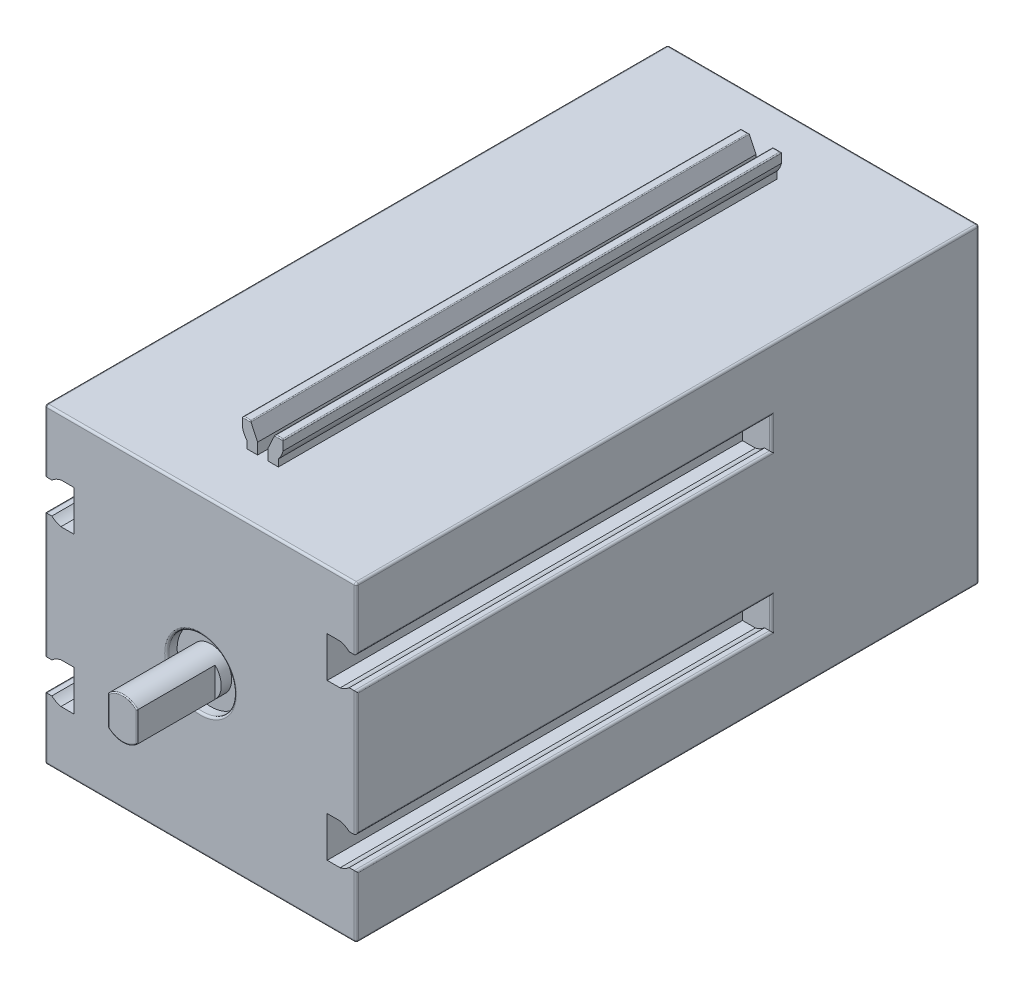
ISO-10303-21;
HEADER;
FILE_DESCRIPTION(('STEP AP214'),'2;1');
FILE_NAME('part.step','',(''),(''),'','','');
FILE_SCHEMA(('AUTOMOTIVE_DESIGN { 1 0 10303 214 1 1 1 1 }'));
ENDSEC;
DATA;
#1=APPLICATION_CONTEXT('core data for automotive mechanical design processes');
#2=APPLICATION_PROTOCOL_DEFINITION('international standard','automotive_design',2000,#1);
#3=PRODUCT_CONTEXT('',#1,'mechanical');
#4=PRODUCT('Part','Part','',(#3));
#5=PRODUCT_RELATED_PRODUCT_CATEGORY('part','',(#4));
#6=PRODUCT_DEFINITION_FORMATION('','',#4);
#7=PRODUCT_DEFINITION_CONTEXT('part definition',#1,'design');
#8=PRODUCT_DEFINITION('design','',#6,#7);
#9=PRODUCT_DEFINITION_SHAPE('','',#8);
#10=(LENGTH_UNIT() NAMED_UNIT(*) SI_UNIT(.MILLI.,.METRE.));
#11=(NAMED_UNIT(*) PLANE_ANGLE_UNIT() SI_UNIT($,.RADIAN.));
#12=(NAMED_UNIT(*) SI_UNIT($,.STERADIAN.) SOLID_ANGLE_UNIT());
#13=UNCERTAINTY_MEASURE_WITH_UNIT(LENGTH_MEASURE(1.E-05),#10,'distance_accuracy_value','');
#14=(GEOMETRIC_REPRESENTATION_CONTEXT(3) GLOBAL_UNCERTAINTY_ASSIGNED_CONTEXT((#13)) GLOBAL_UNIT_ASSIGNED_CONTEXT((#10,
#11,#12)) REPRESENTATION_CONTEXT('',''));
#15=CARTESIAN_POINT('',(0.,0.,0.));
#16=DIRECTION('',(0.,0.,1.));
#17=DIRECTION('',(1.,0.,0.));
#18=AXIS2_PLACEMENT_3D('',#15,#16,#17);
#19=CARTESIAN_POINT('',(0.,15.,-1.));
#20=DIRECTION('',(0.,0.,1.));
#21=DIRECTION('',(1.,0.,0.));
#22=AXIS2_PLACEMENT_3D('',#19,#20,#21);
#23=PLANE('',#22);
#24=CARTESIAN_POINT('',(0.,15.,-1.));
#25=DIRECTION('',(0.,0.,1.));
#26=DIRECTION('',(1.,0.,0.));
#27=AXIS2_PLACEMENT_3D('',#24,#25,#26);
#28=CIRCLE('',#27,3.25);
#29=CARTESIAN_POINT('',(3.25,15.,-1.));
#30=VERTEX_POINT('',#29);
#31=EDGE_CURVE('E807',#30,#30,#28,.T.);
#32=ORIENTED_EDGE('',*,*,#31,.T.);
#33=EDGE_LOOP('',(#32));
#34=FACE_BOUND('',#33,.T.);
#35=CARTESIAN_POINT('',(0.,15.,-1.));
#36=DIRECTION('',(0.,0.,1.));
#37=DIRECTION('',(1.,0.,0.));
#38=AXIS2_PLACEMENT_3D('',#35,#36,#37);
#39=CIRCLE('',#38,2.);
#40=CARTESIAN_POINT('',(2.,15.,-1.));
#41=VERTEX_POINT('',#40);
#42=EDGE_CURVE('E804',#41,#41,#39,.T.);
#43=ORIENTED_EDGE('',*,*,#42,.F.);
#44=EDGE_LOOP('',(#43));
#45=FACE_BOUND('',#44,.T.);
#46=ADVANCED_FACE('F36',(#34,#45),#23,.T.);
#47=CARTESIAN_POINT('',(-15.,30.,-60.));
#48=DIRECTION('',(0.,1.,0.));
#49=DIRECTION('',(0.,0.,1.));
#50=AXIS2_PLACEMENT_3D('',#47,#48,#49);
#51=PLANE('',#50);
#52=DIRECTION('',(0.,0.,1.));
#53=VECTOR('',#52,1.);
#54=CARTESIAN_POINT('',(14.8,30.,-60.));
#55=LINE('',#54,#53);
#56=CARTESIAN_POINT('',(14.8,30.,-0.2));
#57=VERTEX_POINT('',#56);
#58=CARTESIAN_POINT('',(14.8,30.,-59.8));
#59=VERTEX_POINT('',#58);
#60=EDGE_CURVE('E1368',#57,#59,#55,.F.);
#61=ORIENTED_EDGE('',*,*,#60,.T.);
#62=DIRECTION('',(-1.,0.,0.));
#63=VECTOR('',#62,1.);
#64=CARTESIAN_POINT('',(-15.,30.,-59.8));
#65=LINE('',#64,#63);
#66=CARTESIAN_POINT('',(-14.8,30.,-59.8));
#67=VERTEX_POINT('',#66);
#68=EDGE_CURVE('E1373',#59,#67,#65,.T.);
#69=ORIENTED_EDGE('',*,*,#68,.T.);
#70=DIRECTION('',(0.,0.,1.));
#71=VECTOR('',#70,1.);
#72=CARTESIAN_POINT('',(-14.8,30.,-60.));
#73=LINE('',#72,#71);
#74=CARTESIAN_POINT('',(-14.8,30.,-0.2));
#75=VERTEX_POINT('',#74);
#76=EDGE_CURVE('E1370',#67,#75,#73,.T.);
#77=ORIENTED_EDGE('',*,*,#76,.T.);
#78=DIRECTION('',(-1.,0.,0.));
#79=VECTOR('',#78,1.);
#80=CARTESIAN_POINT('',(15.,30.,-0.2));
#81=LINE('',#80,#79);
#82=EDGE_CURVE('E1366',#75,#57,#81,.F.);
#83=ORIENTED_EDGE('',*,*,#82,.T.);
#84=EDGE_LOOP('',(#61,#69,#77,#83));
#85=FACE_BOUND('',#84,.T.);
#86=DIRECTION('',(0.,0.,-1.));
#87=VECTOR('',#86,1.);
#88=CARTESIAN_POINT('',(1.5,30.,-6.));
#89=LINE('',#88,#87);
#90=CARTESIAN_POINT('',(1.5,30.,-6.));
#91=VERTEX_POINT('',#90);
#92=CARTESIAN_POINT('',(1.5,30.,-54.));
#93=VERTEX_POINT('',#92);
#94=EDGE_CURVE('E894',#91,#93,#89,.T.);
#95=ORIENTED_EDGE('',*,*,#94,.F.);
#96=DIRECTION('',(-1.,0.,0.));
#97=VECTOR('',#96,1.);
#98=CARTESIAN_POINT('',(1.5,30.,-6.));
#99=LINE('',#98,#97);
#100=CARTESIAN_POINT('',(0.5,30.,-6.));
#101=VERTEX_POINT('',#100);
#102=EDGE_CURVE('E873',#91,#101,#99,.T.);
#103=ORIENTED_EDGE('',*,*,#102,.T.);
#104=DIRECTION('',(0.,0.,-1.));
#105=VECTOR('',#104,1.);
#106=CARTESIAN_POINT('',(0.5,30.,-6.));
#107=LINE('',#106,#105);
#108=CARTESIAN_POINT('',(0.5,30.,-54.));
#109=VERTEX_POINT('',#108);
#110=EDGE_CURVE('E891',#101,#109,#107,.T.);
#111=ORIENTED_EDGE('',*,*,#110,.T.);
#112=DIRECTION('',(-1.,0.,0.));
#113=VECTOR('',#112,1.);
#114=CARTESIAN_POINT('',(1.5,30.,-54.));
#115=LINE('',#114,#113);
#116=EDGE_CURVE('E862',#93,#109,#115,.T.);
#117=ORIENTED_EDGE('',*,*,#116,.F.);
#118=EDGE_LOOP('',(#95,#103,#111,#117));
#119=FACE_BOUND('',#118,.T.);
#120=DIRECTION('',(0.,0.,-1.));
#121=VECTOR('',#120,1.);
#122=CARTESIAN_POINT('',(-0.5,30.,-6.));
#123=LINE('',#122,#121);
#124=CARTESIAN_POINT('',(-0.5,30.,-6.));
#125=VERTEX_POINT('',#124);
#126=CARTESIAN_POINT('',(-0.5,30.,-54.));
#127=VERTEX_POINT('',#126);
#128=EDGE_CURVE('E851',#125,#127,#123,.T.);
#129=ORIENTED_EDGE('',*,*,#128,.F.);
#130=DIRECTION('',(-1.,0.,0.));
#131=VECTOR('',#130,1.);
#132=CARTESIAN_POINT('',(-0.5,30.,-6.));
#133=LINE('',#132,#131);
#134=CARTESIAN_POINT('',(-1.5,30.,-6.));
#135=VERTEX_POINT('',#134);
#136=EDGE_CURVE('E823',#125,#135,#133,.T.);
#137=ORIENTED_EDGE('',*,*,#136,.T.);
#138=DIRECTION('',(0.,0.,-1.));
#139=VECTOR('',#138,1.);
#140=CARTESIAN_POINT('',(-1.5,30.,-6.));
#141=LINE('',#140,#139);
#142=CARTESIAN_POINT('',(-1.5,30.,-54.));
#143=VERTEX_POINT('',#142);
#144=EDGE_CURVE('E849',#135,#143,#141,.T.);
#145=ORIENTED_EDGE('',*,*,#144,.T.);
#146=DIRECTION('',(-1.,0.,0.));
#147=VECTOR('',#146,1.);
#148=CARTESIAN_POINT('',(-0.5,30.,-54.));
#149=LINE('',#148,#147);
#150=EDGE_CURVE('E841',#127,#143,#149,.T.);
#151=ORIENTED_EDGE('',*,*,#150,.F.);
#152=EDGE_LOOP('',(#129,#137,#145,#151));
#153=FACE_BOUND('',#152,.T.);
#154=ADVANCED_FACE('F1641',(#85,#119,#153),#51,.T.);
#155=CARTESIAN_POINT('',(-15.,30.,0.));
#156=DIRECTION('',(0.,0.,-1.));
#157=DIRECTION('',(-1.,0.,0.));
#158=AXIS2_PLACEMENT_3D('',#155,#156,#157);
#159=PLANE('',#158);
#160=CARTESIAN_POINT('',(0.,15.,0.));
#161=DIRECTION('',(0.,0.,-1.));
#162=DIRECTION('',(-1.,0.,0.));
#163=AXIS2_PLACEMENT_3D('',#160,#161,#162);
#164=CIRCLE('',#163,3.45);
#165=CARTESIAN_POINT('',(-3.45,15.,0.));
#166=VERTEX_POINT('',#165);
#167=EDGE_CURVE('E1315',#166,#166,#164,.T.);
#168=ORIENTED_EDGE('',*,*,#167,.T.);
#169=EDGE_LOOP('',(#168));
#170=FACE_BOUND('',#169,.T.);
#171=DIRECTION('',(-1.,0.,0.));
#172=VECTOR('',#171,1.);
#173=CARTESIAN_POINT('',(-14.3228756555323,21.,0.));
#174=LINE('',#173,#172);
#175=CARTESIAN_POINT('',(-14.3228756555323,21.,0.));
#176=VERTEX_POINT('',#175);
#177=CARTESIAN_POINT('',(-14.8,21.,0.));
#178=VERTEX_POINT('',#177);
#179=EDGE_CURVE('E985',#176,#178,#174,.T.);
#180=ORIENTED_EDGE('',*,*,#179,.T.);
#181=DIRECTION('',(0.,-1.,0.));
#182=VECTOR('',#181,1.);
#183=CARTESIAN_POINT('',(-14.8,9.,0.));
#184=LINE('',#183,#182);
#185=CARTESIAN_POINT('',(-14.8,9.,0.));
#186=VERTEX_POINT('',#185);
#187=EDGE_CURVE('E1327',#178,#186,#184,.T.);
#188=ORIENTED_EDGE('',*,*,#187,.T.);
#189=DIRECTION('',(1.,0.,0.));
#190=VECTOR('',#189,1.);
#191=CARTESIAN_POINT('',(-14.3228756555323,9.,0.));
#192=LINE('',#191,#190);
#193=CARTESIAN_POINT('',(-14.3228756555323,9.,0.));
#194=VERTEX_POINT('',#193);
#195=EDGE_CURVE('E907',#186,#194,#192,.T.);
#196=ORIENTED_EDGE('',*,*,#195,.T.);
#197=CARTESIAN_POINT('',(-13.,7.5,0.));
#198=DIRECTION('',(0.,0.,-1.));
#199=DIRECTION('',(1.,0.,0.));
#200=AXIS2_PLACEMENT_3D('',#197,#198,#199);
#201=CIRCLE('',#200,2.);
#202=CARTESIAN_POINT('',(-13.4444097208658,9.45,0.));
#203=VERTEX_POINT('',#202);
#204=EDGE_CURVE('E893',#194,#203,#201,.T.);
#205=ORIENTED_EDGE('',*,*,#204,.T.);
#206=DIRECTION('',(1.,0.,0.));
#207=VECTOR('',#206,1.);
#208=CARTESIAN_POINT('',(-12.2,9.45,0.));
#209=LINE('',#208,#207);
#210=CARTESIAN_POINT('',(-12.2,9.45,0.));
#211=VERTEX_POINT('',#210);
#212=EDGE_CURVE('E923',#203,#211,#209,.T.);
#213=ORIENTED_EDGE('',*,*,#212,.T.);
#214=DIRECTION('',(0.,-1.,0.));
#215=VECTOR('',#214,1.);
#216=CARTESIAN_POINT('',(-12.2,9.45,0.));
#217=LINE('',#216,#215);
#218=CARTESIAN_POINT('',(-12.2,5.55,0.));
#219=VERTEX_POINT('',#218);
#220=EDGE_CURVE('E926',#211,#219,#217,.T.);
#221=ORIENTED_EDGE('',*,*,#220,.T.);
#222=DIRECTION('',(-1.,0.,0.));
#223=VECTOR('',#222,1.);
#224=CARTESIAN_POINT('',(-12.2,5.55,0.));
#225=LINE('',#224,#223);
#226=CARTESIAN_POINT('',(-13.4444097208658,5.55,0.));
#227=VERTEX_POINT('',#226);
#228=EDGE_CURVE('E929',#219,#227,#225,.T.);
#229=ORIENTED_EDGE('',*,*,#228,.T.);
#230=CARTESIAN_POINT('',(-13.,7.5,0.));
#231=DIRECTION('',(0.,0.,-1.));
#232=DIRECTION('',(1.,0.,0.));
#233=AXIS2_PLACEMENT_3D('',#230,#231,#232);
#234=CIRCLE('',#233,2.);
#235=CARTESIAN_POINT('',(-14.3228756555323,6.,0.));
#236=VERTEX_POINT('',#235);
#237=EDGE_CURVE('E932',#227,#236,#234,.T.);
#238=ORIENTED_EDGE('',*,*,#237,.T.);
#239=DIRECTION('',(-1.,0.,0.));
#240=VECTOR('',#239,1.);
#241=CARTESIAN_POINT('',(-15.,6.,0.));
#242=LINE('',#241,#240);
#243=CARTESIAN_POINT('',(-14.8,6.,0.));
#244=VERTEX_POINT('',#243);
#245=EDGE_CURVE('E935',#236,#244,#242,.T.);
#246=ORIENTED_EDGE('',*,*,#245,.T.);
#247=DIRECTION('',(0.,-1.,0.));
#248=VECTOR('',#247,1.);
#249=CARTESIAN_POINT('',(-14.8,0.,0.));
#250=LINE('',#249,#248);
#251=CARTESIAN_POINT('',(-14.8,0.199999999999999,0.));
#252=VERTEX_POINT('',#251);
#253=EDGE_CURVE('E1325',#244,#252,#250,.T.);
#254=ORIENTED_EDGE('',*,*,#253,.T.);
#255=DIRECTION('',(1.,0.,0.));
#256=VECTOR('',#255,1.);
#257=CARTESIAN_POINT('',(15.,0.199999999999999,0.));
#258=LINE('',#257,#256);
#259=CARTESIAN_POINT('',(14.8,0.199999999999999,0.));
#260=VERTEX_POINT('',#259);
#261=EDGE_CURVE('E1322',#252,#260,#258,.T.);
#262=ORIENTED_EDGE('',*,*,#261,.T.);
#263=DIRECTION('',(0.,1.,0.));
#264=VECTOR('',#263,1.);
#265=CARTESIAN_POINT('',(14.8,6.,0.));
#266=LINE('',#265,#264);
#267=CARTESIAN_POINT('',(14.8,6.,0.));
#268=VERTEX_POINT('',#267);
#269=EDGE_CURVE('E1320',#260,#268,#266,.T.);
#270=ORIENTED_EDGE('',*,*,#269,.T.);
#271=DIRECTION('',(-1.,0.,0.));
#272=VECTOR('',#271,1.);
#273=CARTESIAN_POINT('',(15.,6.,0.));
#274=LINE('',#273,#272);
#275=CARTESIAN_POINT('',(14.3228756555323,6.,0.));
#276=VERTEX_POINT('',#275);
#277=EDGE_CURVE('E1076',#268,#276,#274,.T.);
#278=ORIENTED_EDGE('',*,*,#277,.T.);
#279=CARTESIAN_POINT('',(13.,7.5,0.));
#280=DIRECTION('',(0.,0.,-1.));
#281=DIRECTION('',(-1.,0.,0.));
#282=AXIS2_PLACEMENT_3D('',#279,#280,#281);
#283=CIRCLE('',#282,2.);
#284=CARTESIAN_POINT('',(13.4444097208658,5.55,0.));
#285=VERTEX_POINT('',#284);
#286=EDGE_CURVE('E1078',#276,#285,#283,.T.);
#287=ORIENTED_EDGE('',*,*,#286,.T.);
#288=DIRECTION('',(-1.,0.,0.));
#289=VECTOR('',#288,1.);
#290=CARTESIAN_POINT('',(12.2,5.55,0.));
#291=LINE('',#290,#289);
#292=CARTESIAN_POINT('',(12.2,5.55,0.));
#293=VERTEX_POINT('',#292);
#294=EDGE_CURVE('E1081',#285,#293,#291,.T.);
#295=ORIENTED_EDGE('',*,*,#294,.T.);
#296=DIRECTION('',(0.,1.,0.));
#297=VECTOR('',#296,1.);
#298=CARTESIAN_POINT('',(12.2,9.45,0.));
#299=LINE('',#298,#297);
#300=CARTESIAN_POINT('',(12.2,9.45,0.));
#301=VERTEX_POINT('',#300);
#302=EDGE_CURVE('E1084',#293,#301,#299,.T.);
#303=ORIENTED_EDGE('',*,*,#302,.T.);
#304=DIRECTION('',(1.,0.,0.));
#305=VECTOR('',#304,1.);
#306=CARTESIAN_POINT('',(12.2,9.45,0.));
#307=LINE('',#306,#305);
#308=CARTESIAN_POINT('',(13.4444097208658,9.45,0.));
#309=VERTEX_POINT('',#308);
#310=EDGE_CURVE('E1057',#301,#309,#307,.T.);
#311=ORIENTED_EDGE('',*,*,#310,.T.);
#312=CARTESIAN_POINT('',(13.,7.5,0.));
#313=DIRECTION('',(0.,0.,-1.));
#314=DIRECTION('',(-1.,0.,0.));
#315=AXIS2_PLACEMENT_3D('',#312,#313,#314);
#316=CIRCLE('',#315,2.);
#317=CARTESIAN_POINT('',(14.3228756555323,9.,0.));
#318=VERTEX_POINT('',#317);
#319=EDGE_CURVE('E1052',#309,#318,#316,.T.);
#320=ORIENTED_EDGE('',*,*,#319,.T.);
#321=DIRECTION('',(1.,0.,0.));
#322=VECTOR('',#321,1.);
#323=CARTESIAN_POINT('',(14.3228756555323,9.,0.));
#324=LINE('',#323,#322);
#325=CARTESIAN_POINT('',(14.8,9.,0.));
#326=VERTEX_POINT('',#325);
#327=EDGE_CURVE('E1073',#318,#326,#324,.T.);
#328=ORIENTED_EDGE('',*,*,#327,.T.);
#329=DIRECTION('',(0.,1.,0.));
#330=VECTOR('',#329,1.);
#331=CARTESIAN_POINT('',(14.8,21.,0.));
#332=LINE('',#331,#330);
#333=CARTESIAN_POINT('',(14.8,21.,0.));
#334=VERTEX_POINT('',#333);
#335=EDGE_CURVE('E1318',#326,#334,#332,.T.);
#336=ORIENTED_EDGE('',*,*,#335,.T.);
#337=DIRECTION('',(-1.,0.,0.));
#338=VECTOR('',#337,1.);
#339=CARTESIAN_POINT('',(14.3228756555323,21.,0.));
#340=LINE('',#339,#338);
#341=CARTESIAN_POINT('',(14.3228756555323,21.,0.));
#342=VERTEX_POINT('',#341);
#343=EDGE_CURVE('E1007',#334,#342,#340,.T.);
#344=ORIENTED_EDGE('',*,*,#343,.T.);
#345=CARTESIAN_POINT('',(13.,22.5,0.));
#346=DIRECTION('',(0.,0.,-1.));
#347=DIRECTION('',(1.,0.,0.));
#348=AXIS2_PLACEMENT_3D('',#345,#346,#347);
#349=CIRCLE('',#348,2.);
#350=CARTESIAN_POINT('',(13.4444097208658,20.55,0.));
#351=VERTEX_POINT('',#350);
#352=EDGE_CURVE('E1002',#342,#351,#349,.T.);
#353=ORIENTED_EDGE('',*,*,#352,.T.);
#354=DIRECTION('',(-1.,0.,0.));
#355=VECTOR('',#354,1.);
#356=CARTESIAN_POINT('',(12.2,20.55,0.));
#357=LINE('',#356,#355);
#358=CARTESIAN_POINT('',(12.2,20.55,0.));
#359=VERTEX_POINT('',#358);
#360=EDGE_CURVE('E1023',#351,#359,#357,.T.);
#361=ORIENTED_EDGE('',*,*,#360,.T.);
#362=DIRECTION('',(0.,1.,0.));
#363=VECTOR('',#362,1.);
#364=CARTESIAN_POINT('',(12.2,20.55,0.));
#365=LINE('',#364,#363);
#366=CARTESIAN_POINT('',(12.2,24.45,0.));
#367=VERTEX_POINT('',#366);
#368=EDGE_CURVE('E1026',#359,#367,#365,.T.);
#369=ORIENTED_EDGE('',*,*,#368,.T.);
#370=DIRECTION('',(1.,0.,0.));
#371=VECTOR('',#370,1.);
#372=CARTESIAN_POINT('',(12.2,24.45,0.));
#373=LINE('',#372,#371);
#374=CARTESIAN_POINT('',(13.4444097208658,24.45,0.));
#375=VERTEX_POINT('',#374);
#376=EDGE_CURVE('E1029',#367,#375,#373,.T.);
#377=ORIENTED_EDGE('',*,*,#376,.T.);
#378=CARTESIAN_POINT('',(13.,22.5,0.));
#379=DIRECTION('',(0.,0.,-1.));
#380=DIRECTION('',(1.,0.,0.));
#381=AXIS2_PLACEMENT_3D('',#378,#379,#380);
#382=CIRCLE('',#381,2.);
#383=CARTESIAN_POINT('',(14.3228756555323,24.,0.));
#384=VERTEX_POINT('',#383);
#385=EDGE_CURVE('E1032',#375,#384,#382,.T.);
#386=ORIENTED_EDGE('',*,*,#385,.T.);
#387=DIRECTION('',(1.,0.,0.));
#388=VECTOR('',#387,1.);
#389=CARTESIAN_POINT('',(15.,24.,0.));
#390=LINE('',#389,#388);
#391=CARTESIAN_POINT('',(14.8,24.,0.));
#392=VERTEX_POINT('',#391);
#393=EDGE_CURVE('E1035',#384,#392,#390,.T.);
#394=ORIENTED_EDGE('',*,*,#393,.T.);
#395=DIRECTION('',(0.,1.,0.));
#396=VECTOR('',#395,1.);
#397=CARTESIAN_POINT('',(14.8,30.,0.));
#398=LINE('',#397,#396);
#399=CARTESIAN_POINT('',(14.8,29.8,0.));
#400=VERTEX_POINT('',#399);
#401=EDGE_CURVE('E1311',#392,#400,#398,.T.);
#402=ORIENTED_EDGE('',*,*,#401,.T.);
#403=DIRECTION('',(-1.,0.,0.));
#404=VECTOR('',#403,1.);
#405=CARTESIAN_POINT('',(-15.,29.8,0.));
#406=LINE('',#405,#404);
#407=CARTESIAN_POINT('',(-14.8,29.8,0.));
#408=VERTEX_POINT('',#407);
#409=EDGE_CURVE('E1309',#400,#408,#406,.T.);
#410=ORIENTED_EDGE('',*,*,#409,.T.);
#411=DIRECTION('',(0.,-1.,0.));
#412=VECTOR('',#411,1.);
#413=CARTESIAN_POINT('',(-14.8,24.,0.));
#414=LINE('',#413,#412);
#415=CARTESIAN_POINT('',(-14.8,24.,0.));
#416=VERTEX_POINT('',#415);
#417=EDGE_CURVE('E1313',#408,#416,#414,.T.);
#418=ORIENTED_EDGE('',*,*,#417,.T.);
#419=DIRECTION('',(1.,0.,0.));
#420=VECTOR('',#419,1.);
#421=CARTESIAN_POINT('',(-15.,24.,0.));
#422=LINE('',#421,#420);
#423=CARTESIAN_POINT('',(-14.3228756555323,24.,0.));
#424=VERTEX_POINT('',#423);
#425=EDGE_CURVE('E957',#416,#424,#422,.T.);
#426=ORIENTED_EDGE('',*,*,#425,.T.);
#427=CARTESIAN_POINT('',(-13.,22.5,0.));
#428=DIRECTION('',(0.,0.,-1.));
#429=DIRECTION('',(-1.,0.,0.));
#430=AXIS2_PLACEMENT_3D('',#427,#428,#429);
#431=CIRCLE('',#430,2.);
#432=CARTESIAN_POINT('',(-13.4444097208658,24.45,0.));
#433=VERTEX_POINT('',#432);
#434=EDGE_CURVE('E952',#424,#433,#431,.T.);
#435=ORIENTED_EDGE('',*,*,#434,.T.);
#436=DIRECTION('',(1.,0.,0.));
#437=VECTOR('',#436,1.);
#438=CARTESIAN_POINT('',(-12.2,24.45,0.));
#439=LINE('',#438,#437);
#440=CARTESIAN_POINT('',(-12.2,24.45,0.));
#441=VERTEX_POINT('',#440);
#442=EDGE_CURVE('E973',#433,#441,#439,.T.);
#443=ORIENTED_EDGE('',*,*,#442,.T.);
#444=DIRECTION('',(0.,-1.,0.));
#445=VECTOR('',#444,1.);
#446=CARTESIAN_POINT('',(-12.2,20.55,0.));
#447=LINE('',#446,#445);
#448=CARTESIAN_POINT('',(-12.2,20.55,0.));
#449=VERTEX_POINT('',#448);
#450=EDGE_CURVE('E976',#441,#449,#447,.T.);
#451=ORIENTED_EDGE('',*,*,#450,.T.);
#452=DIRECTION('',(-1.,0.,0.));
#453=VECTOR('',#452,1.);
#454=CARTESIAN_POINT('',(-12.2,20.55,0.));
#455=LINE('',#454,#453);
#456=CARTESIAN_POINT('',(-13.4444097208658,20.55,0.));
#457=VERTEX_POINT('',#456);
#458=EDGE_CURVE('E979',#449,#457,#455,.T.);
#459=ORIENTED_EDGE('',*,*,#458,.T.);
#460=CARTESIAN_POINT('',(-13.,22.5,0.));
#461=DIRECTION('',(0.,0.,-1.));
#462=DIRECTION('',(-1.,0.,0.));
#463=AXIS2_PLACEMENT_3D('',#460,#461,#462);
#464=CIRCLE('',#463,2.);
#465=EDGE_CURVE('E982',#457,#176,#464,.T.);
#466=ORIENTED_EDGE('',*,*,#465,.T.);
#467=EDGE_LOOP('',(#180,#188,#196,#205,#213,#221,#229,#238,#246,#254,#262,#270,#278,#287,#295,
#303,#311,#320,#328,#336,#344,#353,#361,#369,#377,#386,#394,#402,#410,#418,#426,#435,#443,#451,
#459,#466));
#468=FACE_BOUND('',#467,.T.);
#469=ADVANCED_FACE('F1647',(#170,#468),#159,.F.);
#470=CARTESIAN_POINT('',(-15.,0.,-60.));
#471=DIRECTION('',(-1.,0.,0.));
#472=DIRECTION('',(0.,0.,1.));
#473=AXIS2_PLACEMENT_3D('',#470,#471,#472);
#474=PLANE('',#473);
#475=DIRECTION('',(0.,-1.,0.));
#476=VECTOR('',#475,1.);
#477=CARTESIAN_POINT('',(-15.,0.,-59.8));
#478=LINE('',#477,#476);
#479=CARTESIAN_POINT('',(-15.,29.8,-59.8));
#480=VERTEX_POINT('',#479);
#481=CARTESIAN_POINT('',(-15.,0.2,-59.8));
#482=VERTEX_POINT('',#481);
#483=EDGE_CURVE('E1361',#480,#482,#478,.T.);
#484=ORIENTED_EDGE('',*,*,#483,.T.);
#485=DIRECTION('',(0.,0.,1.));
#486=VECTOR('',#485,1.);
#487=CARTESIAN_POINT('',(-15.,0.2,-60.));
#488=LINE('',#487,#486);
#489=CARTESIAN_POINT('',(-15.,0.2,-0.2));
#490=VERTEX_POINT('',#489);
#491=EDGE_CURVE('E1363',#482,#490,#488,.T.);
#492=ORIENTED_EDGE('',*,*,#491,.T.);
#493=DIRECTION('',(0.,-1.,0.));
#494=VECTOR('',#493,1.);
#495=CARTESIAN_POINT('',(-15.,6.,-0.2));
#496=LINE('',#495,#494);
#497=CARTESIAN_POINT('',(-15.,5.8,-0.2));
#498=VERTEX_POINT('',#497);
#499=EDGE_CURVE('E1341',#490,#498,#496,.F.);
#500=ORIENTED_EDGE('',*,*,#499,.T.);
#501=DIRECTION('',(0.,0.,1.));
#502=VECTOR('',#501,1.);
#503=CARTESIAN_POINT('',(-15.,5.8,-60.));
#504=LINE('',#503,#502);
#505=CARTESIAN_POINT('',(-15.,5.8,-40.2));
#506=VERTEX_POINT('',#505);
#507=EDGE_CURVE('E1343',#498,#506,#504,.F.);
#508=ORIENTED_EDGE('',*,*,#507,.T.);
#509=DIRECTION('',(0.,1.,0.));
#510=VECTOR('',#509,1.);
#511=CARTESIAN_POINT('',(-15.,0.,-40.2));
#512=LINE('',#511,#510);
#513=CARTESIAN_POINT('',(-15.,9.2,-40.2));
#514=VERTEX_POINT('',#513);
#515=EDGE_CURVE('E1345',#506,#514,#512,.T.);
#516=ORIENTED_EDGE('',*,*,#515,.T.);
#517=DIRECTION('',(0.,0.,1.));
#518=VECTOR('',#517,1.);
#519=CARTESIAN_POINT('',(-15.,9.2,-60.));
#520=LINE('',#519,#518);
#521=CARTESIAN_POINT('',(-15.,9.2,-0.2));
#522=VERTEX_POINT('',#521);
#523=EDGE_CURVE('E1347',#514,#522,#520,.T.);
#524=ORIENTED_EDGE('',*,*,#523,.T.);
#525=DIRECTION('',(0.,-1.,0.));
#526=VECTOR('',#525,1.);
#527=CARTESIAN_POINT('',(-15.,21.,-0.2));
#528=LINE('',#527,#526);
#529=CARTESIAN_POINT('',(-15.,20.8,-0.2));
#530=VERTEX_POINT('',#529);
#531=EDGE_CURVE('E1349',#522,#530,#528,.F.);
#532=ORIENTED_EDGE('',*,*,#531,.T.);
#533=DIRECTION('',(0.,0.,1.));
#534=VECTOR('',#533,1.);
#535=CARTESIAN_POINT('',(-15.,20.8,-60.));
#536=LINE('',#535,#534);
#537=CARTESIAN_POINT('',(-15.,20.8,-40.2));
#538=VERTEX_POINT('',#537);
#539=EDGE_CURVE('E1351',#530,#538,#536,.F.);
#540=ORIENTED_EDGE('',*,*,#539,.T.);
#541=DIRECTION('',(0.,1.,0.));
#542=VECTOR('',#541,1.);
#543=CARTESIAN_POINT('',(-15.,24.,-40.2));
#544=LINE('',#543,#542);
#545=CARTESIAN_POINT('',(-15.,24.2,-40.2));
#546=VERTEX_POINT('',#545);
#547=EDGE_CURVE('E1353',#538,#546,#544,.T.);
#548=ORIENTED_EDGE('',*,*,#547,.T.);
#549=DIRECTION('',(0.,0.,1.));
#550=VECTOR('',#549,1.);
#551=CARTESIAN_POINT('',(-15.,24.2,-60.));
#552=LINE('',#551,#550);
#553=CARTESIAN_POINT('',(-15.,24.2,-0.2));
#554=VERTEX_POINT('',#553);
#555=EDGE_CURVE('E1355',#546,#554,#552,.T.);
#556=ORIENTED_EDGE('',*,*,#555,.T.);
#557=DIRECTION('',(0.,-1.,0.));
#558=VECTOR('',#557,1.);
#559=CARTESIAN_POINT('',(-15.,30.,-0.2));
#560=LINE('',#559,#558);
#561=CARTESIAN_POINT('',(-15.,29.8,-0.2));
#562=VERTEX_POINT('',#561);
#563=EDGE_CURVE('E1357',#554,#562,#560,.F.);
#564=ORIENTED_EDGE('',*,*,#563,.T.);
#565=DIRECTION('',(0.,0.,1.));
#566=VECTOR('',#565,1.);
#567=CARTESIAN_POINT('',(-15.,29.8,-60.));
#568=LINE('',#567,#566);
#569=EDGE_CURVE('E1359',#562,#480,#568,.F.);
#570=ORIENTED_EDGE('',*,*,#569,.T.);
#571=EDGE_LOOP('',(#484,#492,#500,#508,#516,#524,#532,#540,#548,#556,#564,#570));
#572=FACE_BOUND('',#571,.T.);
#573=ADVANCED_FACE('F1919',(#572),#474,.T.);
#574=CARTESIAN_POINT('',(15.,0.,-60.));
#575=DIRECTION('',(1.,0.,0.));
#576=DIRECTION('',(0.,0.,-1.));
#577=AXIS2_PLACEMENT_3D('',#574,#575,#576);
#578=PLANE('',#577);
#579=DIRECTION('',(0.,1.,0.));
#580=VECTOR('',#579,1.);
#581=CARTESIAN_POINT('',(15.,0.,-59.8));
#582=LINE('',#581,#580);
#583=CARTESIAN_POINT('',(15.,0.2,-59.8));
#584=VERTEX_POINT('',#583);
#585=CARTESIAN_POINT('',(15.,29.8,-59.8));
#586=VERTEX_POINT('',#585);
#587=EDGE_CURVE('E1407',#584,#586,#582,.T.);
#588=ORIENTED_EDGE('',*,*,#587,.T.);
#589=DIRECTION('',(0.,0.,1.));
#590=VECTOR('',#589,1.);
#591=CARTESIAN_POINT('',(15.,29.8,-60.));
#592=LINE('',#591,#590);
#593=CARTESIAN_POINT('',(15.,29.8,-0.2));
#594=VERTEX_POINT('',#593);
#595=EDGE_CURVE('E1409',#586,#594,#592,.T.);
#596=ORIENTED_EDGE('',*,*,#595,.T.);
#597=DIRECTION('',(0.,1.,0.));
#598=VECTOR('',#597,1.);
#599=CARTESIAN_POINT('',(15.,24.,-0.2));
#600=LINE('',#599,#598);
#601=CARTESIAN_POINT('',(15.,24.2,-0.2));
#602=VERTEX_POINT('',#601);
#603=EDGE_CURVE('E1387',#594,#602,#600,.F.);
#604=ORIENTED_EDGE('',*,*,#603,.T.);
#605=DIRECTION('',(0.,0.,1.));
#606=VECTOR('',#605,1.);
#607=CARTESIAN_POINT('',(15.,24.2,-60.));
#608=LINE('',#607,#606);
#609=CARTESIAN_POINT('',(15.,24.2,-40.2));
#610=VERTEX_POINT('',#609);
#611=EDGE_CURVE('E1389',#602,#610,#608,.F.);
#612=ORIENTED_EDGE('',*,*,#611,.T.);
#613=DIRECTION('',(0.,-1.,0.));
#614=VECTOR('',#613,1.);
#615=CARTESIAN_POINT('',(15.,0.,-40.2));
#616=LINE('',#615,#614);
#617=CARTESIAN_POINT('',(15.,20.8,-40.2));
#618=VERTEX_POINT('',#617);
#619=EDGE_CURVE('E1391',#610,#618,#616,.T.);
#620=ORIENTED_EDGE('',*,*,#619,.T.);
#621=DIRECTION('',(0.,0.,1.));
#622=VECTOR('',#621,1.);
#623=CARTESIAN_POINT('',(15.,20.8,-60.));
#624=LINE('',#623,#622);
#625=CARTESIAN_POINT('',(15.,20.8,-0.2));
#626=VERTEX_POINT('',#625);
#627=EDGE_CURVE('E1393',#618,#626,#624,.T.);
#628=ORIENTED_EDGE('',*,*,#627,.T.);
#629=DIRECTION('',(0.,1.,0.));
#630=VECTOR('',#629,1.);
#631=CARTESIAN_POINT('',(15.,9.,-0.2));
#632=LINE('',#631,#630);
#633=CARTESIAN_POINT('',(15.,9.2,-0.2));
#634=VERTEX_POINT('',#633);
#635=EDGE_CURVE('E1395',#626,#634,#632,.F.);
#636=ORIENTED_EDGE('',*,*,#635,.T.);
#637=DIRECTION('',(0.,0.,1.));
#638=VECTOR('',#637,1.);
#639=CARTESIAN_POINT('',(15.,9.2,-60.));
#640=LINE('',#639,#638);
#641=CARTESIAN_POINT('',(15.,9.2,-40.2));
#642=VERTEX_POINT('',#641);
#643=EDGE_CURVE('E1397',#634,#642,#640,.F.);
#644=ORIENTED_EDGE('',*,*,#643,.T.);
#645=DIRECTION('',(0.,-1.,0.));
#646=VECTOR('',#645,1.);
#647=CARTESIAN_POINT('',(15.,6.,-40.2));
#648=LINE('',#647,#646);
#649=CARTESIAN_POINT('',(15.,5.8,-40.2));
#650=VERTEX_POINT('',#649);
#651=EDGE_CURVE('E1399',#642,#650,#648,.T.);
#652=ORIENTED_EDGE('',*,*,#651,.T.);
#653=DIRECTION('',(0.,0.,1.));
#654=VECTOR('',#653,1.);
#655=CARTESIAN_POINT('',(15.,5.8,-60.));
#656=LINE('',#655,#654);
#657=CARTESIAN_POINT('',(15.,5.8,-0.2));
#658=VERTEX_POINT('',#657);
#659=EDGE_CURVE('E1401',#650,#658,#656,.T.);
#660=ORIENTED_EDGE('',*,*,#659,.T.);
#661=DIRECTION('',(0.,1.,0.));
#662=VECTOR('',#661,1.);
#663=CARTESIAN_POINT('',(15.,0.,-0.2));
#664=LINE('',#663,#662);
#665=CARTESIAN_POINT('',(15.,0.2,-0.2));
#666=VERTEX_POINT('',#665);
#667=EDGE_CURVE('E1403',#658,#666,#664,.F.);
#668=ORIENTED_EDGE('',*,*,#667,.T.);
#669=DIRECTION('',(0.,0.,1.));
#670=VECTOR('',#669,1.);
#671=CARTESIAN_POINT('',(15.,0.2,-60.));
#672=LINE('',#671,#670);
#673=EDGE_CURVE('E1405',#666,#584,#672,.F.);
#674=ORIENTED_EDGE('',*,*,#673,.T.);
#675=EDGE_LOOP('',(#588,#596,#604,#612,#620,#628,#636,#644,#652,#660,#668,#674));
#676=FACE_BOUND('',#675,.T.);
#677=ADVANCED_FACE('F1922',(#676),#578,.T.);
#678=CARTESIAN_POINT('',(-15.,0.,-60.));
#679=DIRECTION('',(0.,-1.,0.));
#680=DIRECTION('',(0.,0.,-1.));
#681=AXIS2_PLACEMENT_3D('',#678,#679,#680);
#682=PLANE('',#681);
#683=DIRECTION('',(0.,0.,-1.));
#684=VECTOR('',#683,1.);
#685=CARTESIAN_POINT('',(5.8,0.,-5.5));
#686=LINE('',#685,#684);
#687=CARTESIAN_POINT('',(5.8,0.,-59.8));
#688=VERTEX_POINT('',#687);
#689=CARTESIAN_POINT('',(5.8,0.,-5.3));
#690=VERTEX_POINT('',#689);
#691=EDGE_CURVE('E1292',#688,#690,#686,.F.);
#692=ORIENTED_EDGE('',*,*,#691,.T.);
#693=DIRECTION('',(-1.,0.,0.));
#694=VECTOR('',#693,1.);
#695=CARTESIAN_POINT('',(-15.,0.,-5.3));
#696=LINE('',#695,#694);
#697=CARTESIAN_POINT('',(9.2,0.,-5.3));
#698=VERTEX_POINT('',#697);
#699=EDGE_CURVE('E1294',#690,#698,#696,.F.);
#700=ORIENTED_EDGE('',*,*,#699,.T.);
#701=DIRECTION('',(0.,0.,-1.));
#702=VECTOR('',#701,1.);
#703=CARTESIAN_POINT('',(9.2,0.,-60.));
#704=LINE('',#703,#702);
#705=CARTESIAN_POINT('',(9.2,0.,-59.8));
#706=VERTEX_POINT('',#705);
#707=EDGE_CURVE('E1279',#698,#706,#704,.T.);
#708=ORIENTED_EDGE('',*,*,#707,.T.);
#709=DIRECTION('',(1.,0.,0.));
#710=VECTOR('',#709,1.);
#711=CARTESIAN_POINT('',(-15.,0.,-59.8));
#712=LINE('',#711,#710);
#713=CARTESIAN_POINT('',(14.8,0.,-59.8));
#714=VERTEX_POINT('',#713);
#715=EDGE_CURVE('E1273',#706,#714,#712,.T.);
#716=ORIENTED_EDGE('',*,*,#715,.T.);
#717=DIRECTION('',(0.,0.,1.));
#718=VECTOR('',#717,1.);
#719=CARTESIAN_POINT('',(14.8,0.,-60.));
#720=LINE('',#719,#718);
#721=CARTESIAN_POINT('',(14.8,0.,-0.2));
#722=VERTEX_POINT('',#721);
#723=EDGE_CURVE('E1253',#714,#722,#720,.T.);
#724=ORIENTED_EDGE('',*,*,#723,.T.);
#725=DIRECTION('',(1.,0.,0.));
#726=VECTOR('',#725,1.);
#727=CARTESIAN_POINT('',(-15.,0.,-0.2));
#728=LINE('',#727,#726);
#729=CARTESIAN_POINT('',(-14.8,0.,-0.2));
#730=VERTEX_POINT('',#729);
#731=EDGE_CURVE('E1275',#722,#730,#728,.F.);
#732=ORIENTED_EDGE('',*,*,#731,.T.);
#733=DIRECTION('',(0.,0.,1.));
#734=VECTOR('',#733,1.);
#735=CARTESIAN_POINT('',(-14.8,0.,-60.));
#736=LINE('',#735,#734);
#737=CARTESIAN_POINT('',(-14.8,0.,-59.8));
#738=VERTEX_POINT('',#737);
#739=EDGE_CURVE('E1277',#730,#738,#736,.F.);
#740=ORIENTED_EDGE('',*,*,#739,.T.);
#741=DIRECTION('',(1.,0.,0.));
#742=VECTOR('',#741,1.);
#743=CARTESIAN_POINT('',(-15.,0.,-59.8));
#744=LINE('',#743,#742);
#745=CARTESIAN_POINT('',(-9.2,0.,-59.8));
#746=VERTEX_POINT('',#745);
#747=EDGE_CURVE('E1281',#738,#746,#744,.T.);
#748=ORIENTED_EDGE('',*,*,#747,.T.);
#749=DIRECTION('',(0.,0.,-1.));
#750=VECTOR('',#749,1.);
#751=CARTESIAN_POINT('',(-9.2,0.,-5.5));
#752=LINE('',#751,#750);
#753=CARTESIAN_POINT('',(-9.2,0.,-5.3));
#754=VERTEX_POINT('',#753);
#755=EDGE_CURVE('E1284',#746,#754,#752,.F.);
#756=ORIENTED_EDGE('',*,*,#755,.T.);
#757=DIRECTION('',(-1.,0.,0.));
#758=VECTOR('',#757,1.);
#759=CARTESIAN_POINT('',(-6.,0.,-5.3));
#760=LINE('',#759,#758);
#761=CARTESIAN_POINT('',(-5.8,0.,-5.3));
#762=VERTEX_POINT('',#761);
#763=EDGE_CURVE('E1286',#754,#762,#760,.F.);
#764=ORIENTED_EDGE('',*,*,#763,.T.);
#765=DIRECTION('',(0.,0.,-1.));
#766=VECTOR('',#765,1.);
#767=CARTESIAN_POINT('',(-5.8,0.,-60.));
#768=LINE('',#767,#766);
#769=CARTESIAN_POINT('',(-5.8,0.,-59.8));
#770=VERTEX_POINT('',#769);
#771=EDGE_CURVE('E1288',#762,#770,#768,.T.);
#772=ORIENTED_EDGE('',*,*,#771,.T.);
#773=DIRECTION('',(1.,0.,0.));
#774=VECTOR('',#773,1.);
#775=CARTESIAN_POINT('',(-15.,0.,-59.8));
#776=LINE('',#775,#774);
#777=EDGE_CURVE('E1290',#770,#688,#776,.T.);
#778=ORIENTED_EDGE('',*,*,#777,.T.);
#779=EDGE_LOOP('',(#692,#700,#708,#716,#724,#732,#740,#748,#756,#764,#772,#778));
#780=FACE_BOUND('',#779,.T.);
#781=ADVANCED_FACE('F1916',(#780),#682,.T.);
#782=CARTESIAN_POINT('',(-15.,30.,-60.));
#783=DIRECTION('',(0.,0.,-1.));
#784=DIRECTION('',(-1.,0.,0.));
#785=AXIS2_PLACEMENT_3D('',#782,#783,#784);
#786=PLANE('',#785);
#787=DIRECTION('',(0.,1.,0.));
#788=VECTOR('',#787,1.);
#789=CARTESIAN_POINT('',(6.,0.677124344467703,-60.));
#790=LINE('',#789,#788);
#791=CARTESIAN_POINT('',(6.,0.2,-60.));
#792=VERTEX_POINT('',#791);
#793=CARTESIAN_POINT('',(6.,0.677124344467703,-60.));
#794=VERTEX_POINT('',#793);
#795=EDGE_CURVE('E1186',#792,#794,#790,.T.);
#796=ORIENTED_EDGE('',*,*,#795,.F.);
#797=DIRECTION('',(1.,0.,0.));
#798=VECTOR('',#797,1.);
#799=CARTESIAN_POINT('',(-15.,0.199999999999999,-60.));
#800=LINE('',#799,#798);
#801=CARTESIAN_POINT('',(-6.,0.2,-60.));
#802=VERTEX_POINT('',#801);
#803=EDGE_CURVE('E1307',#792,#802,#800,.F.);
#804=ORIENTED_EDGE('',*,*,#803,.T.);
#805=DIRECTION('',(0.,-1.,0.));
#806=VECTOR('',#805,1.);
#807=CARTESIAN_POINT('',(-6.,0.677124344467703,-60.));
#808=LINE('',#807,#806);
#809=CARTESIAN_POINT('',(-6.,0.677124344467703,-60.));
#810=VERTEX_POINT('',#809);
#811=EDGE_CURVE('E1139',#810,#802,#808,.T.);
#812=ORIENTED_EDGE('',*,*,#811,.F.);
#813=CARTESIAN_POINT('',(-7.5,2.,-60.));
#814=DIRECTION('',(0.,0.,-1.));
#815=DIRECTION('',(1.,0.,0.));
#816=AXIS2_PLACEMENT_3D('',#813,#814,#815);
#817=CIRCLE('',#816,2.);
#818=CARTESIAN_POINT('',(-5.55,1.55559027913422,-60.));
#819=VERTEX_POINT('',#818);
#820=EDGE_CURVE('E1136',#819,#810,#817,.T.);
#821=ORIENTED_EDGE('',*,*,#820,.F.);
#822=DIRECTION('',(0.,-1.,0.));
#823=VECTOR('',#822,1.);
#824=CARTESIAN_POINT('',(-5.55,2.8,-60.));
#825=LINE('',#824,#823);
#826=CARTESIAN_POINT('',(-5.55,2.8,-60.));
#827=VERTEX_POINT('',#826);
#828=EDGE_CURVE('E1133',#827,#819,#825,.T.);
#829=ORIENTED_EDGE('',*,*,#828,.F.);
#830=DIRECTION('',(1.,0.,0.));
#831=VECTOR('',#830,1.);
#832=CARTESIAN_POINT('',(-9.45,2.8,-60.));
#833=LINE('',#832,#831);
#834=CARTESIAN_POINT('',(-9.45,2.8,-60.));
#835=VERTEX_POINT('',#834);
#836=EDGE_CURVE('E1130',#835,#827,#833,.T.);
#837=ORIENTED_EDGE('',*,*,#836,.F.);
#838=DIRECTION('',(0.,1.,0.));
#839=VECTOR('',#838,1.);
#840=CARTESIAN_POINT('',(-9.45,2.8,-60.));
#841=LINE('',#840,#839);
#842=CARTESIAN_POINT('',(-9.45,1.55559027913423,-60.));
#843=VERTEX_POINT('',#842);
#844=EDGE_CURVE('E1127',#843,#835,#841,.T.);
#845=ORIENTED_EDGE('',*,*,#844,.F.);
#846=CARTESIAN_POINT('',(-7.5,2.,-60.));
#847=DIRECTION('',(0.,0.,-1.));
#848=DIRECTION('',(1.,0.,0.));
#849=AXIS2_PLACEMENT_3D('',#846,#847,#848);
#850=CIRCLE('',#849,2.);
#851=CARTESIAN_POINT('',(-9.,0.677124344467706,-60.));
#852=VERTEX_POINT('',#851);
#853=EDGE_CURVE('E1103',#852,#843,#850,.T.);
#854=ORIENTED_EDGE('',*,*,#853,.F.);
#855=DIRECTION('',(0.,1.,0.));
#856=VECTOR('',#855,1.);
#857=CARTESIAN_POINT('',(-9.,0.677124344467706,-60.));
#858=LINE('',#857,#856);
#859=CARTESIAN_POINT('',(-9.,0.2,-60.));
#860=VERTEX_POINT('',#859);
#861=EDGE_CURVE('E1108',#860,#852,#858,.T.);
#862=ORIENTED_EDGE('',*,*,#861,.F.);
#863=DIRECTION('',(1.,0.,0.));
#864=VECTOR('',#863,1.);
#865=CARTESIAN_POINT('',(-15.,0.199999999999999,-60.));
#866=LINE('',#865,#864);
#867=CARTESIAN_POINT('',(-14.8,0.2,-60.));
#868=VERTEX_POINT('',#867);
#869=EDGE_CURVE('E1304',#860,#868,#866,.F.);
#870=ORIENTED_EDGE('',*,*,#869,.T.);
#871=DIRECTION('',(0.,-1.,0.));
#872=VECTOR('',#871,1.);
#873=CARTESIAN_POINT('',(-14.8,30.,-60.));
#874=LINE('',#873,#872);
#875=CARTESIAN_POINT('',(-14.8,29.8,-60.));
#876=VERTEX_POINT('',#875);
#877=EDGE_CURVE('E1300',#868,#876,#874,.F.);
#878=ORIENTED_EDGE('',*,*,#877,.T.);
#879=DIRECTION('',(-1.,0.,0.));
#880=VECTOR('',#879,1.);
#881=CARTESIAN_POINT('',(-15.,29.8,-60.));
#882=LINE('',#881,#880);
#883=CARTESIAN_POINT('',(14.8,29.8,-60.));
#884=VERTEX_POINT('',#883);
#885=EDGE_CURVE('E1296',#876,#884,#882,.F.);
#886=ORIENTED_EDGE('',*,*,#885,.T.);
#887=DIRECTION('',(0.,1.,0.));
#888=VECTOR('',#887,1.);
#889=CARTESIAN_POINT('',(14.8,30.,-60.));
#890=LINE('',#889,#888);
#891=CARTESIAN_POINT('',(14.8,0.2,-60.));
#892=VERTEX_POINT('',#891);
#893=EDGE_CURVE('E1298',#884,#892,#890,.F.);
#894=ORIENTED_EDGE('',*,*,#893,.T.);
#895=DIRECTION('',(1.,0.,0.));
#896=VECTOR('',#895,1.);
#897=CARTESIAN_POINT('',(-15.,0.199999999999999,-60.));
#898=LINE('',#897,#896);
#899=CARTESIAN_POINT('',(9.,0.2,-60.));
#900=VERTEX_POINT('',#899);
#901=EDGE_CURVE('E1302',#892,#900,#898,.F.);
#902=ORIENTED_EDGE('',*,*,#901,.T.);
#903=DIRECTION('',(0.,-1.,0.));
#904=VECTOR('',#903,1.);
#905=CARTESIAN_POINT('',(9.,0.677124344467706,-60.));
#906=LINE('',#905,#904);
#907=CARTESIAN_POINT('',(9.,0.677124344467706,-60.));
#908=VERTEX_POINT('',#907);
#909=EDGE_CURVE('E1183',#908,#900,#906,.T.);
#910=ORIENTED_EDGE('',*,*,#909,.F.);
#911=CARTESIAN_POINT('',(7.5,2.,-60.));
#912=DIRECTION('',(0.,0.,-1.));
#913=DIRECTION('',(-1.,0.,0.));
#914=AXIS2_PLACEMENT_3D('',#911,#912,#913);
#915=CIRCLE('',#914,2.);
#916=CARTESIAN_POINT('',(9.45,1.55559027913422,-60.));
#917=VERTEX_POINT('',#916);
#918=EDGE_CURVE('E1180',#917,#908,#915,.T.);
#919=ORIENTED_EDGE('',*,*,#918,.F.);
#920=DIRECTION('',(0.,-1.,0.));
#921=VECTOR('',#920,1.);
#922=CARTESIAN_POINT('',(9.45,2.8,-60.));
#923=LINE('',#922,#921);
#924=CARTESIAN_POINT('',(9.45,2.8,-60.));
#925=VERTEX_POINT('',#924);
#926=EDGE_CURVE('E1146',#925,#917,#923,.T.);
#927=ORIENTED_EDGE('',*,*,#926,.F.);
#928=DIRECTION('',(1.,0.,0.));
#929=VECTOR('',#928,1.);
#930=CARTESIAN_POINT('',(9.45,2.8,-60.));
#931=LINE('',#930,#929);
#932=CARTESIAN_POINT('',(5.55,2.8,-60.));
#933=VERTEX_POINT('',#932);
#934=EDGE_CURVE('E1161',#933,#925,#931,.T.);
#935=ORIENTED_EDGE('',*,*,#934,.F.);
#936=DIRECTION('',(0.,1.,0.));
#937=VECTOR('',#936,1.);
#938=CARTESIAN_POINT('',(5.55,2.8,-60.));
#939=LINE('',#938,#937);
#940=CARTESIAN_POINT('',(5.55,1.55559027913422,-60.));
#941=VERTEX_POINT('',#940);
#942=EDGE_CURVE('E1191',#941,#933,#939,.T.);
#943=ORIENTED_EDGE('',*,*,#942,.F.);
#944=CARTESIAN_POINT('',(7.5,2.,-60.));
#945=DIRECTION('',(0.,0.,-1.));
#946=DIRECTION('',(-1.,0.,0.));
#947=AXIS2_PLACEMENT_3D('',#944,#945,#946);
#948=CIRCLE('',#947,2.);
#949=EDGE_CURVE('E1188',#794,#941,#948,.T.);
#950=ORIENTED_EDGE('',*,*,#949,.F.);
#951=EDGE_LOOP('',(#796,#804,#812,#821,#829,#837,#845,#854,#862,#870,#878,#886,#894,#902,#910,
#919,#927,#935,#943,#950));
#952=FACE_BOUND('',#951,.T.);
#953=DIRECTION('',(0.,-1.,0.));
#954=VECTOR('',#953,1.);
#955=CARTESIAN_POINT('',(4.,27.,-60.));
#956=LINE('',#955,#954);
#957=CARTESIAN_POINT('',(4.,27.,-60.));
#958=VERTEX_POINT('',#957);
#959=CARTESIAN_POINT('',(4.,24.,-60.));
#960=VERTEX_POINT('',#959);
#961=EDGE_CURVE('E702',#958,#960,#956,.T.);
#962=ORIENTED_EDGE('',*,*,#961,.F.);
#963=DIRECTION('',(1.,0.,0.));
#964=VECTOR('',#963,1.);
#965=CARTESIAN_POINT('',(4.,27.,-60.));
#966=LINE('',#965,#964);
#967=CARTESIAN_POINT('',(-4.,27.,-60.));
#968=VERTEX_POINT('',#967);
#969=EDGE_CURVE('E720',#968,#958,#966,.T.);
#970=ORIENTED_EDGE('',*,*,#969,.F.);
#971=DIRECTION('',(0.,1.,0.));
#972=VECTOR('',#971,1.);
#973=CARTESIAN_POINT('',(-4.,27.,-60.));
#974=LINE('',#973,#972);
#975=CARTESIAN_POINT('',(-4.,24.,-60.));
#976=VERTEX_POINT('',#975);
#977=EDGE_CURVE('E723',#976,#968,#974,.T.);
#978=ORIENTED_EDGE('',*,*,#977,.F.);
#979=DIRECTION('',(-1.,0.,0.));
#980=VECTOR('',#979,1.);
#981=CARTESIAN_POINT('',(-2.5,24.,-60.));
#982=LINE('',#981,#980);
#983=CARTESIAN_POINT('',(-2.5,24.,-60.));
#984=VERTEX_POINT('',#983);
#985=EDGE_CURVE('E752',#984,#976,#982,.T.);
#986=ORIENTED_EDGE('',*,*,#985,.F.);
#987=DIRECTION('',(0.,-1.,0.));
#988=VECTOR('',#987,1.);
#989=CARTESIAN_POINT('',(-2.5,24.,-60.));
#990=LINE('',#989,#988);
#991=CARTESIAN_POINT('',(-2.5,25.,-60.));
#992=VERTEX_POINT('',#991);
#993=EDGE_CURVE('E749',#992,#984,#990,.T.);
#994=ORIENTED_EDGE('',*,*,#993,.F.);
#995=DIRECTION('',(-1.,0.,0.));
#996=VECTOR('',#995,1.);
#997=CARTESIAN_POINT('',(2.5,25.,-60.));
#998=LINE('',#997,#996);
#999=CARTESIAN_POINT('',(2.5,25.,-60.));
#1000=VERTEX_POINT('',#999);
#1001=EDGE_CURVE('E746',#1000,#992,#998,.T.);
#1002=ORIENTED_EDGE('',*,*,#1001,.F.);
#1003=DIRECTION('',(0.,1.,0.));
#1004=VECTOR('',#1003,1.);
#1005=CARTESIAN_POINT('',(2.5,24.,-60.));
#1006=LINE('',#1005,#1004);
#1007=CARTESIAN_POINT('',(2.5,24.,-60.));
#1008=VERTEX_POINT('',#1007);
#1009=EDGE_CURVE('E743',#1008,#1000,#1006,.T.);
#1010=ORIENTED_EDGE('',*,*,#1009,.F.);
#1011=DIRECTION('',(-1.,0.,0.));
#1012=VECTOR('',#1011,1.);
#1013=CARTESIAN_POINT('',(4.,24.,-60.));
#1014=LINE('',#1013,#1012);
#1015=EDGE_CURVE('E740',#960,#1008,#1014,.T.);
#1016=ORIENTED_EDGE('',*,*,#1015,.F.);
#1017=EDGE_LOOP('',(#962,#970,#978,#986,#994,#1002,#1010,#1016));
#1018=FACE_BOUND('',#1017,.T.);
#1019=CARTESIAN_POINT('',(-10.5,25.5,-60.));
#1020=DIRECTION('',(0.,0.,-1.));
#1021=DIRECTION('',(-1.,0.,0.));
#1022=AXIS2_PLACEMENT_3D('',#1019,#1020,#1021);
#1023=CIRCLE('',#1022,1.25);
#1024=CARTESIAN_POINT('',(-11.75,25.5,-60.));
#1025=VERTEX_POINT('',#1024);
#1026=EDGE_CURVE('E759',#1025,#1025,#1023,.T.);
#1027=ORIENTED_EDGE('',*,*,#1026,.F.);
#1028=EDGE_LOOP('',(#1027));
#1029=FACE_BOUND('',#1028,.T.);
#1030=CARTESIAN_POINT('',(10.5,25.5,-60.));
#1031=DIRECTION('',(0.,0.,-1.));
#1032=DIRECTION('',(-1.,0.,0.));
#1033=AXIS2_PLACEMENT_3D('',#1030,#1031,#1032);
#1034=CIRCLE('',#1033,1.25);
#1035=CARTESIAN_POINT('',(9.25,25.5,-60.));
#1036=VERTEX_POINT('',#1035);
#1037=EDGE_CURVE('E774',#1036,#1036,#1034,.T.);
#1038=ORIENTED_EDGE('',*,*,#1037,.F.);
#1039=EDGE_LOOP('',(#1038));
#1040=FACE_BOUND('',#1039,.T.);
#1041=ADVANCED_FACE('F1912',(#952,#1018,#1029,#1040),#786,.T.);
#1042=CARTESIAN_POINT('',(9.45,2.8,-5.5));
#1043=DIRECTION('',(1.,0.,0.));
#1044=DIRECTION('',(0.,0.,-1.));
#1045=AXIS2_PLACEMENT_3D('',#1042,#1043,#1044);
#1046=PLANE('',#1045);
#1047=ORIENTED_EDGE('',*,*,#926,.T.);
#1048=DIRECTION('',(0.,0.,-1.));
#1049=VECTOR('',#1048,1.);
#1050=CARTESIAN_POINT('',(9.45,1.55559027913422,-5.5));
#1051=LINE('',#1050,#1049);
#1052=CARTESIAN_POINT('',(9.45,1.55559027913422,-5.5));
#1053=VERTEX_POINT('',#1052);
#1054=EDGE_CURVE('E1178',#1053,#917,#1051,.T.);
#1055=ORIENTED_EDGE('',*,*,#1054,.F.);
#1056=DIRECTION('',(0.,-1.,0.));
#1057=VECTOR('',#1056,1.);
#1058=CARTESIAN_POINT('',(9.45,2.8,-5.5));
#1059=LINE('',#1058,#1057);
#1060=CARTESIAN_POINT('',(9.45,2.8,-5.5));
#1061=VERTEX_POINT('',#1060);
#1062=EDGE_CURVE('E1157',#1061,#1053,#1059,.T.);
#1063=ORIENTED_EDGE('',*,*,#1062,.F.);
#1064=DIRECTION('',(0.,0.,-1.));
#1065=VECTOR('',#1064,1.);
#1066=CARTESIAN_POINT('',(9.45,2.8,-5.5));
#1067=LINE('',#1066,#1065);
#1068=EDGE_CURVE('E1196',#1061,#925,#1067,.T.);
#1069=ORIENTED_EDGE('',*,*,#1068,.T.);
#1070=EDGE_LOOP('',(#1047,#1055,#1063,#1069));
#1071=FACE_BOUND('',#1070,.T.);
#1072=ADVANCED_FACE('F1890',(#1071),#1046,.F.);
#1073=CARTESIAN_POINT('',(9.45,2.8,-5.5));
#1074=DIRECTION('',(0.,1.,0.));
#1075=DIRECTION('',(0.,0.,1.));
#1076=AXIS2_PLACEMENT_3D('',#1073,#1074,#1075);
#1077=PLANE('',#1076);
#1078=ORIENTED_EDGE('',*,*,#934,.T.);
#1079=ORIENTED_EDGE('',*,*,#1068,.F.);
#1080=DIRECTION('',(1.,0.,0.));
#1081=VECTOR('',#1080,1.);
#1082=CARTESIAN_POINT('',(9.45,2.8,-5.5));
#1083=LINE('',#1082,#1081);
#1084=CARTESIAN_POINT('',(5.55,2.8,-5.5));
#1085=VERTEX_POINT('',#1084);
#1086=EDGE_CURVE('E1175',#1085,#1061,#1083,.T.);
#1087=ORIENTED_EDGE('',*,*,#1086,.F.);
#1088=DIRECTION('',(0.,0.,-1.));
#1089=VECTOR('',#1088,1.);
#1090=CARTESIAN_POINT('',(5.55,2.8,-5.5));
#1091=LINE('',#1090,#1089);
#1092=EDGE_CURVE('E1199',#1085,#933,#1091,.T.);
#1093=ORIENTED_EDGE('',*,*,#1092,.T.);
#1094=EDGE_LOOP('',(#1078,#1079,#1087,#1093));
#1095=FACE_BOUND('',#1094,.T.);
#1096=ADVANCED_FACE('F1886',(#1095),#1077,.F.);
#1097=CARTESIAN_POINT('',(5.55,2.8,-5.5));
#1098=DIRECTION('',(-1.,0.,0.));
#1099=DIRECTION('',(0.,0.,1.));
#1100=AXIS2_PLACEMENT_3D('',#1097,#1098,#1099);
#1101=PLANE('',#1100);
#1102=ORIENTED_EDGE('',*,*,#942,.T.);
#1103=ORIENTED_EDGE('',*,*,#1092,.F.);
#1104=DIRECTION('',(0.,1.,0.));
#1105=VECTOR('',#1104,1.);
#1106=CARTESIAN_POINT('',(5.55,2.8,-5.5));
#1107=LINE('',#1106,#1105);
#1108=CARTESIAN_POINT('',(5.55,1.55559027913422,-5.5));
#1109=VERTEX_POINT('',#1108);
#1110=EDGE_CURVE('E1172',#1109,#1085,#1107,.T.);
#1111=ORIENTED_EDGE('',*,*,#1110,.F.);
#1112=DIRECTION('',(0.,0.,-1.));
#1113=VECTOR('',#1112,1.);
#1114=CARTESIAN_POINT('',(5.55,1.55559027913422,-5.5));
#1115=LINE('',#1114,#1113);
#1116=EDGE_CURVE('E1201',#1109,#941,#1115,.T.);
#1117=ORIENTED_EDGE('',*,*,#1116,.T.);
#1118=EDGE_LOOP('',(#1102,#1103,#1111,#1117));
#1119=FACE_BOUND('',#1118,.T.);
#1120=ADVANCED_FACE('F1889',(#1119),#1101,.F.);
#1121=CARTESIAN_POINT('',(7.5,2.,-5.5));
#1122=DIRECTION('',(0.,0.,-1.));
#1123=DIRECTION('',(-1.,0.,0.));
#1124=AXIS2_PLACEMENT_3D('',#1121,#1122,#1123);
#1125=CYLINDRICAL_SURFACE('',#1124,2.);
#1126=ORIENTED_EDGE('',*,*,#949,.T.);
#1127=ORIENTED_EDGE('',*,*,#1116,.F.);
#1128=CARTESIAN_POINT('',(7.5,2.,-5.5));
#1129=DIRECTION('',(0.,0.,-1.));
#1130=DIRECTION('',(-1.,0.,0.));
#1131=AXIS2_PLACEMENT_3D('',#1128,#1129,#1130);
#1132=CIRCLE('',#1131,2.);
#1133=CARTESIAN_POINT('',(6.,0.677124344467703,-5.5));
#1134=VERTEX_POINT('',#1133);
#1135=EDGE_CURVE('E1169',#1134,#1109,#1132,.T.);
#1136=ORIENTED_EDGE('',*,*,#1135,.F.);
#1137=DIRECTION('',(0.,0.,-1.));
#1138=VECTOR('',#1137,1.);
#1139=CARTESIAN_POINT('',(6.,0.677124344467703,-5.5));
#1140=LINE('',#1139,#1138);
#1141=EDGE_CURVE('E1203',#1134,#794,#1140,.T.);
#1142=ORIENTED_EDGE('',*,*,#1141,.T.);
#1143=EDGE_LOOP('',(#1126,#1127,#1136,#1142));
#1144=FACE_BOUND('',#1143,.T.);
#1145=ADVANCED_FACE('F1894',(#1144),#1125,.F.);
#1146=CARTESIAN_POINT('',(6.,0.677124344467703,-5.5));
#1147=DIRECTION('',(-1.,0.,0.));
#1148=DIRECTION('',(0.,0.,1.));
#1149=AXIS2_PLACEMENT_3D('',#1146,#1147,#1148);
#1150=PLANE('',#1149);
#1151=DIRECTION('',(0.,1.,0.));
#1152=VECTOR('',#1151,1.);
#1153=CARTESIAN_POINT('',(6.,0.677124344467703,-5.5));
#1154=LINE('',#1153,#1152);
#1155=CARTESIAN_POINT('',(6.,0.2,-5.5));
#1156=VERTEX_POINT('',#1155);
#1157=EDGE_CURVE('E1167',#1156,#1134,#1154,.T.);
#1158=ORIENTED_EDGE('',*,*,#1157,.F.);
#1159=DIRECTION('',(0.,0.,-1.));
#1160=VECTOR('',#1159,1.);
#1161=CARTESIAN_POINT('',(6.,0.2,-60.));
#1162=LINE('',#1161,#1160);
#1163=EDGE_CURVE('E1333',#1156,#792,#1162,.T.);
#1164=ORIENTED_EDGE('',*,*,#1163,.T.);
#1165=ORIENTED_EDGE('',*,*,#795,.T.);
#1166=ORIENTED_EDGE('',*,*,#1141,.F.);
#1167=EDGE_LOOP('',(#1158,#1164,#1165,#1166));
#1168=FACE_BOUND('',#1167,.T.);
#1169=ADVANCED_FACE('F1898',(#1168),#1150,.F.);
#1170=CARTESIAN_POINT('',(9.,0.677124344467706,-5.5));
#1171=DIRECTION('',(1.,0.,0.));
#1172=DIRECTION('',(0.,0.,-1.));
#1173=AXIS2_PLACEMENT_3D('',#1170,#1171,#1172);
#1174=PLANE('',#1173);
#1175=ORIENTED_EDGE('',*,*,#909,.T.);
#1176=DIRECTION('',(0.,0.,-1.));
#1177=VECTOR('',#1176,1.);
#1178=CARTESIAN_POINT('',(9.,0.2,-5.5));
#1179=LINE('',#1178,#1177);
#1180=CARTESIAN_POINT('',(9.,0.2,-5.5));
#1181=VERTEX_POINT('',#1180);
#1182=EDGE_CURVE('E1329',#900,#1181,#1179,.F.);
#1183=ORIENTED_EDGE('',*,*,#1182,.T.);
#1184=DIRECTION('',(0.,-1.,0.));
#1185=VECTOR('',#1184,1.);
#1186=CARTESIAN_POINT('',(9.,0.677124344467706,-5.5));
#1187=LINE('',#1186,#1185);
#1188=CARTESIAN_POINT('',(9.,0.677124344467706,-5.5));
#1189=VERTEX_POINT('',#1188);
#1190=EDGE_CURVE('E1164',#1189,#1181,#1187,.T.);
#1191=ORIENTED_EDGE('',*,*,#1190,.F.);
#1192=DIRECTION('',(0.,0.,-1.));
#1193=VECTOR('',#1192,1.);
#1194=CARTESIAN_POINT('',(9.,0.677124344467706,-5.5));
#1195=LINE('',#1194,#1193);
#1196=EDGE_CURVE('E1206',#1189,#908,#1195,.T.);
#1197=ORIENTED_EDGE('',*,*,#1196,.T.);
#1198=EDGE_LOOP('',(#1175,#1183,#1191,#1197));
#1199=FACE_BOUND('',#1198,.T.);
#1200=ADVANCED_FACE('F1902',(#1199),#1174,.F.);
#1201=CARTESIAN_POINT('',(7.5,2.,-5.5));
#1202=DIRECTION('',(0.,0.,-1.));
#1203=DIRECTION('',(-1.,0.,0.));
#1204=AXIS2_PLACEMENT_3D('',#1201,#1202,#1203);
#1205=CYLINDRICAL_SURFACE('',#1204,2.);
#1206=ORIENTED_EDGE('',*,*,#918,.T.);
#1207=ORIENTED_EDGE('',*,*,#1196,.F.);
#1208=CARTESIAN_POINT('',(7.5,2.,-5.5));
#1209=DIRECTION('',(0.,0.,-1.));
#1210=DIRECTION('',(-1.,0.,0.));
#1211=AXIS2_PLACEMENT_3D('',#1208,#1209,#1210);
#1212=CIRCLE('',#1211,2.);
#1213=EDGE_CURVE('E1160',#1053,#1189,#1212,.T.);
#1214=ORIENTED_EDGE('',*,*,#1213,.F.);
#1215=ORIENTED_EDGE('',*,*,#1054,.T.);
#1216=EDGE_LOOP('',(#1206,#1207,#1214,#1215));
#1217=FACE_BOUND('',#1216,.T.);
#1218=ADVANCED_FACE('F1884',(#1217),#1205,.F.);
#1219=CARTESIAN_POINT('',(7.5,2.,-5.5));
#1220=DIRECTION('',(0.,0.,-1.));
#1221=DIRECTION('',(-1.,0.,0.));
#1222=AXIS2_PLACEMENT_3D('',#1219,#1220,#1221);
#1223=PLANE('',#1222);
#1224=ORIENTED_EDGE('',*,*,#1190,.T.);
#1225=DIRECTION('',(-1.,0.,0.));
#1226=VECTOR('',#1225,1.);
#1227=CARTESIAN_POINT('',(7.5,0.2,-5.5));
#1228=LINE('',#1227,#1226);
#1229=EDGE_CURVE('E1331',#1181,#1156,#1228,.T.);
#1230=ORIENTED_EDGE('',*,*,#1229,.T.);
#1231=ORIENTED_EDGE('',*,*,#1157,.T.);
#1232=ORIENTED_EDGE('',*,*,#1135,.T.);
#1233=ORIENTED_EDGE('',*,*,#1110,.T.);
#1234=ORIENTED_EDGE('',*,*,#1086,.T.);
#1235=ORIENTED_EDGE('',*,*,#1062,.T.);
#1236=ORIENTED_EDGE('',*,*,#1213,.T.);
#1237=EDGE_LOOP('',(#1224,#1230,#1231,#1232,#1233,#1234,#1235,#1236));
#1238=FACE_BOUND('',#1237,.T.);
#1239=ADVANCED_FACE('F1880',(#1238),#1223,.T.);
#1240=CARTESIAN_POINT('',(-7.5,2.,-5.5));
#1241=DIRECTION('',(0.,0.,-1.));
#1242=DIRECTION('',(-1.,0.,0.));
#1243=AXIS2_PLACEMENT_3D('',#1240,#1241,#1242);
#1244=CYLINDRICAL_SURFACE('',#1243,2.);
#1245=ORIENTED_EDGE('',*,*,#853,.T.);
#1246=DIRECTION('',(0.,0.,-1.));
#1247=VECTOR('',#1246,1.);
#1248=CARTESIAN_POINT('',(-9.45,1.55559027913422,-5.5));
#1249=LINE('',#1248,#1247);
#1250=CARTESIAN_POINT('',(-9.45,1.55559027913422,-5.5));
#1251=VERTEX_POINT('',#1250);
#1252=EDGE_CURVE('E1125',#1251,#843,#1249,.T.);
#1253=ORIENTED_EDGE('',*,*,#1252,.F.);
#1254=CARTESIAN_POINT('',(-7.5,2.,-5.5));
#1255=DIRECTION('',(0.,0.,-1.));
#1256=DIRECTION('',(1.,0.,0.));
#1257=AXIS2_PLACEMENT_3D('',#1254,#1255,#1256);
#1258=CIRCLE('',#1257,2.);
#1259=CARTESIAN_POINT('',(-9.,0.677124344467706,-5.5));
#1260=VERTEX_POINT('',#1259);
#1261=EDGE_CURVE('E1104',#1260,#1251,#1258,.T.);
#1262=ORIENTED_EDGE('',*,*,#1261,.F.);
#1263=DIRECTION('',(0.,0.,-1.));
#1264=VECTOR('',#1263,1.);
#1265=CARTESIAN_POINT('',(-9.,0.677124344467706,-5.5));
#1266=LINE('',#1265,#1264);
#1267=EDGE_CURVE('E1143',#1260,#852,#1266,.T.);
#1268=ORIENTED_EDGE('',*,*,#1267,.T.);
#1269=EDGE_LOOP('',(#1245,#1253,#1262,#1268));
#1270=FACE_BOUND('',#1269,.T.);
#1271=ADVANCED_FACE('F1858',(#1270),#1244,.F.);
#1272=CARTESIAN_POINT('',(-9.,0.677124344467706,-5.5));
#1273=DIRECTION('',(-1.,0.,0.));
#1274=DIRECTION('',(0.,0.,1.));
#1275=AXIS2_PLACEMENT_3D('',#1272,#1273,#1274);
#1276=PLANE('',#1275);
#1277=DIRECTION('',(0.,1.,0.));
#1278=VECTOR('',#1277,1.);
#1279=CARTESIAN_POINT('',(-9.,0.677124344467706,-5.5));
#1280=LINE('',#1279,#1278);
#1281=CARTESIAN_POINT('',(-9.,0.2,-5.5));
#1282=VERTEX_POINT('',#1281);
#1283=EDGE_CURVE('E1123',#1282,#1260,#1280,.T.);
#1284=ORIENTED_EDGE('',*,*,#1283,.F.);
#1285=DIRECTION('',(0.,0.,-1.));
#1286=VECTOR('',#1285,1.);
#1287=CARTESIAN_POINT('',(-9.,0.2,-60.));
#1288=LINE('',#1287,#1286);
#1289=EDGE_CURVE('E1339',#1282,#860,#1288,.T.);
#1290=ORIENTED_EDGE('',*,*,#1289,.T.);
#1291=ORIENTED_EDGE('',*,*,#861,.T.);
#1292=ORIENTED_EDGE('',*,*,#1267,.F.);
#1293=EDGE_LOOP('',(#1284,#1290,#1291,#1292));
#1294=FACE_BOUND('',#1293,.T.);
#1295=ADVANCED_FACE('F1854',(#1294),#1276,.F.);
#1296=CARTESIAN_POINT('',(-6.,0.677124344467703,-5.5));
#1297=DIRECTION('',(1.,0.,0.));
#1298=DIRECTION('',(0.,0.,-1.));
#1299=AXIS2_PLACEMENT_3D('',#1296,#1297,#1298);
#1300=PLANE('',#1299);
#1301=ORIENTED_EDGE('',*,*,#811,.T.);
#1302=DIRECTION('',(0.,0.,-1.));
#1303=VECTOR('',#1302,1.);
#1304=CARTESIAN_POINT('',(-6.,0.2,-5.5));
#1305=LINE('',#1304,#1303);
#1306=CARTESIAN_POINT('',(-6.,0.2,-5.5));
#1307=VERTEX_POINT('',#1306);
#1308=EDGE_CURVE('E1335',#802,#1307,#1305,.F.);
#1309=ORIENTED_EDGE('',*,*,#1308,.T.);
#1310=DIRECTION('',(0.,-1.,0.));
#1311=VECTOR('',#1310,1.);
#1312=CARTESIAN_POINT('',(-6.,0.677124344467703,-5.5));
#1313=LINE('',#1312,#1311);
#1314=CARTESIAN_POINT('',(-6.,0.677124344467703,-5.5));
#1315=VERTEX_POINT('',#1314);
#1316=EDGE_CURVE('E1120',#1315,#1307,#1313,.T.);
#1317=ORIENTED_EDGE('',*,*,#1316,.F.);
#1318=DIRECTION('',(0.,0.,-1.));
#1319=VECTOR('',#1318,1.);
#1320=CARTESIAN_POINT('',(-6.,0.677124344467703,-5.5));
#1321=LINE('',#1320,#1319);
#1322=EDGE_CURVE('E1147',#1315,#810,#1321,.T.);
#1323=ORIENTED_EDGE('',*,*,#1322,.T.);
#1324=EDGE_LOOP('',(#1301,#1309,#1317,#1323));
#1325=FACE_BOUND('',#1324,.T.);
#1326=ADVANCED_FACE('F1857',(#1325),#1300,.F.);
#1327=CARTESIAN_POINT('',(-7.5,2.,-5.5));
#1328=DIRECTION('',(0.,0.,-1.));
#1329=DIRECTION('',(-1.,0.,0.));
#1330=AXIS2_PLACEMENT_3D('',#1327,#1328,#1329);
#1331=CYLINDRICAL_SURFACE('',#1330,2.);
#1332=ORIENTED_EDGE('',*,*,#820,.T.);
#1333=ORIENTED_EDGE('',*,*,#1322,.F.);
#1334=CARTESIAN_POINT('',(-7.5,2.,-5.5));
#1335=DIRECTION('',(0.,0.,-1.));
#1336=DIRECTION('',(1.,0.,0.));
#1337=AXIS2_PLACEMENT_3D('',#1334,#1335,#1336);
#1338=CIRCLE('',#1337,2.);
#1339=CARTESIAN_POINT('',(-5.55,1.55559027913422,-5.5));
#1340=VERTEX_POINT('',#1339);
#1341=EDGE_CURVE('E1117',#1340,#1315,#1338,.T.);
#1342=ORIENTED_EDGE('',*,*,#1341,.F.);
#1343=DIRECTION('',(0.,0.,-1.));
#1344=VECTOR('',#1343,1.);
#1345=CARTESIAN_POINT('',(-5.55,1.55559027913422,-5.5));
#1346=LINE('',#1345,#1344);
#1347=EDGE_CURVE('E1149',#1340,#819,#1346,.T.);
#1348=ORIENTED_EDGE('',*,*,#1347,.T.);
#1349=EDGE_LOOP('',(#1332,#1333,#1342,#1348));
#1350=FACE_BOUND('',#1349,.T.);
#1351=ADVANCED_FACE('F1862',(#1350),#1331,.F.);
#1352=CARTESIAN_POINT('',(-5.55,2.8,-5.5));
#1353=DIRECTION('',(1.,0.,0.));
#1354=DIRECTION('',(0.,0.,-1.));
#1355=AXIS2_PLACEMENT_3D('',#1352,#1353,#1354);
#1356=PLANE('',#1355);
#1357=ORIENTED_EDGE('',*,*,#828,.T.);
#1358=ORIENTED_EDGE('',*,*,#1347,.F.);
#1359=DIRECTION('',(0.,-1.,0.));
#1360=VECTOR('',#1359,1.);
#1361=CARTESIAN_POINT('',(-5.55,2.8,-5.5));
#1362=LINE('',#1361,#1360);
#1363=CARTESIAN_POINT('',(-5.55,2.8,-5.5));
#1364=VERTEX_POINT('',#1363);
#1365=EDGE_CURVE('E1114',#1364,#1340,#1362,.T.);
#1366=ORIENTED_EDGE('',*,*,#1365,.F.);
#1367=DIRECTION('',(0.,0.,-1.));
#1368=VECTOR('',#1367,1.);
#1369=CARTESIAN_POINT('',(-5.55,2.8,-5.5));
#1370=LINE('',#1369,#1368);
#1371=EDGE_CURVE('E1151',#1364,#827,#1370,.T.);
#1372=ORIENTED_EDGE('',*,*,#1371,.T.);
#1373=EDGE_LOOP('',(#1357,#1358,#1366,#1372));
#1374=FACE_BOUND('',#1373,.T.);
#1375=ADVANCED_FACE('F1866',(#1374),#1356,.F.);
#1376=CARTESIAN_POINT('',(-9.45,2.8,-5.5));
#1377=DIRECTION('',(0.,1.,0.));
#1378=DIRECTION('',(0.,0.,1.));
#1379=AXIS2_PLACEMENT_3D('',#1376,#1377,#1378);
#1380=PLANE('',#1379);
#1381=ORIENTED_EDGE('',*,*,#836,.T.);
#1382=ORIENTED_EDGE('',*,*,#1371,.F.);
#1383=DIRECTION('',(1.,0.,0.));
#1384=VECTOR('',#1383,1.);
#1385=CARTESIAN_POINT('',(-9.45,2.8,-5.5));
#1386=LINE('',#1385,#1384);
#1387=CARTESIAN_POINT('',(-9.45,2.8,-5.5));
#1388=VERTEX_POINT('',#1387);
#1389=EDGE_CURVE('E1111',#1388,#1364,#1386,.T.);
#1390=ORIENTED_EDGE('',*,*,#1389,.F.);
#1391=DIRECTION('',(0.,0.,-1.));
#1392=VECTOR('',#1391,1.);
#1393=CARTESIAN_POINT('',(-9.45,2.8,-5.5));
#1394=LINE('',#1393,#1392);
#1395=EDGE_CURVE('E1153',#1388,#835,#1394,.T.);
#1396=ORIENTED_EDGE('',*,*,#1395,.T.);
#1397=EDGE_LOOP('',(#1381,#1382,#1390,#1396));
#1398=FACE_BOUND('',#1397,.T.);
#1399=ADVANCED_FACE('F1870',(#1398),#1380,.F.);
#1400=CARTESIAN_POINT('',(-9.45,2.8,-5.5));
#1401=DIRECTION('',(-1.,0.,0.));
#1402=DIRECTION('',(0.,0.,1.));
#1403=AXIS2_PLACEMENT_3D('',#1400,#1401,#1402);
#1404=PLANE('',#1403);
#1405=ORIENTED_EDGE('',*,*,#844,.T.);
#1406=ORIENTED_EDGE('',*,*,#1395,.F.);
#1407=DIRECTION('',(0.,1.,0.));
#1408=VECTOR('',#1407,1.);
#1409=CARTESIAN_POINT('',(-9.45,2.8,-5.5));
#1410=LINE('',#1409,#1408);
#1411=EDGE_CURVE('E1107',#1251,#1388,#1410,.T.);
#1412=ORIENTED_EDGE('',*,*,#1411,.F.);
#1413=ORIENTED_EDGE('',*,*,#1252,.T.);
#1414=EDGE_LOOP('',(#1405,#1406,#1412,#1413));
#1415=FACE_BOUND('',#1414,.T.);
#1416=ADVANCED_FACE('F1852',(#1415),#1404,.F.);
#1417=CARTESIAN_POINT('',(-7.5,2.,-5.5));
#1418=DIRECTION('',(0.,0.,1.));
#1419=DIRECTION('',(1.,0.,0.));
#1420=AXIS2_PLACEMENT_3D('',#1417,#1418,#1419);
#1421=PLANE('',#1420);
#1422=ORIENTED_EDGE('',*,*,#1316,.T.);
#1423=DIRECTION('',(-1.,0.,0.));
#1424=VECTOR('',#1423,1.);
#1425=CARTESIAN_POINT('',(-9.,0.2,-5.5));
#1426=LINE('',#1425,#1424);
#1427=EDGE_CURVE('E1337',#1307,#1282,#1426,.T.);
#1428=ORIENTED_EDGE('',*,*,#1427,.T.);
#1429=ORIENTED_EDGE('',*,*,#1283,.T.);
#1430=ORIENTED_EDGE('',*,*,#1261,.T.);
#1431=ORIENTED_EDGE('',*,*,#1411,.T.);
#1432=ORIENTED_EDGE('',*,*,#1389,.T.);
#1433=ORIENTED_EDGE('',*,*,#1365,.T.);
#1434=ORIENTED_EDGE('',*,*,#1341,.T.);
#1435=EDGE_LOOP('',(#1422,#1428,#1429,#1430,#1431,#1432,#1433,#1434));
#1436=FACE_BOUND('',#1435,.T.);
#1437=ADVANCED_FACE('F1848',(#1436),#1421,.F.);
#1438=CARTESIAN_POINT('',(13.,7.5,-40.));
#1439=DIRECTION('',(0.,0.,1.));
#1440=DIRECTION('',(1.,0.,0.));
#1441=AXIS2_PLACEMENT_3D('',#1438,#1439,#1440);
#1442=CYLINDRICAL_SURFACE('',#1441,2.);
#1443=ORIENTED_EDGE('',*,*,#319,.F.);
#1444=DIRECTION('',(0.,0.,1.));
#1445=VECTOR('',#1444,1.);
#1446=CARTESIAN_POINT('',(13.4444097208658,9.45,-40.));
#1447=LINE('',#1446,#1445);
#1448=CARTESIAN_POINT('',(13.4444097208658,9.45,-40.));
#1449=VERTEX_POINT('',#1448);
#1450=EDGE_CURVE('E1070',#1449,#309,#1447,.T.);
#1451=ORIENTED_EDGE('',*,*,#1450,.F.);
#1452=CARTESIAN_POINT('',(13.,7.5,-40.));
#1453=DIRECTION('',(0.,0.,-1.));
#1454=DIRECTION('',(-1.,0.,0.));
#1455=AXIS2_PLACEMENT_3D('',#1452,#1453,#1454);
#1456=CIRCLE('',#1455,2.);
#1457=CARTESIAN_POINT('',(14.3228756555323,9.,-40.));
#1458=VERTEX_POINT('',#1457);
#1459=EDGE_CURVE('E1053',#1449,#1458,#1456,.T.);
#1460=ORIENTED_EDGE('',*,*,#1459,.T.);
#1461=DIRECTION('',(0.,0.,1.));
#1462=VECTOR('',#1461,1.);
#1463=CARTESIAN_POINT('',(14.3228756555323,9.,-40.));
#1464=LINE('',#1463,#1462);
#1465=EDGE_CURVE('E1100',#1458,#318,#1464,.T.);
#1466=ORIENTED_EDGE('',*,*,#1465,.T.);
#1467=EDGE_LOOP('',(#1443,#1451,#1460,#1466));
#1468=FACE_BOUND('',#1467,.T.);
#1469=ADVANCED_FACE('F1844',(#1468),#1442,.F.);
#1470=CARTESIAN_POINT('',(14.3228756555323,9.,-40.));
#1471=DIRECTION('',(0.,-1.,0.));
#1472=DIRECTION('',(0.,0.,-1.));
#1473=AXIS2_PLACEMENT_3D('',#1470,#1471,#1472);
#1474=PLANE('',#1473);
#1475=DIRECTION('',(1.,0.,0.));
#1476=VECTOR('',#1475,1.);
#1477=CARTESIAN_POINT('',(14.3228756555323,9.,-40.));
#1478=LINE('',#1477,#1476);
#1479=CARTESIAN_POINT('',(14.8,9.,-40.));
#1480=VERTEX_POINT('',#1479);
#1481=EDGE_CURVE('E1056',#1458,#1480,#1478,.T.);
#1482=ORIENTED_EDGE('',*,*,#1481,.T.);
#1483=DIRECTION('',(0.,0.,1.));
#1484=VECTOR('',#1483,1.);
#1485=CARTESIAN_POINT('',(14.8,9.,-40.));
#1486=LINE('',#1485,#1484);
#1487=EDGE_CURVE('E1416',#1480,#326,#1486,.T.);
#1488=ORIENTED_EDGE('',*,*,#1487,.T.);
#1489=ORIENTED_EDGE('',*,*,#327,.F.);
#1490=ORIENTED_EDGE('',*,*,#1465,.F.);
#1491=EDGE_LOOP('',(#1482,#1488,#1489,#1490));
#1492=FACE_BOUND('',#1491,.T.);
#1493=ADVANCED_FACE('F1840',(#1492),#1474,.T.);
#1494=CARTESIAN_POINT('',(15.,6.,-40.));
#1495=DIRECTION('',(0.,1.,0.));
#1496=DIRECTION('',(0.,0.,1.));
#1497=AXIS2_PLACEMENT_3D('',#1494,#1495,#1496);
#1498=PLANE('',#1497);
#1499=ORIENTED_EDGE('',*,*,#277,.F.);
#1500=DIRECTION('',(0.,0.,1.));
#1501=VECTOR('',#1500,1.);
#1502=CARTESIAN_POINT('',(14.8,6.,-40.));
#1503=LINE('',#1502,#1501);
#1504=CARTESIAN_POINT('',(14.8,6.,-40.));
#1505=VERTEX_POINT('',#1504);
#1506=EDGE_CURVE('E1412',#268,#1505,#1503,.F.);
#1507=ORIENTED_EDGE('',*,*,#1506,.T.);
#1508=DIRECTION('',(-1.,0.,0.));
#1509=VECTOR('',#1508,1.);
#1510=CARTESIAN_POINT('',(15.,6.,-40.));
#1511=LINE('',#1510,#1509);
#1512=CARTESIAN_POINT('',(14.3228756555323,6.,-40.));
#1513=VERTEX_POINT('',#1512);
#1514=EDGE_CURVE('E1060',#1505,#1513,#1511,.T.);
#1515=ORIENTED_EDGE('',*,*,#1514,.T.);
#1516=DIRECTION('',(0.,0.,1.));
#1517=VECTOR('',#1516,1.);
#1518=CARTESIAN_POINT('',(14.3228756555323,6.,-40.));
#1519=LINE('',#1518,#1517);
#1520=EDGE_CURVE('E1097',#1513,#276,#1519,.T.);
#1521=ORIENTED_EDGE('',*,*,#1520,.T.);
#1522=EDGE_LOOP('',(#1499,#1507,#1515,#1521));
#1523=FACE_BOUND('',#1522,.T.);
#1524=ADVANCED_FACE('F1836',(#1523),#1498,.T.);
#1525=CARTESIAN_POINT('',(13.,7.5,-40.));
#1526=DIRECTION('',(0.,0.,1.));
#1527=DIRECTION('',(1.,0.,0.));
#1528=AXIS2_PLACEMENT_3D('',#1525,#1526,#1527);
#1529=CYLINDRICAL_SURFACE('',#1528,2.);
#1530=ORIENTED_EDGE('',*,*,#286,.F.);
#1531=ORIENTED_EDGE('',*,*,#1520,.F.);
#1532=CARTESIAN_POINT('',(13.,7.5,-40.));
#1533=DIRECTION('',(0.,0.,-1.));
#1534=DIRECTION('',(-1.,0.,0.));
#1535=AXIS2_PLACEMENT_3D('',#1532,#1533,#1534);
#1536=CIRCLE('',#1535,2.);
#1537=CARTESIAN_POINT('',(13.4444097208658,5.55,-40.));
#1538=VERTEX_POINT('',#1537);
#1539=EDGE_CURVE('E1062',#1513,#1538,#1536,.T.);
#1540=ORIENTED_EDGE('',*,*,#1539,.T.);
#1541=DIRECTION('',(0.,0.,1.));
#1542=VECTOR('',#1541,1.);
#1543=CARTESIAN_POINT('',(13.4444097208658,5.55,-40.));
#1544=LINE('',#1543,#1542);
#1545=EDGE_CURVE('E1095',#1538,#285,#1544,.T.);
#1546=ORIENTED_EDGE('',*,*,#1545,.T.);
#1547=EDGE_LOOP('',(#1530,#1531,#1540,#1546));
#1548=FACE_BOUND('',#1547,.T.);
#1549=ADVANCED_FACE('F1832',(#1548),#1529,.F.);
#1550=CARTESIAN_POINT('',(12.2,5.55,-40.));
#1551=DIRECTION('',(0.,1.,0.));
#1552=DIRECTION('',(0.,0.,1.));
#1553=AXIS2_PLACEMENT_3D('',#1550,#1551,#1552);
#1554=PLANE('',#1553);
#1555=ORIENTED_EDGE('',*,*,#294,.F.);
#1556=ORIENTED_EDGE('',*,*,#1545,.F.);
#1557=DIRECTION('',(-1.,0.,0.));
#1558=VECTOR('',#1557,1.);
#1559=CARTESIAN_POINT('',(12.2,5.55,-40.));
#1560=LINE('',#1559,#1558);
#1561=CARTESIAN_POINT('',(12.2,5.55,-40.));
#1562=VERTEX_POINT('',#1561);
#1563=EDGE_CURVE('E1064',#1538,#1562,#1560,.T.);
#1564=ORIENTED_EDGE('',*,*,#1563,.T.);
#1565=DIRECTION('',(0.,0.,1.));
#1566=VECTOR('',#1565,1.);
#1567=CARTESIAN_POINT('',(12.2,5.55,-40.));
#1568=LINE('',#1567,#1566);
#1569=EDGE_CURVE('E1093',#1562,#293,#1568,.T.);
#1570=ORIENTED_EDGE('',*,*,#1569,.T.);
#1571=EDGE_LOOP('',(#1555,#1556,#1564,#1570));
#1572=FACE_BOUND('',#1571,.T.);
#1573=ADVANCED_FACE('F1828',(#1572),#1554,.T.);
#1574=CARTESIAN_POINT('',(12.2,9.45,-40.));
#1575=DIRECTION('',(1.,0.,0.));
#1576=DIRECTION('',(0.,0.,-1.));
#1577=AXIS2_PLACEMENT_3D('',#1574,#1575,#1576);
#1578=PLANE('',#1577);
#1579=ORIENTED_EDGE('',*,*,#302,.F.);
#1580=ORIENTED_EDGE('',*,*,#1569,.F.);
#1581=DIRECTION('',(0.,1.,0.));
#1582=VECTOR('',#1581,1.);
#1583=CARTESIAN_POINT('',(12.2,9.45,-40.));
#1584=LINE('',#1583,#1582);
#1585=CARTESIAN_POINT('',(12.2,9.45,-40.));
#1586=VERTEX_POINT('',#1585);
#1587=EDGE_CURVE('E1066',#1562,#1586,#1584,.T.);
#1588=ORIENTED_EDGE('',*,*,#1587,.T.);
#1589=DIRECTION('',(0.,0.,1.));
#1590=VECTOR('',#1589,1.);
#1591=CARTESIAN_POINT('',(12.2,9.45,-40.));
#1592=LINE('',#1591,#1590);
#1593=EDGE_CURVE('E1091',#1586,#301,#1592,.T.);
#1594=ORIENTED_EDGE('',*,*,#1593,.T.);
#1595=EDGE_LOOP('',(#1579,#1580,#1588,#1594));
#1596=FACE_BOUND('',#1595,.T.);
#1597=ADVANCED_FACE('F1824',(#1596),#1578,.T.);
#1598=CARTESIAN_POINT('',(12.2,9.45,-40.));
#1599=DIRECTION('',(0.,-1.,0.));
#1600=DIRECTION('',(0.,0.,-1.));
#1601=AXIS2_PLACEMENT_3D('',#1598,#1599,#1600);
#1602=PLANE('',#1601);
#1603=ORIENTED_EDGE('',*,*,#310,.F.);
#1604=ORIENTED_EDGE('',*,*,#1593,.F.);
#1605=DIRECTION('',(1.,0.,0.));
#1606=VECTOR('',#1605,1.);
#1607=CARTESIAN_POINT('',(12.2,9.45,-40.));
#1608=LINE('',#1607,#1606);
#1609=EDGE_CURVE('E1068',#1586,#1449,#1608,.T.);
#1610=ORIENTED_EDGE('',*,*,#1609,.T.);
#1611=ORIENTED_EDGE('',*,*,#1450,.T.);
#1612=EDGE_LOOP('',(#1603,#1604,#1610,#1611));
#1613=FACE_BOUND('',#1612,.T.);
#1614=ADVANCED_FACE('F1820',(#1613),#1602,.T.);
#1615=CARTESIAN_POINT('',(13.,7.5,-40.));
#1616=DIRECTION('',(0.,0.,-1.));
#1617=DIRECTION('',(-1.,0.,0.));
#1618=AXIS2_PLACEMENT_3D('',#1615,#1616,#1617);
#1619=PLANE('',#1618);
#1620=ORIENTED_EDGE('',*,*,#1514,.F.);
#1621=DIRECTION('',(0.,-1.,0.));
#1622=VECTOR('',#1621,1.);
#1623=CARTESIAN_POINT('',(14.8,9.,-40.));
#1624=LINE('',#1623,#1622);
#1625=EDGE_CURVE('E1414',#1505,#1480,#1624,.F.);
#1626=ORIENTED_EDGE('',*,*,#1625,.T.);
#1627=ORIENTED_EDGE('',*,*,#1481,.F.);
#1628=ORIENTED_EDGE('',*,*,#1459,.F.);
#1629=ORIENTED_EDGE('',*,*,#1609,.F.);
#1630=ORIENTED_EDGE('',*,*,#1587,.F.);
#1631=ORIENTED_EDGE('',*,*,#1563,.F.);
#1632=ORIENTED_EDGE('',*,*,#1539,.F.);
#1633=EDGE_LOOP('',(#1620,#1626,#1627,#1628,#1629,#1630,#1631,#1632));
#1634=FACE_BOUND('',#1633,.T.);
#1635=ADVANCED_FACE('F1816',(#1634),#1619,.F.);
#1636=CARTESIAN_POINT('',(13.,22.5,-40.));
#1637=DIRECTION('',(0.,0.,1.));
#1638=DIRECTION('',(1.,0.,0.));
#1639=AXIS2_PLACEMENT_3D('',#1636,#1637,#1638);
#1640=CYLINDRICAL_SURFACE('',#1639,2.);
#1641=ORIENTED_EDGE('',*,*,#352,.F.);
#1642=DIRECTION('',(0.,0.,1.));
#1643=VECTOR('',#1642,1.);
#1644=CARTESIAN_POINT('',(14.3228756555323,21.,-40.));
#1645=LINE('',#1644,#1643);
#1646=CARTESIAN_POINT('',(14.3228756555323,21.,-40.));
#1647=VERTEX_POINT('',#1646);
#1648=EDGE_CURVE('E1020',#1647,#342,#1645,.T.);
#1649=ORIENTED_EDGE('',*,*,#1648,.F.);
#1650=CARTESIAN_POINT('',(13.,22.5,-40.));
#1651=DIRECTION('',(0.,0.,-1.));
#1652=DIRECTION('',(1.,0.,0.));
#1653=AXIS2_PLACEMENT_3D('',#1650,#1651,#1652);
#1654=CIRCLE('',#1653,2.);
#1655=CARTESIAN_POINT('',(13.4444097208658,20.55,-40.));
#1656=VERTEX_POINT('',#1655);
#1657=EDGE_CURVE('E1003',#1647,#1656,#1654,.T.);
#1658=ORIENTED_EDGE('',*,*,#1657,.T.);
#1659=DIRECTION('',(0.,0.,1.));
#1660=VECTOR('',#1659,1.);
#1661=CARTESIAN_POINT('',(13.4444097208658,20.55,-40.));
#1662=LINE('',#1661,#1660);
#1663=EDGE_CURVE('E1049',#1656,#351,#1662,.T.);
#1664=ORIENTED_EDGE('',*,*,#1663,.T.);
#1665=EDGE_LOOP('',(#1641,#1649,#1658,#1664));
#1666=FACE_BOUND('',#1665,.T.);
#1667=ADVANCED_FACE('F1812',(#1666),#1640,.F.);
#1668=CARTESIAN_POINT('',(12.2,20.55,-40.));
#1669=DIRECTION('',(0.,1.,0.));
#1670=DIRECTION('',(0.,0.,1.));
#1671=AXIS2_PLACEMENT_3D('',#1668,#1669,#1670);
#1672=PLANE('',#1671);
#1673=ORIENTED_EDGE('',*,*,#360,.F.);
#1674=ORIENTED_EDGE('',*,*,#1663,.F.);
#1675=DIRECTION('',(-1.,0.,0.));
#1676=VECTOR('',#1675,1.);
#1677=CARTESIAN_POINT('',(12.2,20.55,-40.));
#1678=LINE('',#1677,#1676);
#1679=CARTESIAN_POINT('',(12.2,20.55,-40.));
#1680=VERTEX_POINT('',#1679);
#1681=EDGE_CURVE('E1006',#1656,#1680,#1678,.T.);
#1682=ORIENTED_EDGE('',*,*,#1681,.T.);
#1683=DIRECTION('',(0.,0.,1.));
#1684=VECTOR('',#1683,1.);
#1685=CARTESIAN_POINT('',(12.2,20.55,-40.));
#1686=LINE('',#1685,#1684);
#1687=EDGE_CURVE('E1047',#1680,#359,#1686,.T.);
#1688=ORIENTED_EDGE('',*,*,#1687,.T.);
#1689=EDGE_LOOP('',(#1673,#1674,#1682,#1688));
#1690=FACE_BOUND('',#1689,.T.);
#1691=ADVANCED_FACE('F1808',(#1690),#1672,.T.);
#1692=CARTESIAN_POINT('',(12.2,20.55,-40.));
#1693=DIRECTION('',(1.,0.,0.));
#1694=DIRECTION('',(0.,0.,-1.));
#1695=AXIS2_PLACEMENT_3D('',#1692,#1693,#1694);
#1696=PLANE('',#1695);
#1697=ORIENTED_EDGE('',*,*,#368,.F.);
#1698=ORIENTED_EDGE('',*,*,#1687,.F.);
#1699=DIRECTION('',(0.,1.,0.));
#1700=VECTOR('',#1699,1.);
#1701=CARTESIAN_POINT('',(12.2,20.55,-40.));
#1702=LINE('',#1701,#1700);
#1703=CARTESIAN_POINT('',(12.2,24.45,-40.));
#1704=VERTEX_POINT('',#1703);
#1705=EDGE_CURVE('E1009',#1680,#1704,#1702,.T.);
#1706=ORIENTED_EDGE('',*,*,#1705,.T.);
#1707=DIRECTION('',(0.,0.,1.));
#1708=VECTOR('',#1707,1.);
#1709=CARTESIAN_POINT('',(12.2,24.45,-40.));
#1710=LINE('',#1709,#1708);
#1711=EDGE_CURVE('E1045',#1704,#367,#1710,.T.);
#1712=ORIENTED_EDGE('',*,*,#1711,.T.);
#1713=EDGE_LOOP('',(#1697,#1698,#1706,#1712));
#1714=FACE_BOUND('',#1713,.T.);
#1715=ADVANCED_FACE('F1804',(#1714),#1696,.T.);
#1716=CARTESIAN_POINT('',(12.2,24.45,-40.));
#1717=DIRECTION('',(0.,-1.,0.));
#1718=DIRECTION('',(0.,0.,-1.));
#1719=AXIS2_PLACEMENT_3D('',#1716,#1717,#1718);
#1720=PLANE('',#1719);
#1721=ORIENTED_EDGE('',*,*,#376,.F.);
#1722=ORIENTED_EDGE('',*,*,#1711,.F.);
#1723=DIRECTION('',(1.,0.,0.));
#1724=VECTOR('',#1723,1.);
#1725=CARTESIAN_POINT('',(12.2,24.45,-40.));
#1726=LINE('',#1725,#1724);
#1727=CARTESIAN_POINT('',(13.4444097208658,24.45,-40.));
#1728=VERTEX_POINT('',#1727);
#1729=EDGE_CURVE('E1011',#1704,#1728,#1726,.T.);
#1730=ORIENTED_EDGE('',*,*,#1729,.T.);
#1731=DIRECTION('',(0.,0.,1.));
#1732=VECTOR('',#1731,1.);
#1733=CARTESIAN_POINT('',(13.4444097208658,24.45,-40.));
#1734=LINE('',#1733,#1732);
#1735=EDGE_CURVE('E1043',#1728,#375,#1734,.T.);
#1736=ORIENTED_EDGE('',*,*,#1735,.T.);
#1737=EDGE_LOOP('',(#1721,#1722,#1730,#1736));
#1738=FACE_BOUND('',#1737,.T.);
#1739=ADVANCED_FACE('F1800',(#1738),#1720,.T.);
#1740=CARTESIAN_POINT('',(13.,22.5,-40.));
#1741=DIRECTION('',(0.,0.,1.));
#1742=DIRECTION('',(1.,0.,0.));
#1743=AXIS2_PLACEMENT_3D('',#1740,#1741,#1742);
#1744=CYLINDRICAL_SURFACE('',#1743,2.);
#1745=ORIENTED_EDGE('',*,*,#385,.F.);
#1746=ORIENTED_EDGE('',*,*,#1735,.F.);
#1747=CARTESIAN_POINT('',(13.,22.5,-40.));
#1748=DIRECTION('',(0.,0.,-1.));
#1749=DIRECTION('',(1.,0.,0.));
#1750=AXIS2_PLACEMENT_3D('',#1747,#1748,#1749);
#1751=CIRCLE('',#1750,2.);
#1752=CARTESIAN_POINT('',(14.3228756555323,24.,-40.));
#1753=VERTEX_POINT('',#1752);
#1754=EDGE_CURVE('E1013',#1728,#1753,#1751,.T.);
#1755=ORIENTED_EDGE('',*,*,#1754,.T.);
#1756=DIRECTION('',(0.,0.,1.));
#1757=VECTOR('',#1756,1.);
#1758=CARTESIAN_POINT('',(14.3228756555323,24.,-40.));
#1759=LINE('',#1758,#1757);
#1760=EDGE_CURVE('E1041',#1753,#384,#1759,.T.);
#1761=ORIENTED_EDGE('',*,*,#1760,.T.);
#1762=EDGE_LOOP('',(#1745,#1746,#1755,#1761));
#1763=FACE_BOUND('',#1762,.T.);
#1764=ADVANCED_FACE('F1796',(#1763),#1744,.F.);
#1765=CARTESIAN_POINT('',(15.,24.,-40.));
#1766=DIRECTION('',(0.,-1.,0.));
#1767=DIRECTION('',(0.,0.,-1.));
#1768=AXIS2_PLACEMENT_3D('',#1765,#1766,#1767);
#1769=PLANE('',#1768);
#1770=DIRECTION('',(1.,0.,0.));
#1771=VECTOR('',#1770,1.);
#1772=CARTESIAN_POINT('',(15.,24.,-40.));
#1773=LINE('',#1772,#1771);
#1774=CARTESIAN_POINT('',(14.8,24.,-40.));
#1775=VERTEX_POINT('',#1774);
#1776=EDGE_CURVE('E1015',#1753,#1775,#1773,.T.);
#1777=ORIENTED_EDGE('',*,*,#1776,.T.);
#1778=DIRECTION('',(0.,0.,1.));
#1779=VECTOR('',#1778,1.);
#1780=CARTESIAN_POINT('',(14.8,24.,-40.));
#1781=LINE('',#1780,#1779);
#1782=EDGE_CURVE('E1422',#1775,#392,#1781,.T.);
#1783=ORIENTED_EDGE('',*,*,#1782,.T.);
#1784=ORIENTED_EDGE('',*,*,#393,.F.);
#1785=ORIENTED_EDGE('',*,*,#1760,.F.);
#1786=EDGE_LOOP('',(#1777,#1783,#1784,#1785));
#1787=FACE_BOUND('',#1786,.T.);
#1788=ADVANCED_FACE('F1792',(#1787),#1769,.T.);
#1789=CARTESIAN_POINT('',(14.3228756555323,21.,-40.));
#1790=DIRECTION('',(0.,1.,0.));
#1791=DIRECTION('',(0.,0.,1.));
#1792=AXIS2_PLACEMENT_3D('',#1789,#1790,#1791);
#1793=PLANE('',#1792);
#1794=ORIENTED_EDGE('',*,*,#343,.F.);
#1795=DIRECTION('',(0.,0.,1.));
#1796=VECTOR('',#1795,1.);
#1797=CARTESIAN_POINT('',(14.8,21.,-40.));
#1798=LINE('',#1797,#1796);
#1799=CARTESIAN_POINT('',(14.8,21.,-40.));
#1800=VERTEX_POINT('',#1799);
#1801=EDGE_CURVE('E1418',#334,#1800,#1798,.F.);
#1802=ORIENTED_EDGE('',*,*,#1801,.T.);
#1803=DIRECTION('',(-1.,0.,0.));
#1804=VECTOR('',#1803,1.);
#1805=CARTESIAN_POINT('',(14.3228756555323,21.,-40.));
#1806=LINE('',#1805,#1804);
#1807=EDGE_CURVE('E1018',#1800,#1647,#1806,.T.);
#1808=ORIENTED_EDGE('',*,*,#1807,.T.);
#1809=ORIENTED_EDGE('',*,*,#1648,.T.);
#1810=EDGE_LOOP('',(#1794,#1802,#1808,#1809));
#1811=FACE_BOUND('',#1810,.T.);
#1812=ADVANCED_FACE('F1788',(#1811),#1793,.T.);
#1813=CARTESIAN_POINT('',(13.,22.5,-40.));
#1814=DIRECTION('',(0.,0.,1.));
#1815=DIRECTION('',(1.,0.,0.));
#1816=AXIS2_PLACEMENT_3D('',#1813,#1814,#1815);
#1817=PLANE('',#1816);
#1818=ORIENTED_EDGE('',*,*,#1807,.F.);
#1819=DIRECTION('',(0.,-1.,0.));
#1820=VECTOR('',#1819,1.);
#1821=CARTESIAN_POINT('',(14.8,22.5,-40.));
#1822=LINE('',#1821,#1820);
#1823=EDGE_CURVE('E1420',#1800,#1775,#1822,.F.);
#1824=ORIENTED_EDGE('',*,*,#1823,.T.);
#1825=ORIENTED_EDGE('',*,*,#1776,.F.);
#1826=ORIENTED_EDGE('',*,*,#1754,.F.);
#1827=ORIENTED_EDGE('',*,*,#1729,.F.);
#1828=ORIENTED_EDGE('',*,*,#1705,.F.);
#1829=ORIENTED_EDGE('',*,*,#1681,.F.);
#1830=ORIENTED_EDGE('',*,*,#1657,.F.);
#1831=EDGE_LOOP('',(#1818,#1824,#1825,#1826,#1827,#1828,#1829,#1830));
#1832=FACE_BOUND('',#1831,.T.);
#1833=ADVANCED_FACE('F1784',(#1832),#1817,.T.);
#1834=CARTESIAN_POINT('',(-13.,22.5,-40.));
#1835=DIRECTION('',(0.,0.,1.));
#1836=DIRECTION('',(1.,0.,0.));
#1837=AXIS2_PLACEMENT_3D('',#1834,#1835,#1836);
#1838=CYLINDRICAL_SURFACE('',#1837,2.);
#1839=ORIENTED_EDGE('',*,*,#434,.F.);
#1840=DIRECTION('',(0.,0.,1.));
#1841=VECTOR('',#1840,1.);
#1842=CARTESIAN_POINT('',(-14.3228756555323,24.,-40.));
#1843=LINE('',#1842,#1841);
#1844=CARTESIAN_POINT('',(-14.3228756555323,24.,-40.));
#1845=VERTEX_POINT('',#1844);
#1846=EDGE_CURVE('E970',#1845,#424,#1843,.T.);
#1847=ORIENTED_EDGE('',*,*,#1846,.F.);
#1848=CARTESIAN_POINT('',(-13.,22.5,-40.));
#1849=DIRECTION('',(0.,0.,-1.));
#1850=DIRECTION('',(-1.,0.,0.));
#1851=AXIS2_PLACEMENT_3D('',#1848,#1849,#1850);
#1852=CIRCLE('',#1851,2.);
#1853=CARTESIAN_POINT('',(-13.4444097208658,24.45,-40.));
#1854=VERTEX_POINT('',#1853);
#1855=EDGE_CURVE('E953',#1845,#1854,#1852,.T.);
#1856=ORIENTED_EDGE('',*,*,#1855,.T.);
#1857=DIRECTION('',(0.,0.,1.));
#1858=VECTOR('',#1857,1.);
#1859=CARTESIAN_POINT('',(-13.4444097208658,24.45,-40.));
#1860=LINE('',#1859,#1858);
#1861=EDGE_CURVE('E999',#1854,#433,#1860,.T.);
#1862=ORIENTED_EDGE('',*,*,#1861,.T.);
#1863=EDGE_LOOP('',(#1839,#1847,#1856,#1862));
#1864=FACE_BOUND('',#1863,.T.);
#1865=ADVANCED_FACE('F1780',(#1864),#1838,.F.);
#1866=CARTESIAN_POINT('',(-12.2,24.45,-40.));
#1867=DIRECTION('',(0.,-1.,0.));
#1868=DIRECTION('',(0.,0.,-1.));
#1869=AXIS2_PLACEMENT_3D('',#1866,#1867,#1868);
#1870=PLANE('',#1869);
#1871=ORIENTED_EDGE('',*,*,#442,.F.);
#1872=ORIENTED_EDGE('',*,*,#1861,.F.);
#1873=DIRECTION('',(1.,0.,0.));
#1874=VECTOR('',#1873,1.);
#1875=CARTESIAN_POINT('',(-12.2,24.45,-40.));
#1876=LINE('',#1875,#1874);
#1877=CARTESIAN_POINT('',(-12.2,24.45,-40.));
#1878=VERTEX_POINT('',#1877);
#1879=EDGE_CURVE('E956',#1854,#1878,#1876,.T.);
#1880=ORIENTED_EDGE('',*,*,#1879,.T.);
#1881=DIRECTION('',(0.,0.,1.));
#1882=VECTOR('',#1881,1.);
#1883=CARTESIAN_POINT('',(-12.2,24.45,-40.));
#1884=LINE('',#1883,#1882);
#1885=EDGE_CURVE('E997',#1878,#441,#1884,.T.);
#1886=ORIENTED_EDGE('',*,*,#1885,.T.);
#1887=EDGE_LOOP('',(#1871,#1872,#1880,#1886));
#1888=FACE_BOUND('',#1887,.T.);
#1889=ADVANCED_FACE('F1776',(#1888),#1870,.T.);
#1890=CARTESIAN_POINT('',(-12.2,20.55,-40.));
#1891=DIRECTION('',(-1.,0.,0.));
#1892=DIRECTION('',(0.,0.,1.));
#1893=AXIS2_PLACEMENT_3D('',#1890,#1891,#1892);
#1894=PLANE('',#1893);
#1895=ORIENTED_EDGE('',*,*,#450,.F.);
#1896=ORIENTED_EDGE('',*,*,#1885,.F.);
#1897=DIRECTION('',(0.,-1.,0.));
#1898=VECTOR('',#1897,1.);
#1899=CARTESIAN_POINT('',(-12.2,20.55,-40.));
#1900=LINE('',#1899,#1898);
#1901=CARTESIAN_POINT('',(-12.2,20.55,-40.));
#1902=VERTEX_POINT('',#1901);
#1903=EDGE_CURVE('E959',#1878,#1902,#1900,.T.);
#1904=ORIENTED_EDGE('',*,*,#1903,.T.);
#1905=DIRECTION('',(0.,0.,1.));
#1906=VECTOR('',#1905,1.);
#1907=CARTESIAN_POINT('',(-12.2,20.55,-40.));
#1908=LINE('',#1907,#1906);
#1909=EDGE_CURVE('E995',#1902,#449,#1908,.T.);
#1910=ORIENTED_EDGE('',*,*,#1909,.T.);
#1911=EDGE_LOOP('',(#1895,#1896,#1904,#1910));
#1912=FACE_BOUND('',#1911,.T.);
#1913=ADVANCED_FACE('F1772',(#1912),#1894,.T.);
#1914=CARTESIAN_POINT('',(-12.2,20.55,-40.));
#1915=DIRECTION('',(0.,1.,0.));
#1916=DIRECTION('',(0.,0.,1.));
#1917=AXIS2_PLACEMENT_3D('',#1914,#1915,#1916);
#1918=PLANE('',#1917);
#1919=ORIENTED_EDGE('',*,*,#458,.F.);
#1920=ORIENTED_EDGE('',*,*,#1909,.F.);
#1921=DIRECTION('',(-1.,0.,0.));
#1922=VECTOR('',#1921,1.);
#1923=CARTESIAN_POINT('',(-12.2,20.55,-40.));
#1924=LINE('',#1923,#1922);
#1925=CARTESIAN_POINT('',(-13.4444097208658,20.55,-40.));
#1926=VERTEX_POINT('',#1925);
#1927=EDGE_CURVE('E961',#1902,#1926,#1924,.T.);
#1928=ORIENTED_EDGE('',*,*,#1927,.T.);
#1929=DIRECTION('',(0.,0.,1.));
#1930=VECTOR('',#1929,1.);
#1931=CARTESIAN_POINT('',(-13.4444097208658,20.55,-40.));
#1932=LINE('',#1931,#1930);
#1933=EDGE_CURVE('E993',#1926,#457,#1932,.T.);
#1934=ORIENTED_EDGE('',*,*,#1933,.T.);
#1935=EDGE_LOOP('',(#1919,#1920,#1928,#1934));
#1936=FACE_BOUND('',#1935,.T.);
#1937=ADVANCED_FACE('F1768',(#1936),#1918,.T.);
#1938=CARTESIAN_POINT('',(-13.,22.5,-40.));
#1939=DIRECTION('',(0.,0.,1.));
#1940=DIRECTION('',(1.,0.,0.));
#1941=AXIS2_PLACEMENT_3D('',#1938,#1939,#1940);
#1942=CYLINDRICAL_SURFACE('',#1941,2.);
#1943=ORIENTED_EDGE('',*,*,#465,.F.);
#1944=ORIENTED_EDGE('',*,*,#1933,.F.);
#1945=CARTESIAN_POINT('',(-13.,22.5,-40.));
#1946=DIRECTION('',(0.,0.,-1.));
#1947=DIRECTION('',(-1.,0.,0.));
#1948=AXIS2_PLACEMENT_3D('',#1945,#1946,#1947);
#1949=CIRCLE('',#1948,2.);
#1950=CARTESIAN_POINT('',(-14.3228756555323,21.,-40.));
#1951=VERTEX_POINT('',#1950);
#1952=EDGE_CURVE('E963',#1926,#1951,#1949,.T.);
#1953=ORIENTED_EDGE('',*,*,#1952,.T.);
#1954=DIRECTION('',(0.,0.,1.));
#1955=VECTOR('',#1954,1.);
#1956=CARTESIAN_POINT('',(-14.3228756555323,21.,-40.));
#1957=LINE('',#1956,#1955);
#1958=EDGE_CURVE('E991',#1951,#176,#1957,.T.);
#1959=ORIENTED_EDGE('',*,*,#1958,.T.);
#1960=EDGE_LOOP('',(#1943,#1944,#1953,#1959));
#1961=FACE_BOUND('',#1960,.T.);
#1962=ADVANCED_FACE('F1764',(#1961),#1942,.F.);
#1963=CARTESIAN_POINT('',(-14.3228756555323,21.,-40.));
#1964=DIRECTION('',(0.,1.,0.));
#1965=DIRECTION('',(0.,0.,1.));
#1966=AXIS2_PLACEMENT_3D('',#1963,#1964,#1965);
#1967=PLANE('',#1966);
#1968=DIRECTION('',(-1.,0.,0.));
#1969=VECTOR('',#1968,1.);
#1970=CARTESIAN_POINT('',(-14.3228756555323,21.,-40.));
#1971=LINE('',#1970,#1969);
#1972=CARTESIAN_POINT('',(-14.8,21.,-40.));
#1973=VERTEX_POINT('',#1972);
#1974=EDGE_CURVE('E965',#1951,#1973,#1971,.T.);
#1975=ORIENTED_EDGE('',*,*,#1974,.T.);
#1976=DIRECTION('',(0.,0.,1.));
#1977=VECTOR('',#1976,1.);
#1978=CARTESIAN_POINT('',(-14.8,21.,-40.));
#1979=LINE('',#1978,#1977);
#1980=EDGE_CURVE('E1379',#1973,#178,#1979,.T.);
#1981=ORIENTED_EDGE('',*,*,#1980,.T.);
#1982=ORIENTED_EDGE('',*,*,#179,.F.);
#1983=ORIENTED_EDGE('',*,*,#1958,.F.);
#1984=EDGE_LOOP('',(#1975,#1981,#1982,#1983));
#1985=FACE_BOUND('',#1984,.T.);
#1986=ADVANCED_FACE('F1760',(#1985),#1967,.T.);
#1987=CARTESIAN_POINT('',(-15.,24.,-40.));
#1988=DIRECTION('',(0.,-1.,0.));
#1989=DIRECTION('',(0.,0.,-1.));
#1990=AXIS2_PLACEMENT_3D('',#1987,#1988,#1989);
#1991=PLANE('',#1990);
#1992=ORIENTED_EDGE('',*,*,#425,.F.);
#1993=DIRECTION('',(0.,0.,1.));
#1994=VECTOR('',#1993,1.);
#1995=CARTESIAN_POINT('',(-14.8,24.,-40.));
#1996=LINE('',#1995,#1994);
#1997=CARTESIAN_POINT('',(-14.8,24.,-40.));
#1998=VERTEX_POINT('',#1997);
#1999=EDGE_CURVE('E1375',#416,#1998,#1996,.F.);
#2000=ORIENTED_EDGE('',*,*,#1999,.T.);
#2001=DIRECTION('',(1.,0.,0.));
#2002=VECTOR('',#2001,1.);
#2003=CARTESIAN_POINT('',(-15.,24.,-40.));
#2004=LINE('',#2003,#2002);
#2005=EDGE_CURVE('E968',#1998,#1845,#2004,.T.);
#2006=ORIENTED_EDGE('',*,*,#2005,.T.);
#2007=ORIENTED_EDGE('',*,*,#1846,.T.);
#2008=EDGE_LOOP('',(#1992,#2000,#2006,#2007));
#2009=FACE_BOUND('',#2008,.T.);
#2010=ADVANCED_FACE('F1756',(#2009),#1991,.T.);
#2011=CARTESIAN_POINT('',(-13.,22.5,-40.));
#2012=DIRECTION('',(0.,0.,-1.));
#2013=DIRECTION('',(-1.,0.,0.));
#2014=AXIS2_PLACEMENT_3D('',#2011,#2012,#2013);
#2015=PLANE('',#2014);
#2016=ORIENTED_EDGE('',*,*,#2005,.F.);
#2017=DIRECTION('',(0.,1.,0.));
#2018=VECTOR('',#2017,1.);
#2019=CARTESIAN_POINT('',(-14.8,21.,-40.));
#2020=LINE('',#2019,#2018);
#2021=EDGE_CURVE('E1377',#1998,#1973,#2020,.F.);
#2022=ORIENTED_EDGE('',*,*,#2021,.T.);
#2023=ORIENTED_EDGE('',*,*,#1974,.F.);
#2024=ORIENTED_EDGE('',*,*,#1952,.F.);
#2025=ORIENTED_EDGE('',*,*,#1927,.F.);
#2026=ORIENTED_EDGE('',*,*,#1903,.F.);
#2027=ORIENTED_EDGE('',*,*,#1879,.F.);
#2028=ORIENTED_EDGE('',*,*,#1855,.F.);
#2029=EDGE_LOOP('',(#2016,#2022,#2023,#2024,#2025,#2026,#2027,#2028));
#2030=FACE_BOUND('',#2029,.T.);
#2031=ADVANCED_FACE('F1752',(#2030),#2015,.F.);
#2032=CARTESIAN_POINT('',(-13.,7.5,-40.));
#2033=DIRECTION('',(0.,0.,1.));
#2034=DIRECTION('',(1.,0.,0.));
#2035=AXIS2_PLACEMENT_3D('',#2032,#2033,#2034);
#2036=CYLINDRICAL_SURFACE('',#2035,2.);
#2037=ORIENTED_EDGE('',*,*,#204,.F.);
#2038=DIRECTION('',(0.,0.,1.));
#2039=VECTOR('',#2038,1.);
#2040=CARTESIAN_POINT('',(-14.3228756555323,9.,-40.));
#2041=LINE('',#2040,#2039);
#2042=CARTESIAN_POINT('',(-14.3228756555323,9.,-40.));
#2043=VERTEX_POINT('',#2042);
#2044=EDGE_CURVE('E920',#2043,#194,#2041,.T.);
#2045=ORIENTED_EDGE('',*,*,#2044,.F.);
#2046=CARTESIAN_POINT('',(-13.,7.5,-40.));
#2047=DIRECTION('',(0.,0.,-1.));
#2048=DIRECTION('',(1.,0.,0.));
#2049=AXIS2_PLACEMENT_3D('',#2046,#2047,#2048);
#2050=CIRCLE('',#2049,2.);
#2051=CARTESIAN_POINT('',(-13.4444097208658,9.45,-40.));
#2052=VERTEX_POINT('',#2051);
#2053=EDGE_CURVE('E903',#2043,#2052,#2050,.T.);
#2054=ORIENTED_EDGE('',*,*,#2053,.T.);
#2055=DIRECTION('',(0.,0.,1.));
#2056=VECTOR('',#2055,1.);
#2057=CARTESIAN_POINT('',(-13.4444097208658,9.45,-40.));
#2058=LINE('',#2057,#2056);
#2059=EDGE_CURVE('E949',#2052,#203,#2058,.T.);
#2060=ORIENTED_EDGE('',*,*,#2059,.T.);
#2061=EDGE_LOOP('',(#2037,#2045,#2054,#2060));
#2062=FACE_BOUND('',#2061,.T.);
#2063=ADVANCED_FACE('F1748',(#2062),#2036,.F.);
#2064=CARTESIAN_POINT('',(-12.2,9.45,-40.));
#2065=DIRECTION('',(0.,-1.,0.));
#2066=DIRECTION('',(0.,0.,-1.));
#2067=AXIS2_PLACEMENT_3D('',#2064,#2065,#2066);
#2068=PLANE('',#2067);
#2069=ORIENTED_EDGE('',*,*,#212,.F.);
#2070=ORIENTED_EDGE('',*,*,#2059,.F.);
#2071=DIRECTION('',(1.,0.,0.));
#2072=VECTOR('',#2071,1.);
#2073=CARTESIAN_POINT('',(-12.2,9.45,-40.));
#2074=LINE('',#2073,#2072);
#2075=CARTESIAN_POINT('',(-12.2,9.45,-40.));
#2076=VERTEX_POINT('',#2075);
#2077=EDGE_CURVE('E906',#2052,#2076,#2074,.T.);
#2078=ORIENTED_EDGE('',*,*,#2077,.T.);
#2079=DIRECTION('',(0.,0.,1.));
#2080=VECTOR('',#2079,1.);
#2081=CARTESIAN_POINT('',(-12.2,9.45,-40.));
#2082=LINE('',#2081,#2080);
#2083=EDGE_CURVE('E947',#2076,#211,#2082,.T.);
#2084=ORIENTED_EDGE('',*,*,#2083,.T.);
#2085=EDGE_LOOP('',(#2069,#2070,#2078,#2084));
#2086=FACE_BOUND('',#2085,.T.);
#2087=ADVANCED_FACE('F1744',(#2086),#2068,.T.);
#2088=CARTESIAN_POINT('',(-12.2,9.45,-40.));
#2089=DIRECTION('',(-1.,0.,0.));
#2090=DIRECTION('',(0.,0.,1.));
#2091=AXIS2_PLACEMENT_3D('',#2088,#2089,#2090);
#2092=PLANE('',#2091);
#2093=ORIENTED_EDGE('',*,*,#220,.F.);
#2094=ORIENTED_EDGE('',*,*,#2083,.F.);
#2095=DIRECTION('',(0.,-1.,0.));
#2096=VECTOR('',#2095,1.);
#2097=CARTESIAN_POINT('',(-12.2,9.45,-40.));
#2098=LINE('',#2097,#2096);
#2099=CARTESIAN_POINT('',(-12.2,5.55,-40.));
#2100=VERTEX_POINT('',#2099);
#2101=EDGE_CURVE('E909',#2076,#2100,#2098,.T.);
#2102=ORIENTED_EDGE('',*,*,#2101,.T.);
#2103=DIRECTION('',(0.,0.,1.));
#2104=VECTOR('',#2103,1.);
#2105=CARTESIAN_POINT('',(-12.2,5.55,-40.));
#2106=LINE('',#2105,#2104);
#2107=EDGE_CURVE('E945',#2100,#219,#2106,.T.);
#2108=ORIENTED_EDGE('',*,*,#2107,.T.);
#2109=EDGE_LOOP('',(#2093,#2094,#2102,#2108));
#2110=FACE_BOUND('',#2109,.T.);
#2111=ADVANCED_FACE('F1740',(#2110),#2092,.T.);
#2112=CARTESIAN_POINT('',(-12.2,5.55,-40.));
#2113=DIRECTION('',(0.,1.,0.));
#2114=DIRECTION('',(0.,0.,1.));
#2115=AXIS2_PLACEMENT_3D('',#2112,#2113,#2114);
#2116=PLANE('',#2115);
#2117=ORIENTED_EDGE('',*,*,#228,.F.);
#2118=ORIENTED_EDGE('',*,*,#2107,.F.);
#2119=DIRECTION('',(-1.,0.,0.));
#2120=VECTOR('',#2119,1.);
#2121=CARTESIAN_POINT('',(-12.2,5.55,-40.));
#2122=LINE('',#2121,#2120);
#2123=CARTESIAN_POINT('',(-13.4444097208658,5.55,-40.));
#2124=VERTEX_POINT('',#2123);
#2125=EDGE_CURVE('E911',#2100,#2124,#2122,.T.);
#2126=ORIENTED_EDGE('',*,*,#2125,.T.);
#2127=DIRECTION('',(0.,0.,1.));
#2128=VECTOR('',#2127,1.);
#2129=CARTESIAN_POINT('',(-13.4444097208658,5.55,-40.));
#2130=LINE('',#2129,#2128);
#2131=EDGE_CURVE('E943',#2124,#227,#2130,.T.);
#2132=ORIENTED_EDGE('',*,*,#2131,.T.);
#2133=EDGE_LOOP('',(#2117,#2118,#2126,#2132));
#2134=FACE_BOUND('',#2133,.T.);
#2135=ADVANCED_FACE('F1736',(#2134),#2116,.T.);
#2136=CARTESIAN_POINT('',(-13.,7.5,-40.));
#2137=DIRECTION('',(0.,0.,1.));
#2138=DIRECTION('',(1.,0.,0.));
#2139=AXIS2_PLACEMENT_3D('',#2136,#2137,#2138);
#2140=CYLINDRICAL_SURFACE('',#2139,2.);
#2141=ORIENTED_EDGE('',*,*,#237,.F.);
#2142=ORIENTED_EDGE('',*,*,#2131,.F.);
#2143=CARTESIAN_POINT('',(-13.,7.5,-40.));
#2144=DIRECTION('',(0.,0.,-1.));
#2145=DIRECTION('',(1.,0.,0.));
#2146=AXIS2_PLACEMENT_3D('',#2143,#2144,#2145);
#2147=CIRCLE('',#2146,2.);
#2148=CARTESIAN_POINT('',(-14.3228756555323,6.,-40.));
#2149=VERTEX_POINT('',#2148);
#2150=EDGE_CURVE('E913',#2124,#2149,#2147,.T.);
#2151=ORIENTED_EDGE('',*,*,#2150,.T.);
#2152=DIRECTION('',(0.,0.,1.));
#2153=VECTOR('',#2152,1.);
#2154=CARTESIAN_POINT('',(-14.3228756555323,6.,-40.));
#2155=LINE('',#2154,#2153);
#2156=EDGE_CURVE('E941',#2149,#236,#2155,.T.);
#2157=ORIENTED_EDGE('',*,*,#2156,.T.);
#2158=EDGE_LOOP('',(#2141,#2142,#2151,#2157));
#2159=FACE_BOUND('',#2158,.T.);
#2160=ADVANCED_FACE('F1732',(#2159),#2140,.F.);
#2161=CARTESIAN_POINT('',(-15.,6.,-40.));
#2162=DIRECTION('',(0.,1.,0.));
#2163=DIRECTION('',(0.,0.,1.));
#2164=AXIS2_PLACEMENT_3D('',#2161,#2162,#2163);
#2165=PLANE('',#2164);
#2166=DIRECTION('',(-1.,0.,0.));
#2167=VECTOR('',#2166,1.);
#2168=CARTESIAN_POINT('',(-15.,6.,-40.));
#2169=LINE('',#2168,#2167);
#2170=CARTESIAN_POINT('',(-14.8,6.,-40.));
#2171=VERTEX_POINT('',#2170);
#2172=EDGE_CURVE('E915',#2149,#2171,#2169,.T.);
#2173=ORIENTED_EDGE('',*,*,#2172,.T.);
#2174=DIRECTION('',(0.,0.,1.));
#2175=VECTOR('',#2174,1.);
#2176=CARTESIAN_POINT('',(-14.8,6.,-40.));
#2177=LINE('',#2176,#2175);
#2178=EDGE_CURVE('E1385',#2171,#244,#2177,.T.);
#2179=ORIENTED_EDGE('',*,*,#2178,.T.);
#2180=ORIENTED_EDGE('',*,*,#245,.F.);
#2181=ORIENTED_EDGE('',*,*,#2156,.F.);
#2182=EDGE_LOOP('',(#2173,#2179,#2180,#2181));
#2183=FACE_BOUND('',#2182,.T.);
#2184=ADVANCED_FACE('F1728',(#2183),#2165,.T.);
#2185=CARTESIAN_POINT('',(-14.3228756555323,9.,-40.));
#2186=DIRECTION('',(0.,-1.,0.));
#2187=DIRECTION('',(0.,0.,-1.));
#2188=AXIS2_PLACEMENT_3D('',#2185,#2186,#2187);
#2189=PLANE('',#2188);
#2190=ORIENTED_EDGE('',*,*,#195,.F.);
#2191=DIRECTION('',(0.,0.,1.));
#2192=VECTOR('',#2191,1.);
#2193=CARTESIAN_POINT('',(-14.8,9.,-40.));
#2194=LINE('',#2193,#2192);
#2195=CARTESIAN_POINT('',(-14.8,9.,-40.));
#2196=VERTEX_POINT('',#2195);
#2197=EDGE_CURVE('E1381',#186,#2196,#2194,.F.);
#2198=ORIENTED_EDGE('',*,*,#2197,.T.);
#2199=DIRECTION('',(1.,0.,0.));
#2200=VECTOR('',#2199,1.);
#2201=CARTESIAN_POINT('',(-14.3228756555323,9.,-40.));
#2202=LINE('',#2201,#2200);
#2203=EDGE_CURVE('E918',#2196,#2043,#2202,.T.);
#2204=ORIENTED_EDGE('',*,*,#2203,.T.);
#2205=ORIENTED_EDGE('',*,*,#2044,.T.);
#2206=EDGE_LOOP('',(#2190,#2198,#2204,#2205));
#2207=FACE_BOUND('',#2206,.T.);
#2208=ADVANCED_FACE('F1724',(#2207),#2189,.T.);
#2209=CARTESIAN_POINT('',(-13.,7.5,-40.));
#2210=DIRECTION('',(0.,0.,1.));
#2211=DIRECTION('',(1.,0.,0.));
#2212=AXIS2_PLACEMENT_3D('',#2209,#2210,#2211);
#2213=PLANE('',#2212);
#2214=ORIENTED_EDGE('',*,*,#2203,.F.);
#2215=DIRECTION('',(0.,1.,0.));
#2216=VECTOR('',#2215,1.);
#2217=CARTESIAN_POINT('',(-14.8,7.5,-40.));
#2218=LINE('',#2217,#2216);
#2219=EDGE_CURVE('E1383',#2196,#2171,#2218,.F.);
#2220=ORIENTED_EDGE('',*,*,#2219,.T.);
#2221=ORIENTED_EDGE('',*,*,#2172,.F.);
#2222=ORIENTED_EDGE('',*,*,#2150,.F.);
#2223=ORIENTED_EDGE('',*,*,#2125,.F.);
#2224=ORIENTED_EDGE('',*,*,#2101,.F.);
#2225=ORIENTED_EDGE('',*,*,#2077,.F.);
#2226=ORIENTED_EDGE('',*,*,#2053,.F.);
#2227=EDGE_LOOP('',(#2214,#2220,#2221,#2222,#2223,#2224,#2225,#2226));
#2228=FACE_BOUND('',#2227,.T.);
#2229=ADVANCED_FACE('F1720',(#2228),#2213,.T.);
#2230=CARTESIAN_POINT('',(0.5,30.,-6.));
#2231=DIRECTION('',(-1.,0.,0.));
#2232=DIRECTION('',(0.,0.,1.));
#2233=AXIS2_PLACEMENT_3D('',#2230,#2231,#2232);
#2234=PLANE('',#2233);
#2235=DIRECTION('',(0.,1.,0.));
#2236=VECTOR('',#2235,1.);
#2237=CARTESIAN_POINT('',(0.5,30.,-54.));
#2238=LINE('',#2237,#2236);
#2239=CARTESIAN_POINT('',(0.5,31.0722534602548,-54.));
#2240=VERTEX_POINT('',#2239);
#2241=EDGE_CURVE('E848',#109,#2240,#2238,.T.);
#2242=ORIENTED_EDGE('',*,*,#2241,.F.);
#2243=ORIENTED_EDGE('',*,*,#110,.F.);
#2244=DIRECTION('',(0.,1.,0.));
#2245=VECTOR('',#2244,1.);
#2246=CARTESIAN_POINT('',(0.5,30.,-6.));
#2247=LINE('',#2246,#2245);
#2248=CARTESIAN_POINT('',(0.5,31.0722534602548,-6.));
#2249=VERTEX_POINT('',#2248);
#2250=EDGE_CURVE('E858',#101,#2249,#2247,.T.);
#2251=ORIENTED_EDGE('',*,*,#2250,.T.);
#2252=DIRECTION('',(0.,0.,-1.));
#2253=VECTOR('',#2252,1.);
#2254=CARTESIAN_POINT('',(0.5,31.0722534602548,-6.));
#2255=LINE('',#2254,#2253);
#2256=EDGE_CURVE('E875',#2249,#2240,#2255,.T.);
#2257=ORIENTED_EDGE('',*,*,#2256,.T.);
#2258=EDGE_LOOP('',(#2242,#2243,#2251,#2257));
#2259=FACE_BOUND('',#2258,.T.);
#2260=ADVANCED_FACE('F1702',(#2259),#2234,.T.);
#2261=CARTESIAN_POINT('',(1.5,30.6771243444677,-6.));
#2262=DIRECTION('',(1.,0.,0.));
#2263=DIRECTION('',(0.,0.,-1.));
#2264=AXIS2_PLACEMENT_3D('',#2261,#2262,#2263);
#2265=PLANE('',#2264);
#2266=DIRECTION('',(0.,-1.,0.));
#2267=VECTOR('',#2266,1.);
#2268=CARTESIAN_POINT('',(1.5,30.6771243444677,-54.));
#2269=LINE('',#2268,#2267);
#2270=CARTESIAN_POINT('',(1.5,30.6771243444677,-54.));
#2271=VERTEX_POINT('',#2270);
#2272=EDGE_CURVE('E886',#2271,#93,#2269,.T.);
#2273=ORIENTED_EDGE('',*,*,#2272,.F.);
#2274=DIRECTION('',(0.,0.,-1.));
#2275=VECTOR('',#2274,1.);
#2276=CARTESIAN_POINT('',(1.5,30.6771243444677,-6.));
#2277=LINE('',#2276,#2275);
#2278=CARTESIAN_POINT('',(1.5,30.6771243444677,-6.));
#2279=VERTEX_POINT('',#2278);
#2280=EDGE_CURVE('E897',#2279,#2271,#2277,.T.);
#2281=ORIENTED_EDGE('',*,*,#2280,.F.);
#2282=DIRECTION('',(0.,-1.,0.));
#2283=VECTOR('',#2282,1.);
#2284=CARTESIAN_POINT('',(1.5,30.6771243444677,-6.));
#2285=LINE('',#2284,#2283);
#2286=EDGE_CURVE('E870',#2279,#91,#2285,.T.);
#2287=ORIENTED_EDGE('',*,*,#2286,.T.);
#2288=ORIENTED_EDGE('',*,*,#94,.T.);
#2289=EDGE_LOOP('',(#2273,#2281,#2287,#2288));
#2290=FACE_BOUND('',#2289,.T.);
#2291=ADVANCED_FACE('F1698',(#2290),#2265,.T.);
#2292=CARTESIAN_POINT('',(0.,32.,-6.));
#2293=DIRECTION('',(0.,0.,-1.));
#2294=DIRECTION('',(-1.,0.,0.));
#2295=AXIS2_PLACEMENT_3D('',#2292,#2293,#2294);
#2296=CYLINDRICAL_SURFACE('',#2295,2.);
#2297=CARTESIAN_POINT('',(0.,32.,-54.));
#2298=DIRECTION('',(0.,0.,-1.));
#2299=DIRECTION('',(-1.,0.,0.));
#2300=AXIS2_PLACEMENT_3D('',#2297,#2298,#2299);
#2301=CIRCLE('',#2300,2.);
#2302=CARTESIAN_POINT('',(1.95,31.5555902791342,-54.));
#2303=VERTEX_POINT('',#2302);
#2304=EDGE_CURVE('E883',#2303,#2271,#2301,.T.);
#2305=ORIENTED_EDGE('',*,*,#2304,.F.);
#2306=DIRECTION('',(0.,0.,-1.));
#2307=VECTOR('',#2306,1.);
#2308=CARTESIAN_POINT('',(1.95,31.5555902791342,-6.));
#2309=LINE('',#2308,#2307);
#2310=CARTESIAN_POINT('',(1.95,31.5555902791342,-6.));
#2311=VERTEX_POINT('',#2310);
#2312=EDGE_CURVE('E899',#2311,#2303,#2309,.T.);
#2313=ORIENTED_EDGE('',*,*,#2312,.F.);
#2314=CARTESIAN_POINT('',(0.,32.,-6.));
#2315=DIRECTION('',(0.,0.,-1.));
#2316=DIRECTION('',(-1.,0.,0.));
#2317=AXIS2_PLACEMENT_3D('',#2314,#2315,#2316);
#2318=CIRCLE('',#2317,2.);
#2319=EDGE_CURVE('E867',#2311,#2279,#2318,.T.);
#2320=ORIENTED_EDGE('',*,*,#2319,.T.);
#2321=ORIENTED_EDGE('',*,*,#2280,.T.);
#2322=EDGE_LOOP('',(#2305,#2313,#2320,#2321));
#2323=FACE_BOUND('',#2322,.T.);
#2324=ADVANCED_FACE('F1701',(#2323),#2296,.T.);
#2325=CARTESIAN_POINT('',(1.95,32.5,-6.));
#2326=DIRECTION('',(1.,0.,0.));
#2327=DIRECTION('',(0.,0.,-1.));
#2328=AXIS2_PLACEMENT_3D('',#2325,#2326,#2327);
#2329=PLANE('',#2328);
#2330=DIRECTION('',(0.,-1.,0.));
#2331=VECTOR('',#2330,1.);
#2332=CARTESIAN_POINT('',(1.95,32.5,-54.));
#2333=LINE('',#2332,#2331);
#2334=CARTESIAN_POINT('',(1.95,32.4,-54.));
#2335=VERTEX_POINT('',#2334);
#2336=EDGE_CURVE('E881',#2335,#2303,#2333,.T.);
#2337=ORIENTED_EDGE('',*,*,#2336,.F.);
#2338=DIRECTION('',(0.,0.,-1.));
#2339=VECTOR('',#2338,1.);
#2340=CARTESIAN_POINT('',(1.95,32.4,-6.));
#2341=LINE('',#2340,#2339);
#2342=CARTESIAN_POINT('',(1.95,32.4,-6.));
#2343=VERTEX_POINT('',#2342);
#2344=EDGE_CURVE('E1240',#2335,#2343,#2341,.F.);
#2345=ORIENTED_EDGE('',*,*,#2344,.T.);
#2346=DIRECTION('',(0.,-1.,0.));
#2347=VECTOR('',#2346,1.);
#2348=CARTESIAN_POINT('',(1.95,32.5,-6.));
#2349=LINE('',#2348,#2347);
#2350=EDGE_CURVE('E865',#2343,#2311,#2349,.T.);
#2351=ORIENTED_EDGE('',*,*,#2350,.T.);
#2352=ORIENTED_EDGE('',*,*,#2312,.T.);
#2353=EDGE_LOOP('',(#2337,#2345,#2351,#2352));
#2354=FACE_BOUND('',#2353,.T.);
#2355=ADVANCED_FACE('F1706',(#2354),#2329,.T.);
#2356=CARTESIAN_POINT('',(1.95,32.5,-6.));
#2357=DIRECTION('',(0.,1.,0.));
#2358=DIRECTION('',(0.,0.,1.));
#2359=AXIS2_PLACEMENT_3D('',#2356,#2357,#2358);
#2360=PLANE('',#2359);
#2361=DIRECTION('',(1.,0.,0.));
#2362=VECTOR('',#2361,1.);
#2363=CARTESIAN_POINT('',(1.95,32.5,-6.1));
#2364=LINE('',#2363,#2362);
#2365=CARTESIAN_POINT('',(1.22947617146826,32.5,-6.1));
#2366=VERTEX_POINT('',#2365);
#2367=CARTESIAN_POINT('',(1.85,32.5,-6.1));
#2368=VERTEX_POINT('',#2367);
#2369=EDGE_CURVE('E1235',#2366,#2368,#2364,.T.);
#2370=ORIENTED_EDGE('',*,*,#2369,.T.);
#2371=DIRECTION('',(0.,0.,-1.));
#2372=VECTOR('',#2371,1.);
#2373=CARTESIAN_POINT('',(1.85,32.5,-6.));
#2374=LINE('',#2373,#2372);
#2375=CARTESIAN_POINT('',(1.85,32.5,-53.9));
#2376=VERTEX_POINT('',#2375);
#2377=EDGE_CURVE('E1237',#2368,#2376,#2374,.T.);
#2378=ORIENTED_EDGE('',*,*,#2377,.T.);
#2379=DIRECTION('',(1.,0.,0.));
#2380=VECTOR('',#2379,1.);
#2381=CARTESIAN_POINT('',(1.95,32.5,-53.9));
#2382=LINE('',#2381,#2380);
#2383=CARTESIAN_POINT('',(1.22947617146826,32.5,-53.9));
#2384=VERTEX_POINT('',#2383);
#2385=EDGE_CURVE('E1231',#2376,#2384,#2382,.F.);
#2386=ORIENTED_EDGE('',*,*,#2385,.T.);
#2387=DIRECTION('',(0.,0.,-1.));
#2388=VECTOR('',#2387,1.);
#2389=CARTESIAN_POINT('',(1.22947617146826,32.5,-6.));
#2390=LINE('',#2389,#2388);
#2391=EDGE_CURVE('E1233',#2384,#2366,#2390,.F.);
#2392=ORIENTED_EDGE('',*,*,#2391,.T.);
#2393=EDGE_LOOP('',(#2370,#2378,#2386,#2392));
#2394=FACE_BOUND('',#2393,.T.);
#2395=ADVANCED_FACE('F1710',(#2394),#2360,.T.);
#2396=CARTESIAN_POINT('',(0.5,31.0722534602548,-6.));
#2397=DIRECTION('',(-0.906307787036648,0.422618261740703,0.));
#2398=DIRECTION('',(-0.422618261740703,-0.906307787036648,0.));
#2399=AXIS2_PLACEMENT_3D('',#2396,#2397,#2398);
#2400=PLANE('',#2399);
#2401=DIRECTION('',(0.422618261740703,0.906307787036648,0.));
#2402=VECTOR('',#2401,1.);
#2403=CARTESIAN_POINT('',(0.5,31.0722534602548,-6.));
#2404=LINE('',#2403,#2402);
#2405=CARTESIAN_POINT('',(1.11913837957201,32.4,-6.));
#2406=VERTEX_POINT('',#2405);
#2407=EDGE_CURVE('E861',#2249,#2406,#2404,.T.);
#2408=ORIENTED_EDGE('',*,*,#2407,.T.);
#2409=CARTESIAN_POINT('',(1.11913837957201,32.4,-6.1));
#2410=DIRECTION('',(-0.906307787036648,0.422618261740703,0.));
#2411=DIRECTION('',(-0.422618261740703,-0.906307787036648,0.));
#2412=AXIS2_PLACEMENT_3D('',#2409,#2410,#2411);
#2413=ELLIPSE('',#2412,0.110337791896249,0.1);
#2414=CARTESIAN_POINT('',(1.13884539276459,32.4422618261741,-6.00936922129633));
#2415=VERTEX_POINT('',#2414);
#2416=EDGE_CURVE('E1249',#2406,#2415,#2413,.T.);
#2417=ORIENTED_EDGE('',*,*,#2416,.T.);
#2418=DIRECTION('',(0.,0.,-1.));
#2419=VECTOR('',#2418,1.);
#2420=CARTESIAN_POINT('',(1.13884539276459,32.4422618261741,-6.));
#2421=LINE('',#2420,#2419);
#2422=CARTESIAN_POINT('',(1.13884539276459,32.4422618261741,-53.9906307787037));
#2423=VERTEX_POINT('',#2422);
#2424=EDGE_CURVE('E1247',#2415,#2423,#2421,.T.);
#2425=ORIENTED_EDGE('',*,*,#2424,.T.);
#2426=CARTESIAN_POINT('',(1.11913837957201,32.4,-53.9));
#2427=DIRECTION('',(-0.906307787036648,0.422618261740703,0.));
#2428=DIRECTION('',(0.422618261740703,0.906307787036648,0.));
#2429=AXIS2_PLACEMENT_3D('',#2426,#2427,#2428);
#2430=ELLIPSE('',#2429,0.110337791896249,0.1);
#2431=CARTESIAN_POINT('',(1.11913837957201,32.4,-54.));
#2432=VERTEX_POINT('',#2431);
#2433=EDGE_CURVE('E1245',#2423,#2432,#2430,.T.);
#2434=ORIENTED_EDGE('',*,*,#2433,.T.);
#2435=DIRECTION('',(0.422618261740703,0.906307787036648,0.));
#2436=VECTOR('',#2435,1.);
#2437=CARTESIAN_POINT('',(0.5,31.0722534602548,-54.));
#2438=LINE('',#2437,#2436);
#2439=EDGE_CURVE('E878',#2240,#2432,#2438,.T.);
#2440=ORIENTED_EDGE('',*,*,#2439,.F.);
#2441=ORIENTED_EDGE('',*,*,#2256,.F.);
#2442=EDGE_LOOP('',(#2408,#2417,#2425,#2434,#2440,#2441));
#2443=FACE_BOUND('',#2442,.T.);
#2444=ADVANCED_FACE('F1693',(#2443),#2400,.T.);
#2445=CARTESIAN_POINT('',(0.,32.,-6.));
#2446=DIRECTION('',(0.,0.,-1.));
#2447=DIRECTION('',(-1.,0.,0.));
#2448=AXIS2_PLACEMENT_3D('',#2445,#2446,#2447);
#2449=PLANE('',#2448);
#2450=ORIENTED_EDGE('',*,*,#2350,.F.);
#2451=DIRECTION('',(1.,0.,0.));
#2452=VECTOR('',#2451,1.);
#2453=CARTESIAN_POINT('',(1.16576914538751,32.4,-6.));
#2454=LINE('',#2453,#2452);
#2455=EDGE_CURVE('E1243',#2343,#2406,#2454,.F.);
#2456=ORIENTED_EDGE('',*,*,#2455,.T.);
#2457=ORIENTED_EDGE('',*,*,#2407,.F.);
#2458=ORIENTED_EDGE('',*,*,#2250,.F.);
#2459=ORIENTED_EDGE('',*,*,#102,.F.);
#2460=ORIENTED_EDGE('',*,*,#2286,.F.);
#2461=ORIENTED_EDGE('',*,*,#2319,.F.);
#2462=EDGE_LOOP('',(#2450,#2456,#2457,#2458,#2459,#2460,#2461));
#2463=FACE_BOUND('',#2462,.T.);
#2464=ADVANCED_FACE('F1690',(#2463),#2449,.F.);
#2465=CARTESIAN_POINT('',(0.,32.,-54.));
#2466=DIRECTION('',(0.,0.,-1.));
#2467=DIRECTION('',(-1.,0.,0.));
#2468=AXIS2_PLACEMENT_3D('',#2465,#2466,#2467);
#2469=PLANE('',#2468);
#2470=ORIENTED_EDGE('',*,*,#2439,.T.);
#2471=DIRECTION('',(1.,0.,0.));
#2472=VECTOR('',#2471,1.);
#2473=CARTESIAN_POINT('',(0.,32.4,-54.));
#2474=LINE('',#2473,#2472);
#2475=EDGE_CURVE('E1251',#2432,#2335,#2474,.T.);
#2476=ORIENTED_EDGE('',*,*,#2475,.T.);
#2477=ORIENTED_EDGE('',*,*,#2336,.T.);
#2478=ORIENTED_EDGE('',*,*,#2304,.T.);
#2479=ORIENTED_EDGE('',*,*,#2272,.T.);
#2480=ORIENTED_EDGE('',*,*,#116,.T.);
#2481=ORIENTED_EDGE('',*,*,#2241,.T.);
#2482=EDGE_LOOP('',(#2470,#2476,#2477,#2478,#2479,#2480,#2481));
#2483=FACE_BOUND('',#2482,.T.);
#2484=ADVANCED_FACE('F1688',(#2483),#2469,.T.);
#2485=CARTESIAN_POINT('',(0.,32.,-6.));
#2486=DIRECTION('',(0.,0.,-1.));
#2487=DIRECTION('',(-1.,0.,0.));
#2488=AXIS2_PLACEMENT_3D('',#2485,#2486,#2487);
#2489=CYLINDRICAL_SURFACE('',#2488,2.);
#2490=CARTESIAN_POINT('',(0.,32.,-54.));
#2491=DIRECTION('',(0.,0.,-1.));
#2492=DIRECTION('',(-1.,0.,0.));
#2493=AXIS2_PLACEMENT_3D('',#2490,#2491,#2492);
#2494=CIRCLE('',#2493,2.);
#2495=CARTESIAN_POINT('',(-1.5,30.6771243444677,-54.));
#2496=VERTEX_POINT('',#2495);
#2497=CARTESIAN_POINT('',(-1.95,31.5555902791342,-54.));
#2498=VERTEX_POINT('',#2497);
#2499=EDGE_CURVE('E829',#2496,#2498,#2494,.T.);
#2500=ORIENTED_EDGE('',*,*,#2499,.F.);
#2501=DIRECTION('',(0.,0.,-1.));
#2502=VECTOR('',#2501,1.);
#2503=CARTESIAN_POINT('',(-1.5,30.6771243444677,-6.));
#2504=LINE('',#2503,#2502);
#2505=CARTESIAN_POINT('',(-1.5,30.6771243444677,-6.));
#2506=VERTEX_POINT('',#2505);
#2507=EDGE_CURVE('E846',#2506,#2496,#2504,.T.);
#2508=ORIENTED_EDGE('',*,*,#2507,.F.);
#2509=CARTESIAN_POINT('',(0.,32.,-6.));
#2510=DIRECTION('',(0.,0.,-1.));
#2511=DIRECTION('',(-1.,0.,0.));
#2512=AXIS2_PLACEMENT_3D('',#2509,#2510,#2511);
#2513=CIRCLE('',#2512,2.);
#2514=CARTESIAN_POINT('',(-1.95,31.5555902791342,-6.));
#2515=VERTEX_POINT('',#2514);
#2516=EDGE_CURVE('E811',#2506,#2515,#2513,.T.);
#2517=ORIENTED_EDGE('',*,*,#2516,.T.);
#2518=DIRECTION('',(0.,0.,-1.));
#2519=VECTOR('',#2518,1.);
#2520=CARTESIAN_POINT('',(-1.95,31.5555902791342,-6.));
#2521=LINE('',#2520,#2519);
#2522=EDGE_CURVE('E828',#2515,#2498,#2521,.T.);
#2523=ORIENTED_EDGE('',*,*,#2522,.T.);
#2524=EDGE_LOOP('',(#2500,#2508,#2517,#2523));
#2525=FACE_BOUND('',#2524,.T.);
#2526=ADVANCED_FACE('F1670',(#2525),#2489,.T.);
#2527=CARTESIAN_POINT('',(-1.5,30.,-6.));
#2528=DIRECTION('',(-1.,0.,0.));
#2529=DIRECTION('',(0.,0.,1.));
#2530=AXIS2_PLACEMENT_3D('',#2527,#2528,#2529);
#2531=PLANE('',#2530);
#2532=DIRECTION('',(0.,1.,0.));
#2533=VECTOR('',#2532,1.);
#2534=CARTESIAN_POINT('',(-1.5,30.,-54.));
#2535=LINE('',#2534,#2533);
#2536=EDGE_CURVE('E815',#143,#2496,#2535,.T.);
#2537=ORIENTED_EDGE('',*,*,#2536,.F.);
#2538=ORIENTED_EDGE('',*,*,#144,.F.);
#2539=DIRECTION('',(0.,1.,0.));
#2540=VECTOR('',#2539,1.);
#2541=CARTESIAN_POINT('',(-1.5,30.,-6.));
#2542=LINE('',#2541,#2540);
#2543=EDGE_CURVE('E825',#135,#2506,#2542,.T.);
#2544=ORIENTED_EDGE('',*,*,#2543,.T.);
#2545=ORIENTED_EDGE('',*,*,#2507,.T.);
#2546=EDGE_LOOP('',(#2537,#2538,#2544,#2545));
#2547=FACE_BOUND('',#2546,.T.);
#2548=ADVANCED_FACE('F1666',(#2547),#2531,.T.);
#2549=CARTESIAN_POINT('',(-0.5,30.,-6.));
#2550=DIRECTION('',(1.,0.,0.));
#2551=DIRECTION('',(0.,0.,-1.));
#2552=AXIS2_PLACEMENT_3D('',#2549,#2550,#2551);
#2553=PLANE('',#2552);
#2554=DIRECTION('',(0.,-1.,0.));
#2555=VECTOR('',#2554,1.);
#2556=CARTESIAN_POINT('',(-0.5,30.,-54.));
#2557=LINE('',#2556,#2555);
#2558=CARTESIAN_POINT('',(-0.5,31.0722534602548,-54.));
#2559=VERTEX_POINT('',#2558);
#2560=EDGE_CURVE('E838',#2559,#127,#2557,.T.);
#2561=ORIENTED_EDGE('',*,*,#2560,.F.);
#2562=DIRECTION('',(0.,0.,-1.));
#2563=VECTOR('',#2562,1.);
#2564=CARTESIAN_POINT('',(-0.5,31.0722534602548,-6.));
#2565=LINE('',#2564,#2563);
#2566=CARTESIAN_POINT('',(-0.5,31.0722534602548,-6.));
#2567=VERTEX_POINT('',#2566);
#2568=EDGE_CURVE('E854',#2567,#2559,#2565,.T.);
#2569=ORIENTED_EDGE('',*,*,#2568,.F.);
#2570=DIRECTION('',(0.,-1.,0.));
#2571=VECTOR('',#2570,1.);
#2572=CARTESIAN_POINT('',(-0.5,30.,-6.));
#2573=LINE('',#2572,#2571);
#2574=EDGE_CURVE('E820',#2567,#125,#2573,.T.);
#2575=ORIENTED_EDGE('',*,*,#2574,.T.);
#2576=ORIENTED_EDGE('',*,*,#128,.T.);
#2577=EDGE_LOOP('',(#2561,#2569,#2575,#2576));
#2578=FACE_BOUND('',#2577,.T.);
#2579=ADVANCED_FACE('F1669',(#2578),#2553,.T.);
#2580=CARTESIAN_POINT('',(-0.5,31.0722534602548,-6.));
#2581=DIRECTION('',(0.906307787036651,0.422618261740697,0.));
#2582=DIRECTION('',(-0.422618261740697,0.906307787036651,0.));
#2583=AXIS2_PLACEMENT_3D('',#2580,#2581,#2582);
#2584=PLANE('',#2583);
#2585=DIRECTION('',(0.,0.,-1.));
#2586=VECTOR('',#2585,1.);
#2587=CARTESIAN_POINT('',(-1.13884539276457,32.4422618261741,-6.));
#2588=LINE('',#2587,#2586);
#2589=CARTESIAN_POINT('',(-1.13884539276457,32.4422618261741,-53.9906307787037));
#2590=VERTEX_POINT('',#2589);
#2591=CARTESIAN_POINT('',(-1.13884539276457,32.4422618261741,-6.00936922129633));
#2592=VERTEX_POINT('',#2591);
#2593=EDGE_CURVE('E1220',#2590,#2592,#2588,.F.);
#2594=ORIENTED_EDGE('',*,*,#2593,.T.);
#2595=CARTESIAN_POINT('',(-1.11913837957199,32.4,-6.1));
#2596=DIRECTION('',(0.906307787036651,0.422618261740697,0.));
#2597=DIRECTION('',(-0.422618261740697,0.906307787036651,0.));
#2598=AXIS2_PLACEMENT_3D('',#2595,#2596,#2597);
#2599=ELLIPSE('',#2598,0.110337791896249,0.1);
#2600=CARTESIAN_POINT('',(-1.11913837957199,32.4,-6.));
#2601=VERTEX_POINT('',#2600);
#2602=EDGE_CURVE('E1223',#2592,#2601,#2599,.T.);
#2603=ORIENTED_EDGE('',*,*,#2602,.T.);
#2604=DIRECTION('',(0.422618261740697,-0.906307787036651,0.));
#2605=VECTOR('',#2604,1.);
#2606=CARTESIAN_POINT('',(-0.5,31.0722534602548,-6.));
#2607=LINE('',#2606,#2605);
#2608=EDGE_CURVE('E818',#2601,#2567,#2607,.T.);
#2609=ORIENTED_EDGE('',*,*,#2608,.T.);
#2610=ORIENTED_EDGE('',*,*,#2568,.T.);
#2611=DIRECTION('',(0.422618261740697,-0.906307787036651,0.));
#2612=VECTOR('',#2611,1.);
#2613=CARTESIAN_POINT('',(-0.5,31.0722534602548,-54.));
#2614=LINE('',#2613,#2612);
#2615=CARTESIAN_POINT('',(-1.11913837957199,32.4,-54.));
#2616=VERTEX_POINT('',#2615);
#2617=EDGE_CURVE('E836',#2616,#2559,#2614,.T.);
#2618=ORIENTED_EDGE('',*,*,#2617,.F.);
#2619=CARTESIAN_POINT('',(-1.11913837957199,32.4,-53.9));
#2620=DIRECTION('',(0.906307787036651,0.422618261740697,0.));
#2621=DIRECTION('',(0.422618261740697,-0.906307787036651,0.));
#2622=AXIS2_PLACEMENT_3D('',#2619,#2620,#2621);
#2623=ELLIPSE('',#2622,0.110337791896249,0.1);
#2624=EDGE_CURVE('E1218',#2616,#2590,#2623,.T.);
#2625=ORIENTED_EDGE('',*,*,#2624,.T.);
#2626=EDGE_LOOP('',(#2594,#2603,#2609,#2610,#2618,#2625));
#2627=FACE_BOUND('',#2626,.T.);
#2628=ADVANCED_FACE('F1674',(#2627),#2584,.T.);
#2629=CARTESIAN_POINT('',(-1.16576914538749,32.5,-6.));
#2630=DIRECTION('',(0.,1.,0.));
#2631=DIRECTION('',(0.,0.,1.));
#2632=AXIS2_PLACEMENT_3D('',#2629,#2630,#2631);
#2633=PLANE('',#2632);
#2634=DIRECTION('',(1.,0.,0.));
#2635=VECTOR('',#2634,1.);
#2636=CARTESIAN_POINT('',(-1.16576914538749,32.5,-6.1));
#2637=LINE('',#2636,#2635);
#2638=CARTESIAN_POINT('',(-1.85,32.5,-6.1));
#2639=VERTEX_POINT('',#2638);
#2640=CARTESIAN_POINT('',(-1.22947617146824,32.5,-6.1));
#2641=VERTEX_POINT('',#2640);
#2642=EDGE_CURVE('E1213',#2639,#2641,#2637,.T.);
#2643=ORIENTED_EDGE('',*,*,#2642,.T.);
#2644=DIRECTION('',(0.,0.,-1.));
#2645=VECTOR('',#2644,1.);
#2646=CARTESIAN_POINT('',(-1.22947617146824,32.5,-6.));
#2647=LINE('',#2646,#2645);
#2648=CARTESIAN_POINT('',(-1.22947617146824,32.5,-53.9));
#2649=VERTEX_POINT('',#2648);
#2650=EDGE_CURVE('E1215',#2641,#2649,#2647,.T.);
#2651=ORIENTED_EDGE('',*,*,#2650,.T.);
#2652=DIRECTION('',(1.,0.,0.));
#2653=VECTOR('',#2652,1.);
#2654=CARTESIAN_POINT('',(-1.16576914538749,32.5,-53.9));
#2655=LINE('',#2654,#2653);
#2656=CARTESIAN_POINT('',(-1.85,32.5,-53.9));
#2657=VERTEX_POINT('',#2656);
#2658=EDGE_CURVE('E1198',#2649,#2657,#2655,.F.);
#2659=ORIENTED_EDGE('',*,*,#2658,.T.);
#2660=DIRECTION('',(0.,0.,-1.));
#2661=VECTOR('',#2660,1.);
#2662=CARTESIAN_POINT('',(-1.85,32.5,-6.));
#2663=LINE('',#2662,#2661);
#2664=EDGE_CURVE('E1211',#2657,#2639,#2663,.F.);
#2665=ORIENTED_EDGE('',*,*,#2664,.T.);
#2666=EDGE_LOOP('',(#2643,#2651,#2659,#2665));
#2667=FACE_BOUND('',#2666,.T.);
#2668=ADVANCED_FACE('F1678',(#2667),#2633,.T.);
#2669=CARTESIAN_POINT('',(-1.95,32.5,-6.));
#2670=DIRECTION('',(-1.,0.,0.));
#2671=DIRECTION('',(0.,0.,1.));
#2672=AXIS2_PLACEMENT_3D('',#2669,#2670,#2671);
#2673=PLANE('',#2672);
#2674=DIRECTION('',(0.,1.,0.));
#2675=VECTOR('',#2674,1.);
#2676=CARTESIAN_POINT('',(-1.95,32.5,-6.));
#2677=LINE('',#2676,#2675);
#2678=CARTESIAN_POINT('',(-1.95,32.4,-6.));
#2679=VERTEX_POINT('',#2678);
#2680=EDGE_CURVE('E814',#2515,#2679,#2677,.T.);
#2681=ORIENTED_EDGE('',*,*,#2680,.T.);
#2682=DIRECTION('',(0.,0.,-1.));
#2683=VECTOR('',#2682,1.);
#2684=CARTESIAN_POINT('',(-1.95,32.4,-6.));
#2685=LINE('',#2684,#2683);
#2686=CARTESIAN_POINT('',(-1.95,32.4,-54.));
#2687=VERTEX_POINT('',#2686);
#2688=EDGE_CURVE('E1227',#2679,#2687,#2685,.T.);
#2689=ORIENTED_EDGE('',*,*,#2688,.T.);
#2690=DIRECTION('',(0.,1.,0.));
#2691=VECTOR('',#2690,1.);
#2692=CARTESIAN_POINT('',(-1.95,32.5,-54.));
#2693=LINE('',#2692,#2691);
#2694=EDGE_CURVE('E832',#2498,#2687,#2693,.T.);
#2695=ORIENTED_EDGE('',*,*,#2694,.F.);
#2696=ORIENTED_EDGE('',*,*,#2522,.F.);
#2697=EDGE_LOOP('',(#2681,#2689,#2695,#2696));
#2698=FACE_BOUND('',#2697,.T.);
#2699=ADVANCED_FACE('F1660',(#2698),#2673,.T.);
#2700=CARTESIAN_POINT('',(0.,32.,-6.));
#2701=DIRECTION('',(0.,0.,-1.));
#2702=DIRECTION('',(-1.,0.,0.));
#2703=AXIS2_PLACEMENT_3D('',#2700,#2701,#2702);
#2704=PLANE('',#2703);
#2705=ORIENTED_EDGE('',*,*,#2608,.F.);
#2706=DIRECTION('',(1.,0.,0.));
#2707=VECTOR('',#2706,1.);
#2708=CARTESIAN_POINT('',(-1.95,32.4,-6.));
#2709=LINE('',#2708,#2707);
#2710=EDGE_CURVE('E1225',#2601,#2679,#2709,.F.);
#2711=ORIENTED_EDGE('',*,*,#2710,.T.);
#2712=ORIENTED_EDGE('',*,*,#2680,.F.);
#2713=ORIENTED_EDGE('',*,*,#2516,.F.);
#2714=ORIENTED_EDGE('',*,*,#2543,.F.);
#2715=ORIENTED_EDGE('',*,*,#136,.F.);
#2716=ORIENTED_EDGE('',*,*,#2574,.F.);
#2717=EDGE_LOOP('',(#2705,#2711,#2712,#2713,#2714,#2715,#2716));
#2718=FACE_BOUND('',#2717,.T.);
#2719=ADVANCED_FACE('F1656',(#2718),#2704,.F.);
#2720=CARTESIAN_POINT('',(0.,32.,-54.));
#2721=DIRECTION('',(0.,0.,-1.));
#2722=DIRECTION('',(-1.,0.,0.));
#2723=AXIS2_PLACEMENT_3D('',#2720,#2721,#2722);
#2724=PLANE('',#2723);
#2725=ORIENTED_EDGE('',*,*,#2694,.T.);
#2726=DIRECTION('',(1.,0.,0.));
#2727=VECTOR('',#2726,1.);
#2728=CARTESIAN_POINT('',(0.,32.4,-54.));
#2729=LINE('',#2728,#2727);
#2730=EDGE_CURVE('E1229',#2687,#2616,#2729,.T.);
#2731=ORIENTED_EDGE('',*,*,#2730,.T.);
#2732=ORIENTED_EDGE('',*,*,#2617,.T.);
#2733=ORIENTED_EDGE('',*,*,#2560,.T.);
#2734=ORIENTED_EDGE('',*,*,#150,.T.);
#2735=ORIENTED_EDGE('',*,*,#2536,.T.);
#2736=ORIENTED_EDGE('',*,*,#2499,.T.);
#2737=EDGE_LOOP('',(#2725,#2731,#2732,#2733,#2734,#2735,#2736));
#2738=FACE_BOUND('',#2737,.T.);
#2739=ADVANCED_FACE('F1659',(#2738),#2724,.T.);
#2740=CARTESIAN_POINT('',(-1.85,32.4,-6.));
#2741=DIRECTION('',(0.,0.,-1.));
#2742=DIRECTION('',(-1.,0.,0.));
#2743=AXIS2_PLACEMENT_3D('',#2740,#2741,#2742);
#2744=CYLINDRICAL_SURFACE('',#2743,0.1);
#2745=CARTESIAN_POINT('',(-1.85,32.4,-53.9));
#2746=DIRECTION('',(0.707106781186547,0.,-0.707106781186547));
#2747=DIRECTION('',(0.707106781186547,0.,0.707106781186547));
#2748=AXIS2_PLACEMENT_3D('',#2745,#2746,#2747);
#2749=ELLIPSE('',#2748,0.14142135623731,0.1);
#2750=EDGE_CURVE('E1259',#2687,#2657,#2749,.T.);
#2751=ORIENTED_EDGE('',*,*,#2750,.F.);
#2752=ORIENTED_EDGE('',*,*,#2688,.F.);
#2753=CARTESIAN_POINT('',(-1.85,32.4,-6.1));
#2754=DIRECTION('',(-0.707106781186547,0.,-0.707106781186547));
#2755=DIRECTION('',(0.707106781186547,0.,-0.707106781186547));
#2756=AXIS2_PLACEMENT_3D('',#2753,#2754,#2755);
#2757=ELLIPSE('',#2756,0.14142135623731,0.1);
#2758=EDGE_CURVE('E833',#2639,#2679,#2757,.F.);
#2759=ORIENTED_EDGE('',*,*,#2758,.F.);
#2760=ORIENTED_EDGE('',*,*,#2664,.F.);
#2761=EDGE_LOOP('',(#2751,#2752,#2759,#2760));
#2762=FACE_BOUND('',#2761,.T.);
#2763=ADVANCED_FACE('F1664',(#2762),#2744,.T.);
#2764=CARTESIAN_POINT('',(-1.16576914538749,32.4,-6.1));
#2765=DIRECTION('',(-1.,0.,0.));
#2766=DIRECTION('',(0.,0.,1.));
#2767=AXIS2_PLACEMENT_3D('',#2764,#2765,#2766);
#2768=CYLINDRICAL_SURFACE('',#2767,0.1);
#2769=ORIENTED_EDGE('',*,*,#2710,.F.);
#2770=ORIENTED_EDGE('',*,*,#2602,.F.);
#2771=CARTESIAN_POINT('',(-1.22947617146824,32.4,-6.1));
#2772=DIRECTION('',(-0.707106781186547,0.,0.707106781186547));
#2773=DIRECTION('',(-0.707106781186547,0.,-0.707106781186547));
#2774=AXIS2_PLACEMENT_3D('',#2771,#2772,#2773);
#2775=ELLIPSE('',#2774,0.14142135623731,0.1);
#2776=EDGE_CURVE('E1256',#2641,#2592,#2775,.F.);
#2777=ORIENTED_EDGE('',*,*,#2776,.F.);
#2778=ORIENTED_EDGE('',*,*,#2642,.F.);
#2779=ORIENTED_EDGE('',*,*,#2758,.T.);
#2780=EDGE_LOOP('',(#2769,#2770,#2777,#2778,#2779));
#2781=FACE_BOUND('',#2780,.T.);
#2782=ADVANCED_FACE('F1940',(#2781),#2768,.T.);
#2783=CARTESIAN_POINT('',(0.,32.4,-53.9));
#2784=DIRECTION('',(1.,0.,0.));
#2785=DIRECTION('',(0.,0.,-1.));
#2786=AXIS2_PLACEMENT_3D('',#2783,#2784,#2785);
#2787=CYLINDRICAL_SURFACE('',#2786,0.1);
#2788=ORIENTED_EDGE('',*,*,#2750,.T.);
#2789=ORIENTED_EDGE('',*,*,#2658,.F.);
#2790=CARTESIAN_POINT('',(-1.22947617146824,32.4,-53.9));
#2791=DIRECTION('',(0.707106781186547,0.,0.707106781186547));
#2792=DIRECTION('',(0.707106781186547,0.,-0.707106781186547));
#2793=AXIS2_PLACEMENT_3D('',#2790,#2791,#2792);
#2794=ELLIPSE('',#2793,0.14142135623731,0.1);
#2795=EDGE_CURVE('E1254',#2590,#2649,#2794,.T.);
#2796=ORIENTED_EDGE('',*,*,#2795,.F.);
#2797=ORIENTED_EDGE('',*,*,#2624,.F.);
#2798=ORIENTED_EDGE('',*,*,#2730,.F.);
#2799=EDGE_LOOP('',(#2788,#2789,#2796,#2797,#2798));
#2800=FACE_BOUND('',#2799,.T.);
#2801=ADVANCED_FACE('F1936',(#2800),#2787,.T.);
#2802=CARTESIAN_POINT('',(-1.22947617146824,32.4,-6.));
#2803=DIRECTION('',(0.,0.,-1.));
#2804=DIRECTION('',(-1.,0.,0.));
#2805=AXIS2_PLACEMENT_3D('',#2802,#2803,#2804);
#2806=CYLINDRICAL_SURFACE('',#2805,0.1);
#2807=ORIENTED_EDGE('',*,*,#2776,.T.);
#2808=ORIENTED_EDGE('',*,*,#2593,.F.);
#2809=ORIENTED_EDGE('',*,*,#2795,.T.);
#2810=ORIENTED_EDGE('',*,*,#2650,.F.);
#2811=EDGE_LOOP('',(#2807,#2808,#2809,#2810));
#2812=FACE_BOUND('',#2811,.T.);
#2813=ADVANCED_FACE('F1932',(#2812),#2806,.T.);
#2814=CARTESIAN_POINT('',(1.22947617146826,32.4,-6.));
#2815=DIRECTION('',(0.,0.,-1.));
#2816=DIRECTION('',(-1.,0.,0.));
#2817=AXIS2_PLACEMENT_3D('',#2814,#2815,#2816);
#2818=CYLINDRICAL_SURFACE('',#2817,0.1);
#2819=CARTESIAN_POINT('',(1.22947617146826,32.4,-53.9));
#2820=DIRECTION('',(0.707106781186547,0.,-0.707106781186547));
#2821=DIRECTION('',(0.707106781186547,0.,0.707106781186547));
#2822=AXIS2_PLACEMENT_3D('',#2819,#2820,#2821);
#2823=ELLIPSE('',#2822,0.14142135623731,0.1);
#2824=EDGE_CURVE('E1267',#2423,#2384,#2823,.T.);
#2825=ORIENTED_EDGE('',*,*,#2824,.F.);
#2826=ORIENTED_EDGE('',*,*,#2424,.F.);
#2827=CARTESIAN_POINT('',(1.22947617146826,32.4,-6.1));
#2828=DIRECTION('',(-0.707106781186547,0.,-0.707106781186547));
#2829=DIRECTION('',(0.707106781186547,0.,-0.707106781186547));
#2830=AXIS2_PLACEMENT_3D('',#2827,#2828,#2829);
#2831=ELLIPSE('',#2830,0.14142135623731,0.1);
#2832=EDGE_CURVE('E1257',#2366,#2415,#2831,.F.);
#2833=ORIENTED_EDGE('',*,*,#2832,.F.);
#2834=ORIENTED_EDGE('',*,*,#2391,.F.);
#2835=EDGE_LOOP('',(#2825,#2826,#2833,#2834));
#2836=FACE_BOUND('',#2835,.T.);
#2837=ADVANCED_FACE('F1935',(#2836),#2818,.T.);
#2838=CARTESIAN_POINT('',(1.95,32.4,-6.1));
#2839=DIRECTION('',(-1.,0.,0.));
#2840=DIRECTION('',(0.,0.,1.));
#2841=AXIS2_PLACEMENT_3D('',#2838,#2839,#2840);
#2842=CYLINDRICAL_SURFACE('',#2841,0.1);
#2843=ORIENTED_EDGE('',*,*,#2416,.F.);
#2844=ORIENTED_EDGE('',*,*,#2455,.F.);
#2845=CARTESIAN_POINT('',(1.85,32.4,-6.1));
#2846=DIRECTION('',(-0.707106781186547,0.,0.707106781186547));
#2847=DIRECTION('',(-0.707106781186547,0.,-0.707106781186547));
#2848=AXIS2_PLACEMENT_3D('',#2845,#2846,#2847);
#2849=ELLIPSE('',#2848,0.14142135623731,0.1);
#2850=EDGE_CURVE('E1265',#2368,#2343,#2849,.F.);
#2851=ORIENTED_EDGE('',*,*,#2850,.F.);
#2852=ORIENTED_EDGE('',*,*,#2369,.F.);
#2853=ORIENTED_EDGE('',*,*,#2832,.T.);
#2854=EDGE_LOOP('',(#2843,#2844,#2851,#2852,#2853));
#2855=FACE_BOUND('',#2854,.T.);
#2856=ADVANCED_FACE('F1954',(#2855),#2842,.T.);
#2857=CARTESIAN_POINT('',(0.,32.4,-53.9));
#2858=DIRECTION('',(1.,0.,0.));
#2859=DIRECTION('',(0.,0.,-1.));
#2860=AXIS2_PLACEMENT_3D('',#2857,#2858,#2859);
#2861=CYLINDRICAL_SURFACE('',#2860,0.1);
#2862=ORIENTED_EDGE('',*,*,#2824,.T.);
#2863=ORIENTED_EDGE('',*,*,#2385,.F.);
#2864=CARTESIAN_POINT('',(1.85,32.4,-53.9));
#2865=DIRECTION('',(0.707106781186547,0.,0.707106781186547));
#2866=DIRECTION('',(0.707106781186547,0.,-0.707106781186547));
#2867=AXIS2_PLACEMENT_3D('',#2864,#2865,#2866);
#2868=ELLIPSE('',#2867,0.14142135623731,0.1);
#2869=EDGE_CURVE('E810',#2335,#2376,#2868,.T.);
#2870=ORIENTED_EDGE('',*,*,#2869,.F.);
#2871=ORIENTED_EDGE('',*,*,#2475,.F.);
#2872=ORIENTED_EDGE('',*,*,#2433,.F.);
#2873=EDGE_LOOP('',(#2862,#2863,#2870,#2871,#2872));
#2874=FACE_BOUND('',#2873,.T.);
#2875=ADVANCED_FACE('F1950',(#2874),#2861,.T.);
#2876=CARTESIAN_POINT('',(1.85,32.4,-6.));
#2877=DIRECTION('',(0.,0.,-1.));
#2878=DIRECTION('',(-1.,0.,0.));
#2879=AXIS2_PLACEMENT_3D('',#2876,#2877,#2878);
#2880=CYLINDRICAL_SURFACE('',#2879,0.1);
#2881=ORIENTED_EDGE('',*,*,#2850,.T.);
#2882=ORIENTED_EDGE('',*,*,#2344,.F.);
#2883=ORIENTED_EDGE('',*,*,#2869,.T.);
#2884=ORIENTED_EDGE('',*,*,#2377,.F.);
#2885=EDGE_LOOP('',(#2881,#2882,#2883,#2884));
#2886=FACE_BOUND('',#2885,.T.);
#2887=ADVANCED_FACE('F1654',(#2886),#2880,.T.);
#2888=CARTESIAN_POINT('',(0.,15.,-1.));
#2889=DIRECTION('',(0.,0.,1.));
#2890=DIRECTION('',(1.,0.,0.));
#2891=AXIS2_PLACEMENT_3D('',#2888,#2889,#2890);
#2892=CYLINDRICAL_SURFACE('',#2891,3.25);
#2893=CARTESIAN_POINT('',(0.,15.,-0.2));
#2894=DIRECTION('',(0.,0.,-1.));
#2895=DIRECTION('',(-1.,0.,0.));
#2896=AXIS2_PLACEMENT_3D('',#2893,#2894,#2895);
#2897=CIRCLE('',#2896,3.25);
#2898=CARTESIAN_POINT('',(-3.25,15.,-0.2));
#2899=VERTEX_POINT('',#2898);
#2900=EDGE_CURVE('E1424',#2899,#2899,#2897,.F.);
#2901=ORIENTED_EDGE('',*,*,#2900,.T.);
#2902=EDGE_LOOP('',(#2901));
#2903=FACE_BOUND('',#2902,.T.);
#2904=ORIENTED_EDGE('',*,*,#31,.F.);
#2905=EDGE_LOOP('',(#2904));
#2906=FACE_BOUND('',#2905,.T.);
#2907=ADVANCED_FACE('F1638',(#2903,#2906),#2892,.F.);
#2908=CARTESIAN_POINT('',(0.,15.,7.5));
#2909=DIRECTION('',(0.,0.,-1.));
#2910=DIRECTION('',(-1.,0.,0.));
#2911=AXIS2_PLACEMENT_3D('',#2908,#2909,#2910);
#2912=CYLINDRICAL_SURFACE('',#2911,2.);
#2913=DIRECTION('',(0.,0.,1.));
#2914=VECTOR('',#2913,1.);
#2915=CARTESIAN_POINT('',(-1.4,16.4282856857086,-2.91890390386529));
#2916=LINE('',#2915,#2914);
#2917=CARTESIAN_POINT('',(-1.4,16.4282856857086,0.));
#2918=VERTEX_POINT('',#2917);
#2919=CARTESIAN_POINT('',(-1.4,16.4282856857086,7.4));
#2920=VERTEX_POINT('',#2919);
#2921=EDGE_CURVE('E785',#2918,#2920,#2916,.T.);
#2922=ORIENTED_EDGE('',*,*,#2921,.T.);
#2923=CARTESIAN_POINT('',(0.,15.,7.4));
#2924=DIRECTION('',(0.,0.,1.));
#2925=DIRECTION('',(1.,0.,0.));
#2926=AXIS2_PLACEMENT_3D('',#2923,#2924,#2925);
#2927=CIRCLE('',#2926,2.);
#2928=CARTESIAN_POINT('',(1.4,16.4282856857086,7.4));
#2929=VERTEX_POINT('',#2928);
#2930=EDGE_CURVE('E1575',#2920,#2929,#2927,.F.);
#2931=ORIENTED_EDGE('',*,*,#2930,.T.);
#2932=DIRECTION('',(0.,0.,1.));
#2933=VECTOR('',#2932,1.);
#2934=CARTESIAN_POINT('',(1.4,16.4282856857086,-2.91890390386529));
#2935=LINE('',#2934,#2933);
#2936=CARTESIAN_POINT('',(1.4,16.4282856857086,0.));
#2937=VERTEX_POINT('',#2936);
#2938=EDGE_CURVE('E801',#2937,#2929,#2935,.T.);
#2939=ORIENTED_EDGE('',*,*,#2938,.F.);
#2940=CARTESIAN_POINT('',(0.,15.,0.));
#2941=DIRECTION('',(0.,0.,-1.));
#2942=DIRECTION('',(-1.,0.,0.));
#2943=AXIS2_PLACEMENT_3D('',#2940,#2941,#2942);
#2944=CIRCLE('',#2943,2.);
#2945=CARTESIAN_POINT('',(1.4,13.5717143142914,0.));
#2946=VERTEX_POINT('',#2945);
#2947=EDGE_CURVE('E798',#2946,#2937,#2944,.F.);
#2948=ORIENTED_EDGE('',*,*,#2947,.F.);
#2949=DIRECTION('',(0.,0.,1.));
#2950=VECTOR('',#2949,1.);
#2951=CARTESIAN_POINT('',(1.4,13.5717143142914,-2.91890390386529));
#2952=LINE('',#2951,#2950);
#2953=CARTESIAN_POINT('',(1.4,13.5717143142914,7.4));
#2954=VERTEX_POINT('',#2953);
#2955=EDGE_CURVE('E797',#2946,#2954,#2952,.T.);
#2956=ORIENTED_EDGE('',*,*,#2955,.T.);
#2957=CARTESIAN_POINT('',(0.,15.,7.4));
#2958=DIRECTION('',(0.,0.,1.));
#2959=DIRECTION('',(1.,0.,0.));
#2960=AXIS2_PLACEMENT_3D('',#2957,#2958,#2959);
#2961=CIRCLE('',#2960,2.);
#2962=CARTESIAN_POINT('',(-1.4,13.5717143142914,7.4));
#2963=VERTEX_POINT('',#2962);
#2964=EDGE_CURVE('E1573',#2954,#2963,#2961,.F.);
#2965=ORIENTED_EDGE('',*,*,#2964,.T.);
#2966=DIRECTION('',(0.,0.,1.));
#2967=VECTOR('',#2966,1.);
#2968=CARTESIAN_POINT('',(-1.4,13.5717143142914,-2.91890390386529));
#2969=LINE('',#2968,#2967);
#2970=CARTESIAN_POINT('',(-1.4,13.5717143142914,0.));
#2971=VERTEX_POINT('',#2970);
#2972=EDGE_CURVE('E789',#2971,#2963,#2969,.T.);
#2973=ORIENTED_EDGE('',*,*,#2972,.F.);
#2974=CARTESIAN_POINT('',(0.,15.,0.));
#2975=DIRECTION('',(0.,0.,-1.));
#2976=DIRECTION('',(-1.,0.,0.));
#2977=AXIS2_PLACEMENT_3D('',#2974,#2975,#2976);
#2978=CIRCLE('',#2977,2.);
#2979=EDGE_CURVE('E786',#2918,#2971,#2978,.F.);
#2980=ORIENTED_EDGE('',*,*,#2979,.F.);
#2981=EDGE_LOOP('',(#2922,#2931,#2939,#2948,#2956,#2965,#2973,#2980));
#2982=FACE_BOUND('',#2981,.T.);
#2983=ORIENTED_EDGE('',*,*,#42,.T.);
#2984=EDGE_LOOP('',(#2983));
#2985=FACE_BOUND('',#2984,.T.);
#2986=ADVANCED_FACE('F1616',(#2982,#2985),#2912,.T.);
#2987=CARTESIAN_POINT('',(0.,15.,7.5));
#2988=DIRECTION('',(0.,0.,1.));
#2989=DIRECTION('',(1.,0.,0.));
#2990=AXIS2_PLACEMENT_3D('',#2987,#2988,#2989);
#2991=PLANE('',#2990);
#2992=DIRECTION('',(0.,-1.,0.));
#2993=VECTOR('',#2992,1.);
#2994=CARTESIAN_POINT('',(1.3,16.4282856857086,7.5));
#2995=LINE('',#2994,#2993);
#2996=CARTESIAN_POINT('',(1.3,13.6143593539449,7.5));
#2997=VERTEX_POINT('',#2996);
#2998=CARTESIAN_POINT('',(1.3,16.3856406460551,7.5));
#2999=VERTEX_POINT('',#2998);
#3000=EDGE_CURVE('E1568',#2997,#2999,#2995,.F.);
#3001=ORIENTED_EDGE('',*,*,#3000,.T.);
#3002=CARTESIAN_POINT('',(0.,15.,7.5));
#3003=DIRECTION('',(0.,0.,1.));
#3004=DIRECTION('',(1.,0.,0.));
#3005=AXIS2_PLACEMENT_3D('',#3002,#3003,#3004);
#3006=CIRCLE('',#3005,1.9);
#3007=CARTESIAN_POINT('',(-1.3,16.3856406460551,7.5));
#3008=VERTEX_POINT('',#3007);
#3009=EDGE_CURVE('E1570',#2999,#3008,#3006,.T.);
#3010=ORIENTED_EDGE('',*,*,#3009,.T.);
#3011=DIRECTION('',(0.,1.,0.));
#3012=VECTOR('',#3011,1.);
#3013=CARTESIAN_POINT('',(-1.3,13.5717143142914,7.5));
#3014=LINE('',#3013,#3012);
#3015=CARTESIAN_POINT('',(-1.3,13.6143593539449,7.5));
#3016=VERTEX_POINT('',#3015);
#3017=EDGE_CURVE('E1427',#3008,#3016,#3014,.F.);
#3018=ORIENTED_EDGE('',*,*,#3017,.T.);
#3019=CARTESIAN_POINT('',(0.,15.,7.5));
#3020=DIRECTION('',(0.,0.,1.));
#3021=DIRECTION('',(1.,0.,0.));
#3022=AXIS2_PLACEMENT_3D('',#3019,#3020,#3021);
#3023=CIRCLE('',#3022,1.9);
#3024=EDGE_CURVE('E1566',#3016,#2997,#3023,.T.);
#3025=ORIENTED_EDGE('',*,*,#3024,.T.);
#3026=EDGE_LOOP('',(#3001,#3010,#3018,#3025));
#3027=FACE_BOUND('',#3026,.T.);
#3028=ADVANCED_FACE('F1627',(#3027),#2991,.T.);
#3029=CARTESIAN_POINT('',(-15.,30.,0.));
#3030=DIRECTION('',(0.,0.,-1.));
#3031=DIRECTION('',(-1.,0.,0.));
#3032=AXIS2_PLACEMENT_3D('',#3029,#3030,#3031);
#3033=PLANE('',#3032);
#3034=ORIENTED_EDGE('',*,*,#2947,.T.);
#3035=DIRECTION('',(0.,-1.,0.));
#3036=VECTOR('',#3035,1.);
#3037=CARTESIAN_POINT('',(1.4,16.4282856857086,0.));
#3038=LINE('',#3037,#3036);
#3039=EDGE_CURVE('E794',#2937,#2946,#3038,.T.);
#3040=ORIENTED_EDGE('',*,*,#3039,.T.);
#3041=EDGE_LOOP('',(#3034,#3040));
#3042=FACE_BOUND('',#3041,.T.);
#3043=ADVANCED_FACE('F1629',(#3042),#3033,.F.);
#3044=CARTESIAN_POINT('',(1.4,16.4282856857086,-2.91890390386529));
#3045=DIRECTION('',(-1.,0.,0.));
#3046=DIRECTION('',(0.,0.,1.));
#3047=AXIS2_PLACEMENT_3D('',#3044,#3045,#3046);
#3048=PLANE('',#3047);
#3049=ORIENTED_EDGE('',*,*,#2938,.T.);
#3050=DIRECTION('',(0.,-1.,0.));
#3051=VECTOR('',#3050,1.);
#3052=CARTESIAN_POINT('',(1.4,13.5717143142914,7.4));
#3053=LINE('',#3052,#3051);
#3054=EDGE_CURVE('E49',#2929,#2954,#3053,.T.);
#3055=ORIENTED_EDGE('',*,*,#3054,.T.);
#3056=ORIENTED_EDGE('',*,*,#2955,.F.);
#3057=ORIENTED_EDGE('',*,*,#3039,.F.);
#3058=EDGE_LOOP('',(#3049,#3055,#3056,#3057));
#3059=FACE_BOUND('',#3058,.T.);
#3060=ADVANCED_FACE('F1635',(#3059),#3048,.F.);
#3061=CARTESIAN_POINT('',(-15.,30.,0.));
#3062=DIRECTION('',(0.,0.,-1.));
#3063=DIRECTION('',(-1.,0.,0.));
#3064=AXIS2_PLACEMENT_3D('',#3061,#3062,#3063);
#3065=PLANE('',#3064);
#3066=ORIENTED_EDGE('',*,*,#2979,.T.);
#3067=DIRECTION('',(0.,1.,0.));
#3068=VECTOR('',#3067,1.);
#3069=CARTESIAN_POINT('',(-1.4,16.4282856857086,0.));
#3070=LINE('',#3069,#3068);
#3071=EDGE_CURVE('E780',#2971,#2918,#3070,.T.);
#3072=ORIENTED_EDGE('',*,*,#3071,.T.);
#3073=EDGE_LOOP('',(#3066,#3072));
#3074=FACE_BOUND('',#3073,.T.);
#3075=ADVANCED_FACE('F1623',(#3074),#3065,.F.);
#3076=CARTESIAN_POINT('',(-1.4,16.4282856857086,-2.91890390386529));
#3077=DIRECTION('',(1.,0.,0.));
#3078=DIRECTION('',(0.,1.,0.));
#3079=AXIS2_PLACEMENT_3D('',#3076,#3077,#3078);
#3080=PLANE('',#3079);
#3081=ORIENTED_EDGE('',*,*,#2972,.T.);
#3082=DIRECTION('',(0.,1.,0.));
#3083=VECTOR('',#3082,1.);
#3084=CARTESIAN_POINT('',(-1.4,16.4282856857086,7.4));
#3085=LINE('',#3084,#3083);
#3086=EDGE_CURVE('E11',#2963,#2920,#3085,.T.);
#3087=ORIENTED_EDGE('',*,*,#3086,.T.);
#3088=ORIENTED_EDGE('',*,*,#2921,.F.);
#3089=ORIENTED_EDGE('',*,*,#3071,.F.);
#3090=EDGE_LOOP('',(#3081,#3087,#3088,#3089));
#3091=FACE_BOUND('',#3090,.T.);
#3092=ADVANCED_FACE('F1621',(#3091),#3080,.F.);
#3093=CARTESIAN_POINT('',(10.5,25.5,-55.));
#3094=DIRECTION('',(0.,0.,-1.));
#3095=DIRECTION('',(-1.,0.,0.));
#3096=AXIS2_PLACEMENT_3D('',#3093,#3094,#3095);
#3097=CYLINDRICAL_SURFACE('',#3096,1.25);
#3098=CARTESIAN_POINT('',(10.5,25.5,-55.));
#3099=DIRECTION('',(0.,0.,-1.));
#3100=DIRECTION('',(-1.,0.,0.));
#3101=AXIS2_PLACEMENT_3D('',#3098,#3099,#3100);
#3102=CIRCLE('',#3101,1.25);
#3103=CARTESIAN_POINT('',(9.25,25.5,-55.));
#3104=VERTEX_POINT('',#3103);
#3105=EDGE_CURVE('E777',#3104,#3104,#3102,.T.);
#3106=ORIENTED_EDGE('',*,*,#3105,.F.);
#3107=EDGE_LOOP('',(#3106));
#3108=FACE_BOUND('',#3107,.T.);
#3109=ORIENTED_EDGE('',*,*,#1037,.T.);
#3110=EDGE_LOOP('',(#3109));
#3111=FACE_BOUND('',#3110,.T.);
#3112=ADVANCED_FACE('F2433',(#3108,#3111),#3097,.F.);
#3113=CARTESIAN_POINT('',(10.5,25.5,-55.));
#3114=DIRECTION('',(0.,0.,-1.));
#3115=DIRECTION('',(-1.,0.,0.));
#3116=AXIS2_PLACEMENT_3D('',#3113,#3114,#3115);
#3117=PLANE('',#3116);
#3118=ORIENTED_EDGE('',*,*,#3105,.T.);
#3119=EDGE_LOOP('',(#3118));
#3120=FACE_BOUND('',#3119,.T.);
#3121=ADVANCED_FACE('F2435',(#3120),#3117,.T.);
#3122=CARTESIAN_POINT('',(-10.5,25.5,-55.));
#3123=DIRECTION('',(0.,0.,-1.));
#3124=DIRECTION('',(-1.,0.,0.));
#3125=AXIS2_PLACEMENT_3D('',#3122,#3123,#3124);
#3126=CYLINDRICAL_SURFACE('',#3125,1.25);
#3127=CARTESIAN_POINT('',(-10.5,25.5,-55.));
#3128=DIRECTION('',(0.,0.,-1.));
#3129=DIRECTION('',(-1.,0.,0.));
#3130=AXIS2_PLACEMENT_3D('',#3127,#3128,#3129);
#3131=CIRCLE('',#3130,1.25);
#3132=CARTESIAN_POINT('',(-11.75,25.5,-55.));
#3133=VERTEX_POINT('',#3132);
#3134=EDGE_CURVE('E771',#3133,#3133,#3131,.T.);
#3135=ORIENTED_EDGE('',*,*,#3134,.F.);
#3136=EDGE_LOOP('',(#3135));
#3137=FACE_BOUND('',#3136,.T.);
#3138=ORIENTED_EDGE('',*,*,#1026,.T.);
#3139=EDGE_LOOP('',(#3138));
#3140=FACE_BOUND('',#3139,.T.);
#3141=ADVANCED_FACE('F2442',(#3137,#3140),#3126,.F.);
#3142=CARTESIAN_POINT('',(-10.5,25.5,-55.));
#3143=DIRECTION('',(0.,0.,-1.));
#3144=DIRECTION('',(-1.,0.,0.));
#3145=AXIS2_PLACEMENT_3D('',#3142,#3143,#3144);
#3146=PLANE('',#3145);
#3147=ORIENTED_EDGE('',*,*,#3134,.T.);
#3148=EDGE_LOOP('',(#3147));
#3149=FACE_BOUND('',#3148,.T.);
#3150=ADVANCED_FACE('F2507',(#3149),#3146,.T.);
#3151=CARTESIAN_POINT('',(4.,27.,-55.));
#3152=DIRECTION('',(1.,0.,0.));
#3153=DIRECTION('',(0.,0.,-1.));
#3154=AXIS2_PLACEMENT_3D('',#3151,#3152,#3153);
#3155=PLANE('',#3154);
#3156=ORIENTED_EDGE('',*,*,#961,.T.);
#3157=DIRECTION('',(0.,0.,-1.));
#3158=VECTOR('',#3157,1.);
#3159=CARTESIAN_POINT('',(4.,24.,-55.));
#3160=LINE('',#3159,#3158);
#3161=CARTESIAN_POINT('',(4.,24.,-55.));
#3162=VERTEX_POINT('',#3161);
#3163=EDGE_CURVE('E695',#3162,#960,#3160,.T.);
#3164=ORIENTED_EDGE('',*,*,#3163,.F.);
#3165=DIRECTION('',(0.,-1.,0.));
#3166=VECTOR('',#3165,1.);
#3167=CARTESIAN_POINT('',(4.,27.,-55.));
#3168=LINE('',#3167,#3166);
#3169=CARTESIAN_POINT('',(4.,27.,-55.));
#3170=VERTEX_POINT('',#3169);
#3171=EDGE_CURVE('E699',#3170,#3162,#3168,.T.);
#3172=ORIENTED_EDGE('',*,*,#3171,.F.);
#3173=DIRECTION('',(0.,0.,-1.));
#3174=VECTOR('',#3173,1.);
#3175=CARTESIAN_POINT('',(4.,27.,-55.));
#3176=LINE('',#3175,#3174);
#3177=EDGE_CURVE('E757',#3170,#958,#3176,.T.);
#3178=ORIENTED_EDGE('',*,*,#3177,.T.);
#3179=EDGE_LOOP('',(#3156,#3164,#3172,#3178));
#3180=FACE_BOUND('',#3179,.T.);
#3181=ADVANCED_FACE('F697',(#3180),#3155,.F.);
#3182=CARTESIAN_POINT('',(4.,27.,-55.));
#3183=DIRECTION('',(0.,1.,0.));
#3184=DIRECTION('',(0.,0.,1.));
#3185=AXIS2_PLACEMENT_3D('',#3182,#3183,#3184);
#3186=PLANE('',#3185);
#3187=ORIENTED_EDGE('',*,*,#969,.T.);
#3188=ORIENTED_EDGE('',*,*,#3177,.F.);
#3189=DIRECTION('',(1.,0.,0.));
#3190=VECTOR('',#3189,1.);
#3191=CARTESIAN_POINT('',(4.,27.,-55.));
#3192=LINE('',#3191,#3190);
#3193=CARTESIAN_POINT('',(-4.,27.,-55.));
#3194=VERTEX_POINT('',#3193);
#3195=EDGE_CURVE('E707',#3194,#3170,#3192,.T.);
#3196=ORIENTED_EDGE('',*,*,#3195,.F.);
#3197=DIRECTION('',(0.,0.,-1.));
#3198=VECTOR('',#3197,1.);
#3199=CARTESIAN_POINT('',(-4.,27.,-55.));
#3200=LINE('',#3199,#3198);
#3201=EDGE_CURVE('E760',#3194,#968,#3200,.T.);
#3202=ORIENTED_EDGE('',*,*,#3201,.T.);
#3203=EDGE_LOOP('',(#3187,#3188,#3196,#3202));
#3204=FACE_BOUND('',#3203,.T.);
#3205=ADVANCED_FACE('F2534',(#3204),#3186,.F.);
#3206=CARTESIAN_POINT('',(-4.,27.,-55.));
#3207=DIRECTION('',(-1.,0.,0.));
#3208=DIRECTION('',(0.,0.,1.));
#3209=AXIS2_PLACEMENT_3D('',#3206,#3207,#3208);
#3210=PLANE('',#3209);
#3211=ORIENTED_EDGE('',*,*,#977,.T.);
#3212=ORIENTED_EDGE('',*,*,#3201,.F.);
#3213=DIRECTION('',(0.,1.,0.));
#3214=VECTOR('',#3213,1.);
#3215=CARTESIAN_POINT('',(-4.,27.,-55.));
#3216=LINE('',#3215,#3214);
#3217=CARTESIAN_POINT('',(-4.,24.,-55.));
#3218=VERTEX_POINT('',#3217);
#3219=EDGE_CURVE('E736',#3218,#3194,#3216,.T.);
#3220=ORIENTED_EDGE('',*,*,#3219,.F.);
#3221=DIRECTION('',(0.,0.,-1.));
#3222=VECTOR('',#3221,1.);
#3223=CARTESIAN_POINT('',(-4.,24.,-55.));
#3224=LINE('',#3223,#3222);
#3225=EDGE_CURVE('E762',#3218,#976,#3224,.T.);
#3226=ORIENTED_EDGE('',*,*,#3225,.T.);
#3227=EDGE_LOOP('',(#3211,#3212,#3220,#3226));
#3228=FACE_BOUND('',#3227,.T.);
#3229=ADVANCED_FACE('F2542',(#3228),#3210,.F.);
#3230=CARTESIAN_POINT('',(-2.5,24.,-55.));
#3231=DIRECTION('',(0.,-1.,0.));
#3232=DIRECTION('',(0.,0.,-1.));
#3233=AXIS2_PLACEMENT_3D('',#3230,#3231,#3232);
#3234=PLANE('',#3233);
#3235=ORIENTED_EDGE('',*,*,#985,.T.);
#3236=ORIENTED_EDGE('',*,*,#3225,.F.);
#3237=DIRECTION('',(-1.,0.,0.));
#3238=VECTOR('',#3237,1.);
#3239=CARTESIAN_POINT('',(-2.5,24.,-55.));
#3240=LINE('',#3239,#3238);
#3241=CARTESIAN_POINT('',(-2.5,24.,-55.));
#3242=VERTEX_POINT('',#3241);
#3243=EDGE_CURVE('E733',#3242,#3218,#3240,.T.);
#3244=ORIENTED_EDGE('',*,*,#3243,.F.);
#3245=DIRECTION('',(0.,0.,-1.));
#3246=VECTOR('',#3245,1.);
#3247=CARTESIAN_POINT('',(-2.5,24.,-55.));
#3248=LINE('',#3247,#3246);
#3249=EDGE_CURVE('E764',#3242,#984,#3248,.T.);
#3250=ORIENTED_EDGE('',*,*,#3249,.T.);
#3251=EDGE_LOOP('',(#3235,#3236,#3244,#3250));
#3252=FACE_BOUND('',#3251,.T.);
#3253=ADVANCED_FACE('F2551',(#3252),#3234,.F.);
#3254=CARTESIAN_POINT('',(-2.5,24.,-55.));
#3255=DIRECTION('',(1.,0.,0.));
#3256=DIRECTION('',(0.,0.,-1.));
#3257=AXIS2_PLACEMENT_3D('',#3254,#3255,#3256);
#3258=PLANE('',#3257);
#3259=ORIENTED_EDGE('',*,*,#993,.T.);
#3260=ORIENTED_EDGE('',*,*,#3249,.F.);
#3261=DIRECTION('',(0.,-1.,0.));
#3262=VECTOR('',#3261,1.);
#3263=CARTESIAN_POINT('',(-2.5,24.,-55.));
#3264=LINE('',#3263,#3262);
#3265=CARTESIAN_POINT('',(-2.5,25.,-55.));
#3266=VERTEX_POINT('',#3265);
#3267=EDGE_CURVE('E730',#3266,#3242,#3264,.T.);
#3268=ORIENTED_EDGE('',*,*,#3267,.F.);
#3269=DIRECTION('',(0.,0.,-1.));
#3270=VECTOR('',#3269,1.);
#3271=CARTESIAN_POINT('',(-2.5,25.,-55.));
#3272=LINE('',#3271,#3270);
#3273=EDGE_CURVE('E766',#3266,#992,#3272,.T.);
#3274=ORIENTED_EDGE('',*,*,#3273,.T.);
#3275=EDGE_LOOP('',(#3259,#3260,#3268,#3274));
#3276=FACE_BOUND('',#3275,.T.);
#3277=ADVANCED_FACE('F2560',(#3276),#3258,.F.);
#3278=CARTESIAN_POINT('',(2.5,25.,-55.));
#3279=DIRECTION('',(0.,-1.,0.));
#3280=DIRECTION('',(0.,0.,-1.));
#3281=AXIS2_PLACEMENT_3D('',#3278,#3279,#3280);
#3282=PLANE('',#3281);
#3283=ORIENTED_EDGE('',*,*,#1001,.T.);
#3284=ORIENTED_EDGE('',*,*,#3273,.F.);
#3285=DIRECTION('',(-1.,0.,0.));
#3286=VECTOR('',#3285,1.);
#3287=CARTESIAN_POINT('',(2.5,25.,-55.));
#3288=LINE('',#3287,#3286);
#3289=CARTESIAN_POINT('',(2.5,25.,-55.));
#3290=VERTEX_POINT('',#3289);
#3291=EDGE_CURVE('E727',#3290,#3266,#3288,.T.);
#3292=ORIENTED_EDGE('',*,*,#3291,.F.);
#3293=DIRECTION('',(0.,0.,-1.));
#3294=VECTOR('',#3293,1.);
#3295=CARTESIAN_POINT('',(2.5,25.,-55.));
#3296=LINE('',#3295,#3294);
#3297=EDGE_CURVE('E768',#3290,#1000,#3296,.T.);
#3298=ORIENTED_EDGE('',*,*,#3297,.T.);
#3299=EDGE_LOOP('',(#3283,#3284,#3292,#3298));
#3300=FACE_BOUND('',#3299,.T.);
#3301=ADVANCED_FACE('F2569',(#3300),#3282,.F.);
#3302=CARTESIAN_POINT('',(2.5,24.,-55.));
#3303=DIRECTION('',(-1.,0.,0.));
#3304=DIRECTION('',(0.,0.,1.));
#3305=AXIS2_PLACEMENT_3D('',#3302,#3303,#3304);
#3306=PLANE('',#3305);
#3307=ORIENTED_EDGE('',*,*,#1009,.T.);
#3308=ORIENTED_EDGE('',*,*,#3297,.F.);
#3309=DIRECTION('',(0.,1.,0.));
#3310=VECTOR('',#3309,1.);
#3311=CARTESIAN_POINT('',(2.5,24.,-55.));
#3312=LINE('',#3311,#3310);
#3313=CARTESIAN_POINT('',(2.5,24.,-55.));
#3314=VERTEX_POINT('',#3313);
#3315=EDGE_CURVE('E715',#3314,#3290,#3312,.T.);
#3316=ORIENTED_EDGE('',*,*,#3315,.F.);
#3317=DIRECTION('',(0.,0.,-1.));
#3318=VECTOR('',#3317,1.);
#3319=CARTESIAN_POINT('',(2.5,24.,-55.));
#3320=LINE('',#3319,#3318);
#3321=EDGE_CURVE('E706',#3314,#1008,#3320,.T.);
#3322=ORIENTED_EDGE('',*,*,#3321,.T.);
#3323=EDGE_LOOP('',(#3307,#3308,#3316,#3322));
#3324=FACE_BOUND('',#3323,.T.);
#3325=ADVANCED_FACE('F2578',(#3324),#3306,.F.);
#3326=CARTESIAN_POINT('',(4.,24.,-55.));
#3327=DIRECTION('',(0.,-1.,0.));
#3328=DIRECTION('',(0.,0.,-1.));
#3329=AXIS2_PLACEMENT_3D('',#3326,#3327,#3328);
#3330=PLANE('',#3329);
#3331=ORIENTED_EDGE('',*,*,#1015,.T.);
#3332=ORIENTED_EDGE('',*,*,#3321,.F.);
#3333=DIRECTION('',(-1.,0.,0.));
#3334=VECTOR('',#3333,1.);
#3335=CARTESIAN_POINT('',(4.,24.,-55.));
#3336=LINE('',#3335,#3334);
#3337=EDGE_CURVE('E710',#3162,#3314,#3336,.T.);
#3338=ORIENTED_EDGE('',*,*,#3337,.F.);
#3339=ORIENTED_EDGE('',*,*,#3163,.T.);
#3340=EDGE_LOOP('',(#3331,#3332,#3338,#3339));
#3341=FACE_BOUND('',#3340,.T.);
#3342=ADVANCED_FACE('F711',(#3341),#3330,.F.);
#3343=CARTESIAN_POINT('',(4.,24.,-55.));
#3344=DIRECTION('',(0.,0.,-1.));
#3345=DIRECTION('',(-1.,0.,0.));
#3346=AXIS2_PLACEMENT_3D('',#3343,#3344,#3345);
#3347=PLANE('',#3346);
#3348=ORIENTED_EDGE('',*,*,#3171,.T.);
#3349=ORIENTED_EDGE('',*,*,#3337,.T.);
#3350=ORIENTED_EDGE('',*,*,#3315,.T.);
#3351=ORIENTED_EDGE('',*,*,#3291,.T.);
#3352=ORIENTED_EDGE('',*,*,#3267,.T.);
#3353=ORIENTED_EDGE('',*,*,#3243,.T.);
#3354=ORIENTED_EDGE('',*,*,#3219,.T.);
#3355=ORIENTED_EDGE('',*,*,#3195,.T.);
#3356=EDGE_LOOP('',(#3348,#3349,#3350,#3351,#3352,#3353,#3354,#3355));
#3357=FACE_BOUND('',#3356,.T.);
#3358=ADVANCED_FACE('F717',(#3357),#3347,.T.);
#3359=CARTESIAN_POINT('',(14.8,20.8,-60.));
#3360=DIRECTION('',(0.,0.,1.));
#3361=DIRECTION('',(1.,0.,0.));
#3362=AXIS2_PLACEMENT_3D('',#3359,#3360,#3361);
#3363=CYLINDRICAL_SURFACE('',#3362,0.2);
#3364=CARTESIAN_POINT('',(14.8,20.8,-0.199999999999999));
#3365=DIRECTION('',(0.,-0.707106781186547,0.707106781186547));
#3366=DIRECTION('',(0.,0.707106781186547,0.707106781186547));
#3367=AXIS2_PLACEMENT_3D('',#3364,#3365,#3366);
#3368=ELLIPSE('',#3367,0.282842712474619,0.2);
#3369=EDGE_CURVE('E1560',#626,#334,#3368,.T.);
#3370=ORIENTED_EDGE('',*,*,#3369,.F.);
#3371=ORIENTED_EDGE('',*,*,#627,.F.);
#3372=CARTESIAN_POINT('',(14.8,20.8,-40.2));
#3373=DIRECTION('',(0.,-0.707106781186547,0.707106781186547));
#3374=DIRECTION('',(0.,0.707106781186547,0.707106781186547));
#3375=AXIS2_PLACEMENT_3D('',#3372,#3373,#3374);
#3376=ELLIPSE('',#3375,0.282842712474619,0.2);
#3377=EDGE_CURVE('E741',#1800,#618,#3376,.F.);
#3378=ORIENTED_EDGE('',*,*,#3377,.F.);
#3379=ORIENTED_EDGE('',*,*,#1801,.F.);
#3380=EDGE_LOOP('',(#3370,#3371,#3378,#3379));
#3381=FACE_BOUND('',#3380,.T.);
#3382=ADVANCED_FACE('F2134',(#3381),#3363,.T.);
#3383=CARTESIAN_POINT('',(14.8,0.,-40.2));
#3384=DIRECTION('',(0.,-1.,0.));
#3385=DIRECTION('',(0.,0.,-1.));
#3386=AXIS2_PLACEMENT_3D('',#3383,#3384,#3385);
#3387=CYLINDRICAL_SURFACE('',#3386,0.2);
#3388=ORIENTED_EDGE('',*,*,#3377,.T.);
#3389=ORIENTED_EDGE('',*,*,#619,.F.);
#3390=CARTESIAN_POINT('',(14.8,24.2,-40.2));
#3391=DIRECTION('',(0.,-0.707106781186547,-0.707106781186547));
#3392=DIRECTION('',(0.,-0.707106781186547,0.707106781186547));
#3393=AXIS2_PLACEMENT_3D('',#3390,#3391,#3392);
#3394=ELLIPSE('',#3393,0.282842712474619,0.2);
#3395=EDGE_CURVE('E1557',#1775,#610,#3394,.F.);
#3396=ORIENTED_EDGE('',*,*,#3395,.F.);
#3397=ORIENTED_EDGE('',*,*,#1823,.F.);
#3398=EDGE_LOOP('',(#3388,#3389,#3396,#3397));
#3399=FACE_BOUND('',#3398,.T.);
#3400=ADVANCED_FACE('F2130',(#3399),#3387,.T.);
#3401=CARTESIAN_POINT('',(14.8,30.,-0.2));
#3402=DIRECTION('',(0.,-1.,0.));
#3403=DIRECTION('',(0.,0.,-1.));
#3404=AXIS2_PLACEMENT_3D('',#3401,#3402,#3403);
#3405=CYLINDRICAL_SURFACE('',#3404,0.2);
#3406=ORIENTED_EDGE('',*,*,#3369,.T.);
#3407=ORIENTED_EDGE('',*,*,#335,.F.);
#3408=CARTESIAN_POINT('',(14.8,9.2,-0.199999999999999));
#3409=DIRECTION('',(0.,-0.707106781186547,-0.707106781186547));
#3410=DIRECTION('',(0.,-0.707106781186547,0.707106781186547));
#3411=AXIS2_PLACEMENT_3D('',#3408,#3409,#3410);
#3412=ELLIPSE('',#3411,0.282842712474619,0.2);
#3413=EDGE_CURVE('E1554',#634,#326,#3412,.T.);
#3414=ORIENTED_EDGE('',*,*,#3413,.F.);
#3415=ORIENTED_EDGE('',*,*,#635,.F.);
#3416=EDGE_LOOP('',(#3406,#3407,#3414,#3415));
#3417=FACE_BOUND('',#3416,.T.);
#3418=ADVANCED_FACE('F2126',(#3417),#3405,.T.);
#3419=CARTESIAN_POINT('',(14.8,24.2,-40.));
#3420=DIRECTION('',(0.,0.,1.));
#3421=DIRECTION('',(1.,0.,0.));
#3422=AXIS2_PLACEMENT_3D('',#3419,#3420,#3421);
#3423=CYLINDRICAL_SURFACE('',#3422,0.2);
#3424=ORIENTED_EDGE('',*,*,#3395,.T.);
#3425=ORIENTED_EDGE('',*,*,#611,.F.);
#3426=CARTESIAN_POINT('',(14.8,24.2,-0.199999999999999));
#3427=DIRECTION('',(0.,-0.707106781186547,-0.707106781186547));
#3428=DIRECTION('',(0.,-0.707106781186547,0.707106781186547));
#3429=AXIS2_PLACEMENT_3D('',#3426,#3427,#3428);
#3430=ELLIPSE('',#3429,0.282842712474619,0.2);
#3431=EDGE_CURVE('E1551',#392,#602,#3430,.F.);
#3432=ORIENTED_EDGE('',*,*,#3431,.F.);
#3433=ORIENTED_EDGE('',*,*,#1782,.F.);
#3434=EDGE_LOOP('',(#3424,#3425,#3432,#3433));
#3435=FACE_BOUND('',#3434,.T.);
#3436=ADVANCED_FACE('F2122',(#3435),#3423,.T.);
#3437=CARTESIAN_POINT('',(-14.8,20.8,-40.));
#3438=DIRECTION('',(0.,0.,1.));
#3439=DIRECTION('',(1.,0.,0.));
#3440=AXIS2_PLACEMENT_3D('',#3437,#3438,#3439);
#3441=CYLINDRICAL_SURFACE('',#3440,0.2);
#3442=CARTESIAN_POINT('',(-14.8,20.8,-0.199999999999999));
#3443=DIRECTION('',(0.,0.707106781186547,-0.707106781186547));
#3444=DIRECTION('',(0.,0.707106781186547,0.707106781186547));
#3445=AXIS2_PLACEMENT_3D('',#3442,#3443,#3444);
#3446=ELLIPSE('',#3445,0.282842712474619,0.2);
#3447=EDGE_CURVE('E1545',#178,#530,#3446,.F.);
#3448=ORIENTED_EDGE('',*,*,#3447,.F.);
#3449=ORIENTED_EDGE('',*,*,#1980,.F.);
#3450=CARTESIAN_POINT('',(-14.8,20.8,-40.2));
#3451=DIRECTION('',(0.,-0.707106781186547,0.707106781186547));
#3452=DIRECTION('',(0.,-0.707106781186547,-0.707106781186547));
#3453=AXIS2_PLACEMENT_3D('',#3450,#3451,#3452);
#3454=ELLIPSE('',#3453,0.282842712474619,0.2);
#3455=EDGE_CURVE('E1548',#538,#1973,#3454,.F.);
#3456=ORIENTED_EDGE('',*,*,#3455,.F.);
#3457=ORIENTED_EDGE('',*,*,#539,.F.);
#3458=EDGE_LOOP('',(#3448,#3449,#3456,#3457));
#3459=FACE_BOUND('',#3458,.T.);
#3460=ADVANCED_FACE('F2118',(#3459),#3441,.T.);
#3461=CARTESIAN_POINT('',(14.8,9.2,-40.));
#3462=DIRECTION('',(0.,0.,1.));
#3463=DIRECTION('',(1.,0.,0.));
#3464=AXIS2_PLACEMENT_3D('',#3461,#3462,#3463);
#3465=CYLINDRICAL_SURFACE('',#3464,0.2);
#3466=ORIENTED_EDGE('',*,*,#3413,.T.);
#3467=ORIENTED_EDGE('',*,*,#1487,.F.);
#3468=CARTESIAN_POINT('',(14.8,9.2,-40.2));
#3469=DIRECTION('',(0.,0.707106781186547,0.707106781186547));
#3470=DIRECTION('',(0.,0.707106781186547,-0.707106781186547));
#3471=AXIS2_PLACEMENT_3D('',#3468,#3469,#3470);
#3472=ELLIPSE('',#3471,0.282842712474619,0.2);
#3473=EDGE_CURVE('E1542',#642,#1480,#3472,.F.);
#3474=ORIENTED_EDGE('',*,*,#3473,.F.);
#3475=ORIENTED_EDGE('',*,*,#643,.F.);
#3476=EDGE_LOOP('',(#3466,#3467,#3474,#3475));
#3477=FACE_BOUND('',#3476,.T.);
#3478=ADVANCED_FACE('F2114',(#3477),#3465,.T.);
#3479=CARTESIAN_POINT('',(14.8,30.,-0.2));
#3480=DIRECTION('',(0.,-1.,0.));
#3481=DIRECTION('',(0.,0.,-1.));
#3482=AXIS2_PLACEMENT_3D('',#3479,#3480,#3481);
#3483=CYLINDRICAL_SURFACE('',#3482,0.2);
#3484=ORIENTED_EDGE('',*,*,#3431,.T.);
#3485=ORIENTED_EDGE('',*,*,#603,.F.);
#3486=CARTESIAN_POINT('',(14.8,29.8,-0.2));
#3487=DIRECTION('',(0.,1.,0.));
#3488=DIRECTION('',(0.,0.,1.));
#3489=AXIS2_PLACEMENT_3D('',#3486,#3487,#3488);
#3490=CIRCLE('',#3489,0.2);
#3491=EDGE_CURVE('E1539',#400,#594,#3490,.T.);
#3492=ORIENTED_EDGE('',*,*,#3491,.F.);
#3493=ORIENTED_EDGE('',*,*,#401,.F.);
#3494=EDGE_LOOP('',(#3484,#3485,#3492,#3493));
#3495=FACE_BOUND('',#3494,.T.);
#3496=ADVANCED_FACE('F2110',(#3495),#3483,.T.);
#3497=CARTESIAN_POINT('',(-14.8,0.,-40.2));
#3498=DIRECTION('',(0.,-1.,0.));
#3499=DIRECTION('',(0.,0.,-1.));
#3500=AXIS2_PLACEMENT_3D('',#3497,#3498,#3499);
#3501=CYLINDRICAL_SURFACE('',#3500,0.2);
#3502=ORIENTED_EDGE('',*,*,#3455,.T.);
#3503=ORIENTED_EDGE('',*,*,#2021,.F.);
#3504=CARTESIAN_POINT('',(-14.8,24.2,-40.2));
#3505=DIRECTION('',(0.,0.707106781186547,0.707106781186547));
#3506=DIRECTION('',(0.,-0.707106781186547,0.707106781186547));
#3507=AXIS2_PLACEMENT_3D('',#3504,#3505,#3506);
#3508=ELLIPSE('',#3507,0.282842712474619,0.2);
#3509=EDGE_CURVE('E1536',#546,#1998,#3508,.T.);
#3510=ORIENTED_EDGE('',*,*,#3509,.F.);
#3511=ORIENTED_EDGE('',*,*,#547,.F.);
#3512=EDGE_LOOP('',(#3502,#3503,#3510,#3511));
#3513=FACE_BOUND('',#3512,.T.);
#3514=ADVANCED_FACE('F2106',(#3513),#3501,.T.);
#3515=CARTESIAN_POINT('',(-14.8,30.,-0.2));
#3516=DIRECTION('',(0.,1.,0.));
#3517=DIRECTION('',(0.,0.,1.));
#3518=AXIS2_PLACEMENT_3D('',#3515,#3516,#3517);
#3519=CYLINDRICAL_SURFACE('',#3518,0.2);
#3520=ORIENTED_EDGE('',*,*,#3447,.T.);
#3521=ORIENTED_EDGE('',*,*,#531,.F.);
#3522=CARTESIAN_POINT('',(-14.8,9.2,-0.199999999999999));
#3523=DIRECTION('',(0.,0.707106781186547,0.707106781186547));
#3524=DIRECTION('',(0.,-0.707106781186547,0.707106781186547));
#3525=AXIS2_PLACEMENT_3D('',#3522,#3523,#3524);
#3526=ELLIPSE('',#3525,0.282842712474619,0.2);
#3527=EDGE_CURVE('E1533',#186,#522,#3526,.F.);
#3528=ORIENTED_EDGE('',*,*,#3527,.F.);
#3529=ORIENTED_EDGE('',*,*,#187,.F.);
#3530=EDGE_LOOP('',(#3520,#3521,#3528,#3529));
#3531=FACE_BOUND('',#3530,.T.);
#3532=ADVANCED_FACE('F2102',(#3531),#3519,.T.);
#3533=CARTESIAN_POINT('',(14.8,0.,-40.2));
#3534=DIRECTION('',(0.,1.,0.));
#3535=DIRECTION('',(0.,0.,1.));
#3536=AXIS2_PLACEMENT_3D('',#3533,#3534,#3535);
#3537=CYLINDRICAL_SURFACE('',#3536,0.2);
#3538=ORIENTED_EDGE('',*,*,#3473,.T.);
#3539=ORIENTED_EDGE('',*,*,#1625,.F.);
#3540=CARTESIAN_POINT('',(14.8,5.8,-40.2));
#3541=DIRECTION('',(0.,-0.707106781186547,0.707106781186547));
#3542=DIRECTION('',(0.,0.707106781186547,0.707106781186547));
#3543=AXIS2_PLACEMENT_3D('',#3540,#3541,#3542);
#3544=ELLIPSE('',#3543,0.282842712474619,0.2);
#3545=EDGE_CURVE('E1530',#650,#1505,#3544,.T.);
#3546=ORIENTED_EDGE('',*,*,#3545,.F.);
#3547=ORIENTED_EDGE('',*,*,#651,.F.);
#3548=EDGE_LOOP('',(#3538,#3539,#3546,#3547));
#3549=FACE_BOUND('',#3548,.T.);
#3550=ADVANCED_FACE('F2095',(#3549),#3537,.T.);
#3551=CARTESIAN_POINT('',(14.8,29.8,-0.2));
#3552=DIRECTION('',(0.,0.,1.));
#3553=DIRECTION('',(1.,0.,0.));
#3554=AXIS2_PLACEMENT_3D('',#3551,#3552,#3553);
#3555=SPHERICAL_SURFACE('',#3554,0.2);
#3556=CARTESIAN_POINT('',(14.8,29.8,-0.2));
#3557=DIRECTION('',(1.,0.,0.));
#3558=DIRECTION('',(0.,0.,-1.));
#3559=AXIS2_PLACEMENT_3D('',#3556,#3557,#3558);
#3560=CIRCLE('',#3559,0.2);
#3561=EDGE_CURVE('E1516',#400,#57,#3560,.F.);
#3562=ORIENTED_EDGE('',*,*,#3561,.F.);
#3563=ORIENTED_EDGE('',*,*,#3491,.T.);
#3564=CARTESIAN_POINT('',(14.8,29.8,-0.2));
#3565=DIRECTION('',(0.,0.,1.));
#3566=DIRECTION('',(1.,0.,0.));
#3567=AXIS2_PLACEMENT_3D('',#3564,#3565,#3566);
#3568=CIRCLE('',#3567,0.2);
#3569=EDGE_CURVE('E1519',#57,#594,#3568,.F.);
#3570=ORIENTED_EDGE('',*,*,#3569,.F.);
#3571=EDGE_LOOP('',(#3562,#3563,#3570));
#3572=FACE_BOUND('',#3571,.T.);
#3573=ADVANCED_FACE('F2091',(#3572),#3555,.T.);
#3574=CARTESIAN_POINT('',(-14.8,24.2,-60.));
#3575=DIRECTION('',(0.,0.,1.));
#3576=DIRECTION('',(1.,0.,0.));
#3577=AXIS2_PLACEMENT_3D('',#3574,#3575,#3576);
#3578=CYLINDRICAL_SURFACE('',#3577,0.2);
#3579=ORIENTED_EDGE('',*,*,#3509,.T.);
#3580=ORIENTED_EDGE('',*,*,#1999,.F.);
#3581=CARTESIAN_POINT('',(-14.8,24.2,-0.199999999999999));
#3582=DIRECTION('',(0.,0.707106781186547,0.707106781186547));
#3583=DIRECTION('',(0.,-0.707106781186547,0.707106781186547));
#3584=AXIS2_PLACEMENT_3D('',#3581,#3582,#3583);
#3585=ELLIPSE('',#3584,0.282842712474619,0.2);
#3586=EDGE_CURVE('E1513',#554,#416,#3585,.T.);
#3587=ORIENTED_EDGE('',*,*,#3586,.F.);
#3588=ORIENTED_EDGE('',*,*,#555,.F.);
#3589=EDGE_LOOP('',(#3579,#3580,#3587,#3588));
#3590=FACE_BOUND('',#3589,.T.);
#3591=ADVANCED_FACE('F2087',(#3590),#3578,.T.);
#3592=CARTESIAN_POINT('',(-14.8,9.2,-60.));
#3593=DIRECTION('',(0.,0.,1.));
#3594=DIRECTION('',(1.,0.,0.));
#3595=AXIS2_PLACEMENT_3D('',#3592,#3593,#3594);
#3596=CYLINDRICAL_SURFACE('',#3595,0.2);
#3597=ORIENTED_EDGE('',*,*,#3527,.T.);
#3598=ORIENTED_EDGE('',*,*,#523,.F.);
#3599=CARTESIAN_POINT('',(-14.8,9.2,-40.2));
#3600=DIRECTION('',(0.,0.707106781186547,0.707106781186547));
#3601=DIRECTION('',(0.,-0.707106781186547,0.707106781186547));
#3602=AXIS2_PLACEMENT_3D('',#3599,#3600,#3601);
#3603=ELLIPSE('',#3602,0.282842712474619,0.2);
#3604=EDGE_CURVE('E1510',#2196,#514,#3603,.F.);
#3605=ORIENTED_EDGE('',*,*,#3604,.F.);
#3606=ORIENTED_EDGE('',*,*,#2197,.F.);
#3607=EDGE_LOOP('',(#3597,#3598,#3605,#3606));
#3608=FACE_BOUND('',#3607,.T.);
#3609=ADVANCED_FACE('F2083',(#3608),#3596,.T.);
#3610=CARTESIAN_POINT('',(14.8,5.8,-60.));
#3611=DIRECTION('',(0.,0.,1.));
#3612=DIRECTION('',(1.,0.,0.));
#3613=AXIS2_PLACEMENT_3D('',#3610,#3611,#3612);
#3614=CYLINDRICAL_SURFACE('',#3613,0.2);
#3615=ORIENTED_EDGE('',*,*,#3545,.T.);
#3616=ORIENTED_EDGE('',*,*,#1506,.F.);
#3617=CARTESIAN_POINT('',(14.8,5.8,-0.199999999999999));
#3618=DIRECTION('',(0.,-0.707106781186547,0.707106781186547));
#3619=DIRECTION('',(0.,0.707106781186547,0.707106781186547));
#3620=AXIS2_PLACEMENT_3D('',#3617,#3618,#3619);
#3621=ELLIPSE('',#3620,0.282842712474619,0.2);
#3622=EDGE_CURVE('E1507',#658,#268,#3621,.T.);
#3623=ORIENTED_EDGE('',*,*,#3622,.F.);
#3624=ORIENTED_EDGE('',*,*,#659,.F.);
#3625=EDGE_LOOP('',(#3615,#3616,#3623,#3624));
#3626=FACE_BOUND('',#3625,.T.);
#3627=ADVANCED_FACE('F2080',(#3626),#3614,.T.);
#3628=CARTESIAN_POINT('',(-15.,0.2,-59.8));
#3629=DIRECTION('',(1.,0.,0.));
#3630=DIRECTION('',(0.,0.,-1.));
#3631=AXIS2_PLACEMENT_3D('',#3628,#3629,#3630);
#3632=CYLINDRICAL_SURFACE('',#3631,0.2);
#3633=CARTESIAN_POINT('',(14.8,0.2,-59.8));
#3634=DIRECTION('',(1.,0.,0.));
#3635=DIRECTION('',(0.,0.,-1.));
#3636=AXIS2_PLACEMENT_3D('',#3633,#3634,#3635);
#3637=CIRCLE('',#3636,0.2);
#3638=EDGE_CURVE('E1527',#714,#892,#3637,.T.);
#3639=ORIENTED_EDGE('',*,*,#3638,.F.);
#3640=ORIENTED_EDGE('',*,*,#715,.F.);
#3641=CARTESIAN_POINT('',(9.2,0.2,-59.8));
#3642=DIRECTION('',(-0.707106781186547,0.,0.707106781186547));
#3643=DIRECTION('',(0.707106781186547,0.,0.707106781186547));
#3644=AXIS2_PLACEMENT_3D('',#3641,#3642,#3643);
#3645=ELLIPSE('',#3644,0.282842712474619,0.2);
#3646=EDGE_CURVE('E1524',#900,#706,#3645,.T.);
#3647=ORIENTED_EDGE('',*,*,#3646,.F.);
#3648=ORIENTED_EDGE('',*,*,#901,.F.);
#3649=EDGE_LOOP('',(#3639,#3640,#3647,#3648));
#3650=FACE_BOUND('',#3649,.T.);
#3651=ADVANCED_FACE('F2078',(#3650),#3632,.T.);
#3652=CARTESIAN_POINT('',(14.8,0.2,-59.8));
#3653=DIRECTION('',(0.,0.,1.));
#3654=DIRECTION('',(1.,0.,0.));
#3655=AXIS2_PLACEMENT_3D('',#3652,#3653,#3654);
#3656=SPHERICAL_SURFACE('',#3655,0.2);
#3657=CARTESIAN_POINT('',(14.8,0.2,-59.8));
#3658=DIRECTION('',(0.,0.,-1.));
#3659=DIRECTION('',(-1.,0.,0.));
#3660=AXIS2_PLACEMENT_3D('',#3657,#3658,#3659);
#3661=CIRCLE('',#3660,0.2);
#3662=EDGE_CURVE('E1504',#714,#584,#3661,.F.);
#3663=ORIENTED_EDGE('',*,*,#3662,.F.);
#3664=ORIENTED_EDGE('',*,*,#3638,.T.);
#3665=CARTESIAN_POINT('',(14.8,0.2,-59.8));
#3666=DIRECTION('',(0.,-1.,0.));
#3667=DIRECTION('',(0.,0.,-1.));
#3668=AXIS2_PLACEMENT_3D('',#3665,#3666,#3667);
#3669=CIRCLE('',#3668,0.2);
#3670=EDGE_CURVE('E1521',#584,#892,#3669,.F.);
#3671=ORIENTED_EDGE('',*,*,#3670,.F.);
#3672=EDGE_LOOP('',(#3663,#3664,#3671));
#3673=FACE_BOUND('',#3672,.T.);
#3674=ADVANCED_FACE('F2074',(#3673),#3656,.T.);
#3675=CARTESIAN_POINT('',(9.2,0.2,-60.));
#3676=DIRECTION('',(0.,0.,1.));
#3677=DIRECTION('',(1.,0.,0.));
#3678=AXIS2_PLACEMENT_3D('',#3675,#3676,#3677);
#3679=CYLINDRICAL_SURFACE('',#3678,0.2);
#3680=ORIENTED_EDGE('',*,*,#3646,.T.);
#3681=ORIENTED_EDGE('',*,*,#707,.F.);
#3682=CARTESIAN_POINT('',(9.2,0.2,-5.3));
#3683=DIRECTION('',(-0.707106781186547,0.,0.707106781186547));
#3684=DIRECTION('',(0.707106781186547,0.,0.707106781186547));
#3685=AXIS2_PLACEMENT_3D('',#3682,#3683,#3684);
#3686=ELLIPSE('',#3685,0.282842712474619,0.2);
#3687=EDGE_CURVE('E1501',#1181,#698,#3686,.T.);
#3688=ORIENTED_EDGE('',*,*,#3687,.F.);
#3689=ORIENTED_EDGE('',*,*,#1182,.F.);
#3690=EDGE_LOOP('',(#3680,#3681,#3688,#3689));
#3691=FACE_BOUND('',#3690,.T.);
#3692=ADVANCED_FACE('F2070',(#3691),#3679,.T.);
#3693=CARTESIAN_POINT('',(14.8,0.,-59.8));
#3694=DIRECTION('',(0.,1.,0.));
#3695=DIRECTION('',(0.,0.,1.));
#3696=AXIS2_PLACEMENT_3D('',#3693,#3694,#3695);
#3697=CYLINDRICAL_SURFACE('',#3696,0.2);
#3698=ORIENTED_EDGE('',*,*,#3670,.T.);
#3699=ORIENTED_EDGE('',*,*,#893,.F.);
#3700=CARTESIAN_POINT('',(14.8,29.8,-59.8));
#3701=DIRECTION('',(0.,1.,0.));
#3702=DIRECTION('',(0.,0.,1.));
#3703=AXIS2_PLACEMENT_3D('',#3700,#3701,#3702);
#3704=CIRCLE('',#3703,0.2);
#3705=EDGE_CURVE('E1498',#586,#884,#3704,.T.);
#3706=ORIENTED_EDGE('',*,*,#3705,.F.);
#3707=ORIENTED_EDGE('',*,*,#587,.F.);
#3708=EDGE_LOOP('',(#3698,#3699,#3706,#3707));
#3709=FACE_BOUND('',#3708,.T.);
#3710=ADVANCED_FACE('F2066',(#3709),#3697,.T.);
#3711=CARTESIAN_POINT('',(14.8,29.8,-60.));
#3712=DIRECTION('',(0.,0.,1.));
#3713=DIRECTION('',(1.,0.,0.));
#3714=AXIS2_PLACEMENT_3D('',#3711,#3712,#3713);
#3715=CYLINDRICAL_SURFACE('',#3714,0.2);
#3716=ORIENTED_EDGE('',*,*,#3569,.T.);
#3717=ORIENTED_EDGE('',*,*,#595,.F.);
#3718=CARTESIAN_POINT('',(14.8,29.8,-59.8));
#3719=DIRECTION('',(0.,0.,-1.));
#3720=DIRECTION('',(-1.,0.,0.));
#3721=AXIS2_PLACEMENT_3D('',#3718,#3719,#3720);
#3722=CIRCLE('',#3721,0.2);
#3723=EDGE_CURVE('E1495',#59,#586,#3722,.T.);
#3724=ORIENTED_EDGE('',*,*,#3723,.F.);
#3725=ORIENTED_EDGE('',*,*,#60,.F.);
#3726=EDGE_LOOP('',(#3716,#3717,#3724,#3725));
#3727=FACE_BOUND('',#3726,.T.);
#3728=ADVANCED_FACE('F2062',(#3727),#3715,.T.);
#3729=CARTESIAN_POINT('',(-15.,29.8,-0.2));
#3730=DIRECTION('',(1.,0.,0.));
#3731=DIRECTION('',(0.,0.,-1.));
#3732=AXIS2_PLACEMENT_3D('',#3729,#3730,#3731);
#3733=CYLINDRICAL_SURFACE('',#3732,0.2);
#3734=ORIENTED_EDGE('',*,*,#3561,.T.);
#3735=ORIENTED_EDGE('',*,*,#82,.F.);
#3736=CARTESIAN_POINT('',(-14.8,29.8,-0.2));
#3737=DIRECTION('',(-1.,0.,0.));
#3738=DIRECTION('',(0.,0.,1.));
#3739=AXIS2_PLACEMENT_3D('',#3736,#3737,#3738);
#3740=CIRCLE('',#3739,0.2);
#3741=EDGE_CURVE('E1492',#408,#75,#3740,.T.);
#3742=ORIENTED_EDGE('',*,*,#3741,.F.);
#3743=ORIENTED_EDGE('',*,*,#409,.F.);
#3744=EDGE_LOOP('',(#3734,#3735,#3742,#3743));
#3745=FACE_BOUND('',#3744,.T.);
#3746=ADVANCED_FACE('F2058',(#3745),#3733,.T.);
#3747=CARTESIAN_POINT('',(-14.8,30.,-0.2));
#3748=DIRECTION('',(0.,1.,0.));
#3749=DIRECTION('',(0.,0.,1.));
#3750=AXIS2_PLACEMENT_3D('',#3747,#3748,#3749);
#3751=CYLINDRICAL_SURFACE('',#3750,0.2);
#3752=ORIENTED_EDGE('',*,*,#3586,.T.);
#3753=ORIENTED_EDGE('',*,*,#417,.F.);
#3754=CARTESIAN_POINT('',(-14.8,29.8,-0.2));
#3755=DIRECTION('',(0.,1.,0.));
#3756=DIRECTION('',(0.,0.,1.));
#3757=AXIS2_PLACEMENT_3D('',#3754,#3755,#3756);
#3758=CIRCLE('',#3757,0.2);
#3759=EDGE_CURVE('E1489',#562,#408,#3758,.T.);
#3760=ORIENTED_EDGE('',*,*,#3759,.F.);
#3761=ORIENTED_EDGE('',*,*,#563,.F.);
#3762=EDGE_LOOP('',(#3752,#3753,#3760,#3761));
#3763=FACE_BOUND('',#3762,.T.);
#3764=ADVANCED_FACE('F2054',(#3763),#3751,.T.);
#3765=CARTESIAN_POINT('',(-14.8,0.,-40.2));
#3766=DIRECTION('',(0.,1.,0.));
#3767=DIRECTION('',(0.,0.,1.));
#3768=AXIS2_PLACEMENT_3D('',#3765,#3766,#3767);
#3769=CYLINDRICAL_SURFACE('',#3768,0.2);
#3770=ORIENTED_EDGE('',*,*,#3604,.T.);
#3771=ORIENTED_EDGE('',*,*,#515,.F.);
#3772=CARTESIAN_POINT('',(-14.8,5.8,-40.2));
#3773=DIRECTION('',(0.,0.707106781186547,-0.707106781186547));
#3774=DIRECTION('',(0.,0.707106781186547,0.707106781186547));
#3775=AXIS2_PLACEMENT_3D('',#3772,#3773,#3774);
#3776=ELLIPSE('',#3775,0.282842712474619,0.2);
#3777=EDGE_CURVE('E1486',#2171,#506,#3776,.F.);
#3778=ORIENTED_EDGE('',*,*,#3777,.F.);
#3779=ORIENTED_EDGE('',*,*,#2219,.F.);
#3780=EDGE_LOOP('',(#3770,#3771,#3778,#3779));
#3781=FACE_BOUND('',#3780,.T.);
#3782=ADVANCED_FACE('F2050',(#3781),#3769,.T.);
#3783=CARTESIAN_POINT('',(14.8,30.,-0.2));
#3784=DIRECTION('',(0.,-1.,0.));
#3785=DIRECTION('',(0.,0.,-1.));
#3786=AXIS2_PLACEMENT_3D('',#3783,#3784,#3785);
#3787=CYLINDRICAL_SURFACE('',#3786,0.2);
#3788=ORIENTED_EDGE('',*,*,#3622,.T.);
#3789=ORIENTED_EDGE('',*,*,#269,.F.);
#3790=CARTESIAN_POINT('',(14.8,0.2,-0.2));
#3791=DIRECTION('',(0.,-1.,0.));
#3792=DIRECTION('',(0.,0.,-1.));
#3793=AXIS2_PLACEMENT_3D('',#3790,#3791,#3792);
#3794=CIRCLE('',#3793,0.2);
#3795=EDGE_CURVE('E1483',#666,#260,#3794,.T.);
#3796=ORIENTED_EDGE('',*,*,#3795,.F.);
#3797=ORIENTED_EDGE('',*,*,#667,.F.);
#3798=EDGE_LOOP('',(#3788,#3789,#3796,#3797));
#3799=FACE_BOUND('',#3798,.T.);
#3800=ADVANCED_FACE('F2046',(#3799),#3787,.T.);
#3801=CARTESIAN_POINT('',(14.8,0.2,-60.));
#3802=DIRECTION('',(0.,0.,1.));
#3803=DIRECTION('',(1.,0.,0.));
#3804=AXIS2_PLACEMENT_3D('',#3801,#3802,#3803);
#3805=CYLINDRICAL_SURFACE('',#3804,0.2);
#3806=ORIENTED_EDGE('',*,*,#3662,.T.);
#3807=ORIENTED_EDGE('',*,*,#673,.F.);
#3808=CARTESIAN_POINT('',(14.8,0.2,-0.2));
#3809=DIRECTION('',(0.,0.,1.));
#3810=DIRECTION('',(1.,0.,0.));
#3811=AXIS2_PLACEMENT_3D('',#3808,#3809,#3810);
#3812=CIRCLE('',#3811,0.2);
#3813=EDGE_CURVE('E1480',#722,#666,#3812,.T.);
#3814=ORIENTED_EDGE('',*,*,#3813,.F.);
#3815=ORIENTED_EDGE('',*,*,#723,.F.);
#3816=EDGE_LOOP('',(#3806,#3807,#3814,#3815));
#3817=FACE_BOUND('',#3816,.T.);
#3818=ADVANCED_FACE('F2042',(#3817),#3805,.T.);
#3819=CARTESIAN_POINT('',(7.5,0.2,-5.3));
#3820=DIRECTION('',(-1.,0.,0.));
#3821=DIRECTION('',(0.,0.,1.));
#3822=AXIS2_PLACEMENT_3D('',#3819,#3820,#3821);
#3823=CYLINDRICAL_SURFACE('',#3822,0.2);
#3824=ORIENTED_EDGE('',*,*,#3687,.T.);
#3825=ORIENTED_EDGE('',*,*,#699,.F.);
#3826=CARTESIAN_POINT('',(5.8,0.2,-5.3));
#3827=DIRECTION('',(-0.707106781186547,0.,-0.707106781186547));
#3828=DIRECTION('',(-0.707106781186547,0.,0.707106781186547));
#3829=AXIS2_PLACEMENT_3D('',#3826,#3827,#3828);
#3830=ELLIPSE('',#3829,0.282842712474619,0.2);
#3831=EDGE_CURVE('E1477',#1156,#690,#3830,.T.);
#3832=ORIENTED_EDGE('',*,*,#3831,.F.);
#3833=ORIENTED_EDGE('',*,*,#1229,.F.);
#3834=EDGE_LOOP('',(#3824,#3825,#3832,#3833));
#3835=FACE_BOUND('',#3834,.T.);
#3836=ADVANCED_FACE('F2038',(#3835),#3823,.T.);
#3837=CARTESIAN_POINT('',(14.8,29.8,-59.8));
#3838=DIRECTION('',(0.,0.,1.));
#3839=DIRECTION('',(1.,0.,0.));
#3840=AXIS2_PLACEMENT_3D('',#3837,#3838,#3839);
#3841=SPHERICAL_SURFACE('',#3840,0.2);
#3842=ORIENTED_EDGE('',*,*,#3723,.T.);
#3843=ORIENTED_EDGE('',*,*,#3705,.T.);
#3844=CARTESIAN_POINT('',(14.8,29.8,-59.8));
#3845=DIRECTION('',(1.,0.,0.));
#3846=DIRECTION('',(0.,0.,-1.));
#3847=AXIS2_PLACEMENT_3D('',#3844,#3845,#3846);
#3848=CIRCLE('',#3847,0.2);
#3849=EDGE_CURVE('E1474',#59,#884,#3848,.F.);
#3850=ORIENTED_EDGE('',*,*,#3849,.F.);
#3851=EDGE_LOOP('',(#3842,#3843,#3850));
#3852=FACE_BOUND('',#3851,.T.);
#3853=ADVANCED_FACE('F2034',(#3852),#3841,.T.);
#3854=CARTESIAN_POINT('',(-14.8,29.8,-0.2));
#3855=DIRECTION('',(0.,0.,1.));
#3856=DIRECTION('',(1.,0.,0.));
#3857=AXIS2_PLACEMENT_3D('',#3854,#3855,#3856);
#3858=SPHERICAL_SURFACE('',#3857,0.2);
#3859=ORIENTED_EDGE('',*,*,#3759,.T.);
#3860=ORIENTED_EDGE('',*,*,#3741,.T.);
#3861=CARTESIAN_POINT('',(-14.8,29.8,-0.2));
#3862=DIRECTION('',(0.,0.,1.));
#3863=DIRECTION('',(1.,0.,0.));
#3864=AXIS2_PLACEMENT_3D('',#3861,#3862,#3863);
#3865=CIRCLE('',#3864,0.2);
#3866=EDGE_CURVE('E1472',#562,#75,#3865,.F.);
#3867=ORIENTED_EDGE('',*,*,#3866,.F.);
#3868=EDGE_LOOP('',(#3859,#3860,#3867));
#3869=FACE_BOUND('',#3868,.T.);
#3870=ADVANCED_FACE('F2030',(#3869),#3858,.T.);
#3871=CARTESIAN_POINT('',(-14.8,5.8,-40.));
#3872=DIRECTION('',(0.,0.,1.));
#3873=DIRECTION('',(1.,0.,0.));
#3874=AXIS2_PLACEMENT_3D('',#3871,#3872,#3873);
#3875=CYLINDRICAL_SURFACE('',#3874,0.2);
#3876=ORIENTED_EDGE('',*,*,#3777,.T.);
#3877=ORIENTED_EDGE('',*,*,#507,.F.);
#3878=CARTESIAN_POINT('',(-14.8,5.8,-0.199999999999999));
#3879=DIRECTION('',(0.,0.707106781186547,-0.707106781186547));
#3880=DIRECTION('',(0.,0.707106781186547,0.707106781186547));
#3881=AXIS2_PLACEMENT_3D('',#3878,#3879,#3880);
#3882=ELLIPSE('',#3881,0.282842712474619,0.2);
#3883=EDGE_CURVE('E1469',#244,#498,#3882,.F.);
#3884=ORIENTED_EDGE('',*,*,#3883,.F.);
#3885=ORIENTED_EDGE('',*,*,#2178,.F.);
#3886=EDGE_LOOP('',(#3876,#3877,#3884,#3885));
#3887=FACE_BOUND('',#3886,.T.);
#3888=ADVANCED_FACE('F2026',(#3887),#3875,.T.);
#3889=CARTESIAN_POINT('',(14.8,0.2,-0.2));
#3890=DIRECTION('',(0.,0.,1.));
#3891=DIRECTION('',(1.,0.,0.));
#3892=AXIS2_PLACEMENT_3D('',#3889,#3890,#3891);
#3893=SPHERICAL_SURFACE('',#3892,0.2);
#3894=ORIENTED_EDGE('',*,*,#3813,.T.);
#3895=ORIENTED_EDGE('',*,*,#3795,.T.);
#3896=CARTESIAN_POINT('',(14.8,0.199999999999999,-0.2));
#3897=DIRECTION('',(1.,0.,0.));
#3898=DIRECTION('',(0.,0.,-1.));
#3899=AXIS2_PLACEMENT_3D('',#3896,#3897,#3898);
#3900=CIRCLE('',#3899,0.2);
#3901=EDGE_CURVE('E1467',#722,#260,#3900,.F.);
#3902=ORIENTED_EDGE('',*,*,#3901,.F.);
#3903=EDGE_LOOP('',(#3894,#3895,#3902));
#3904=FACE_BOUND('',#3903,.T.);
#3905=ADVANCED_FACE('F2022',(#3904),#3893,.T.);
#3906=CARTESIAN_POINT('',(5.8,0.2,-5.5));
#3907=DIRECTION('',(0.,0.,1.));
#3908=DIRECTION('',(1.,0.,0.));
#3909=AXIS2_PLACEMENT_3D('',#3906,#3907,#3908);
#3910=CYLINDRICAL_SURFACE('',#3909,0.2);
#3911=ORIENTED_EDGE('',*,*,#3831,.T.);
#3912=ORIENTED_EDGE('',*,*,#691,.F.);
#3913=CARTESIAN_POINT('',(5.8,0.2,-59.8));
#3914=DIRECTION('',(0.707106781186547,0.,0.707106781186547));
#3915=DIRECTION('',(0.707106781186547,0.,-0.707106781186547));
#3916=AXIS2_PLACEMENT_3D('',#3913,#3914,#3915);
#3917=ELLIPSE('',#3916,0.282842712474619,0.2);
#3918=EDGE_CURVE('E1464',#792,#688,#3917,.F.);
#3919=ORIENTED_EDGE('',*,*,#3918,.F.);
#3920=ORIENTED_EDGE('',*,*,#1163,.F.);
#3921=EDGE_LOOP('',(#3911,#3912,#3919,#3920));
#3922=FACE_BOUND('',#3921,.T.);
#3923=ADVANCED_FACE('F2018',(#3922),#3910,.T.);
#3924=CARTESIAN_POINT('',(-15.,29.8,-59.8));
#3925=DIRECTION('',(-1.,0.,0.));
#3926=DIRECTION('',(0.,0.,1.));
#3927=AXIS2_PLACEMENT_3D('',#3924,#3925,#3926);
#3928=CYLINDRICAL_SURFACE('',#3927,0.2);
#3929=ORIENTED_EDGE('',*,*,#3849,.T.);
#3930=ORIENTED_EDGE('',*,*,#885,.F.);
#3931=CARTESIAN_POINT('',(-14.8,29.8,-59.8));
#3932=DIRECTION('',(-1.,0.,0.));
#3933=DIRECTION('',(0.,0.,1.));
#3934=AXIS2_PLACEMENT_3D('',#3931,#3932,#3933);
#3935=CIRCLE('',#3934,0.2);
#3936=EDGE_CURVE('E1461',#67,#876,#3935,.T.);
#3937=ORIENTED_EDGE('',*,*,#3936,.F.);
#3938=ORIENTED_EDGE('',*,*,#68,.F.);
#3939=EDGE_LOOP('',(#3929,#3930,#3937,#3938));
#3940=FACE_BOUND('',#3939,.T.);
#3941=ADVANCED_FACE('F2014',(#3940),#3928,.T.);
#3942=CARTESIAN_POINT('',(-14.8,29.8,-60.));
#3943=DIRECTION('',(0.,0.,1.));
#3944=DIRECTION('',(1.,0.,0.));
#3945=AXIS2_PLACEMENT_3D('',#3942,#3943,#3944);
#3946=CYLINDRICAL_SURFACE('',#3945,0.2);
#3947=ORIENTED_EDGE('',*,*,#3866,.T.);
#3948=ORIENTED_EDGE('',*,*,#76,.F.);
#3949=CARTESIAN_POINT('',(-14.8,29.8,-59.8));
#3950=DIRECTION('',(0.,0.,-1.));
#3951=DIRECTION('',(-1.,0.,0.));
#3952=AXIS2_PLACEMENT_3D('',#3949,#3950,#3951);
#3953=CIRCLE('',#3952,0.2);
#3954=EDGE_CURVE('E1458',#480,#67,#3953,.T.);
#3955=ORIENTED_EDGE('',*,*,#3954,.F.);
#3956=ORIENTED_EDGE('',*,*,#569,.F.);
#3957=EDGE_LOOP('',(#3947,#3948,#3955,#3956));
#3958=FACE_BOUND('',#3957,.T.);
#3959=ADVANCED_FACE('F2010',(#3958),#3946,.T.);
#3960=CARTESIAN_POINT('',(-14.8,30.,-0.2));
#3961=DIRECTION('',(0.,1.,0.));
#3962=DIRECTION('',(0.,0.,1.));
#3963=AXIS2_PLACEMENT_3D('',#3960,#3961,#3962);
#3964=CYLINDRICAL_SURFACE('',#3963,0.2);
#3965=ORIENTED_EDGE('',*,*,#3883,.T.);
#3966=ORIENTED_EDGE('',*,*,#499,.F.);
#3967=CARTESIAN_POINT('',(-14.8,0.199999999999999,-0.2));
#3968=DIRECTION('',(0.,-1.,0.));
#3969=DIRECTION('',(1.,0.,0.));
#3970=AXIS2_PLACEMENT_3D('',#3967,#3968,#3969);
#3971=CIRCLE('',#3970,0.2);
#3972=EDGE_CURVE('E1455',#252,#490,#3971,.T.);
#3973=ORIENTED_EDGE('',*,*,#3972,.F.);
#3974=ORIENTED_EDGE('',*,*,#253,.F.);
#3975=EDGE_LOOP('',(#3965,#3966,#3973,#3974));
#3976=FACE_BOUND('',#3975,.T.);
#3977=ADVANCED_FACE('F2006',(#3976),#3964,.T.);
#3978=CARTESIAN_POINT('',(-15.,0.199999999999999,-0.2));
#3979=DIRECTION('',(-1.,0.,0.));
#3980=DIRECTION('',(0.,0.,1.));
#3981=AXIS2_PLACEMENT_3D('',#3978,#3979,#3980);
#3982=CYLINDRICAL_SURFACE('',#3981,0.2);
#3983=ORIENTED_EDGE('',*,*,#3901,.T.);
#3984=ORIENTED_EDGE('',*,*,#261,.F.);
#3985=CARTESIAN_POINT('',(-14.8,0.2,-0.2));
#3986=DIRECTION('',(-1.,0.,0.));
#3987=DIRECTION('',(0.,0.,1.));
#3988=AXIS2_PLACEMENT_3D('',#3985,#3986,#3987);
#3989=CIRCLE('',#3988,0.2);
#3990=EDGE_CURVE('E1452',#730,#252,#3989,.T.);
#3991=ORIENTED_EDGE('',*,*,#3990,.F.);
#3992=ORIENTED_EDGE('',*,*,#731,.F.);
#3993=EDGE_LOOP('',(#3983,#3984,#3991,#3992));
#3994=FACE_BOUND('',#3993,.T.);
#3995=ADVANCED_FACE('F2002',(#3994),#3982,.T.);
#3996=CARTESIAN_POINT('',(-15.,0.2,-59.8));
#3997=DIRECTION('',(1.,0.,0.));
#3998=DIRECTION('',(0.,0.,-1.));
#3999=AXIS2_PLACEMENT_3D('',#3996,#3997,#3998);
#4000=CYLINDRICAL_SURFACE('',#3999,0.2);
#4001=ORIENTED_EDGE('',*,*,#3918,.T.);
#4002=ORIENTED_EDGE('',*,*,#777,.F.);
#4003=CARTESIAN_POINT('',(-5.8,0.2,-59.8));
#4004=DIRECTION('',(-0.707106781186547,0.,0.707106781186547));
#4005=DIRECTION('',(0.707106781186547,0.,0.707106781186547));
#4006=AXIS2_PLACEMENT_3D('',#4003,#4004,#4005);
#4007=ELLIPSE('',#4006,0.282842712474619,0.2);
#4008=EDGE_CURVE('E1449',#802,#770,#4007,.T.);
#4009=ORIENTED_EDGE('',*,*,#4008,.F.);
#4010=ORIENTED_EDGE('',*,*,#803,.F.);
#4011=EDGE_LOOP('',(#4001,#4002,#4009,#4010));
#4012=FACE_BOUND('',#4011,.T.);
#4013=ADVANCED_FACE('F1998',(#4012),#4000,.T.);
#4014=CARTESIAN_POINT('',(-14.8,29.8,-59.8));
#4015=DIRECTION('',(0.,0.,1.));
#4016=DIRECTION('',(1.,0.,0.));
#4017=AXIS2_PLACEMENT_3D('',#4014,#4015,#4016);
#4018=SPHERICAL_SURFACE('',#4017,0.2);
#4019=ORIENTED_EDGE('',*,*,#3954,.T.);
#4020=ORIENTED_EDGE('',*,*,#3936,.T.);
#4021=CARTESIAN_POINT('',(-14.8,29.8,-59.8));
#4022=DIRECTION('',(0.,1.,0.));
#4023=DIRECTION('',(0.,0.,1.));
#4024=AXIS2_PLACEMENT_3D('',#4021,#4022,#4023);
#4025=CIRCLE('',#4024,0.2);
#4026=EDGE_CURVE('E1446',#480,#876,#4025,.F.);
#4027=ORIENTED_EDGE('',*,*,#4026,.F.);
#4028=EDGE_LOOP('',(#4019,#4020,#4027));
#4029=FACE_BOUND('',#4028,.T.);
#4030=ADVANCED_FACE('F1994',(#4029),#4018,.T.);
#4031=CARTESIAN_POINT('',(-14.8,0.2,-0.2));
#4032=DIRECTION('',(0.,0.,1.));
#4033=DIRECTION('',(1.,0.,0.));
#4034=AXIS2_PLACEMENT_3D('',#4031,#4032,#4033);
#4035=SPHERICAL_SURFACE('',#4034,0.2);
#4036=ORIENTED_EDGE('',*,*,#3990,.T.);
#4037=ORIENTED_EDGE('',*,*,#3972,.T.);
#4038=CARTESIAN_POINT('',(-14.8,0.2,-0.2));
#4039=DIRECTION('',(0.,0.,1.));
#4040=DIRECTION('',(1.,0.,0.));
#4041=AXIS2_PLACEMENT_3D('',#4038,#4039,#4040);
#4042=CIRCLE('',#4041,0.2);
#4043=EDGE_CURVE('E1444',#730,#490,#4042,.F.);
#4044=ORIENTED_EDGE('',*,*,#4043,.F.);
#4045=EDGE_LOOP('',(#4036,#4037,#4044));
#4046=FACE_BOUND('',#4045,.T.);
#4047=ADVANCED_FACE('F1990',(#4046),#4035,.T.);
#4048=CARTESIAN_POINT('',(-5.8,0.2,-60.));
#4049=DIRECTION('',(0.,0.,1.));
#4050=DIRECTION('',(1.,0.,0.));
#4051=AXIS2_PLACEMENT_3D('',#4048,#4049,#4050);
#4052=CYLINDRICAL_SURFACE('',#4051,0.2);
#4053=ORIENTED_EDGE('',*,*,#4008,.T.);
#4054=ORIENTED_EDGE('',*,*,#771,.F.);
#4055=CARTESIAN_POINT('',(-5.8,0.2,-5.3));
#4056=DIRECTION('',(-0.707106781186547,0.,0.707106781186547));
#4057=DIRECTION('',(0.707106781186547,0.,0.707106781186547));
#4058=AXIS2_PLACEMENT_3D('',#4055,#4056,#4057);
#4059=ELLIPSE('',#4058,0.282842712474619,0.2);
#4060=EDGE_CURVE('E1441',#1307,#762,#4059,.T.);
#4061=ORIENTED_EDGE('',*,*,#4060,.F.);
#4062=ORIENTED_EDGE('',*,*,#1308,.F.);
#4063=EDGE_LOOP('',(#4053,#4054,#4061,#4062));
#4064=FACE_BOUND('',#4063,.T.);
#4065=ADVANCED_FACE('F1986',(#4064),#4052,.T.);
#4066=CARTESIAN_POINT('',(-14.8,0.,-59.8));
#4067=DIRECTION('',(0.,-1.,0.));
#4068=DIRECTION('',(0.,0.,-1.));
#4069=AXIS2_PLACEMENT_3D('',#4066,#4067,#4068);
#4070=CYLINDRICAL_SURFACE('',#4069,0.2);
#4071=ORIENTED_EDGE('',*,*,#4026,.T.);
#4072=ORIENTED_EDGE('',*,*,#877,.F.);
#4073=CARTESIAN_POINT('',(-14.8,0.2,-59.8));
#4074=DIRECTION('',(0.,-1.,0.));
#4075=DIRECTION('',(0.,0.,-1.));
#4076=AXIS2_PLACEMENT_3D('',#4073,#4074,#4075);
#4077=CIRCLE('',#4076,0.2);
#4078=EDGE_CURVE('E1438',#482,#868,#4077,.T.);
#4079=ORIENTED_EDGE('',*,*,#4078,.F.);
#4080=ORIENTED_EDGE('',*,*,#483,.F.);
#4081=EDGE_LOOP('',(#4071,#4072,#4079,#4080));
#4082=FACE_BOUND('',#4081,.T.);
#4083=ADVANCED_FACE('F1982',(#4082),#4070,.T.);
#4084=CARTESIAN_POINT('',(-14.8,0.2,-60.));
#4085=DIRECTION('',(0.,0.,1.));
#4086=DIRECTION('',(1.,0.,0.));
#4087=AXIS2_PLACEMENT_3D('',#4084,#4085,#4086);
#4088=CYLINDRICAL_SURFACE('',#4087,0.2);
#4089=ORIENTED_EDGE('',*,*,#4043,.T.);
#4090=ORIENTED_EDGE('',*,*,#491,.F.);
#4091=CARTESIAN_POINT('',(-14.8,0.2,-59.8));
#4092=DIRECTION('',(0.,0.,-1.));
#4093=DIRECTION('',(-1.,0.,0.));
#4094=AXIS2_PLACEMENT_3D('',#4091,#4092,#4093);
#4095=CIRCLE('',#4094,0.2);
#4096=EDGE_CURVE('E1435',#738,#482,#4095,.T.);
#4097=ORIENTED_EDGE('',*,*,#4096,.F.);
#4098=ORIENTED_EDGE('',*,*,#739,.F.);
#4099=EDGE_LOOP('',(#4089,#4090,#4097,#4098));
#4100=FACE_BOUND('',#4099,.T.);
#4101=ADVANCED_FACE('F1978',(#4100),#4088,.T.);
#4102=CARTESIAN_POINT('',(-7.5,0.2,-5.3));
#4103=DIRECTION('',(1.,0.,0.));
#4104=DIRECTION('',(0.,0.,-1.));
#4105=AXIS2_PLACEMENT_3D('',#4102,#4103,#4104);
#4106=CYLINDRICAL_SURFACE('',#4105,0.2);
#4107=ORIENTED_EDGE('',*,*,#4060,.T.);
#4108=ORIENTED_EDGE('',*,*,#763,.F.);
#4109=CARTESIAN_POINT('',(-9.2,0.2,-5.3));
#4110=DIRECTION('',(0.707106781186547,0.,0.707106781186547));
#4111=DIRECTION('',(0.707106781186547,0.,-0.707106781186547));
#4112=AXIS2_PLACEMENT_3D('',#4109,#4110,#4111);
#4113=ELLIPSE('',#4112,0.282842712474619,0.2);
#4114=EDGE_CURVE('E1432',#1282,#754,#4113,.F.);
#4115=ORIENTED_EDGE('',*,*,#4114,.F.);
#4116=ORIENTED_EDGE('',*,*,#1427,.F.);
#4117=EDGE_LOOP('',(#4107,#4108,#4115,#4116));
#4118=FACE_BOUND('',#4117,.T.);
#4119=ADVANCED_FACE('F1974',(#4118),#4106,.T.);
#4120=CARTESIAN_POINT('',(-14.8,0.2,-59.8));
#4121=DIRECTION('',(0.,0.,1.));
#4122=DIRECTION('',(1.,0.,0.));
#4123=AXIS2_PLACEMENT_3D('',#4120,#4121,#4122);
#4124=SPHERICAL_SURFACE('',#4123,0.2);
#4125=ORIENTED_EDGE('',*,*,#4096,.T.);
#4126=ORIENTED_EDGE('',*,*,#4078,.T.);
#4127=CARTESIAN_POINT('',(-14.8,0.2,-59.8));
#4128=DIRECTION('',(-1.,0.,0.));
#4129=DIRECTION('',(0.,0.,1.));
#4130=AXIS2_PLACEMENT_3D('',#4127,#4128,#4129);
#4131=CIRCLE('',#4130,0.2);
#4132=EDGE_CURVE('E1430',#738,#868,#4131,.F.);
#4133=ORIENTED_EDGE('',*,*,#4132,.F.);
#4134=EDGE_LOOP('',(#4125,#4126,#4133));
#4135=FACE_BOUND('',#4134,.T.);
#4136=ADVANCED_FACE('F1970',(#4135),#4124,.T.);
#4137=CARTESIAN_POINT('',(-9.2,0.2,-5.5));
#4138=DIRECTION('',(0.,0.,1.));
#4139=DIRECTION('',(1.,0.,0.));
#4140=AXIS2_PLACEMENT_3D('',#4137,#4138,#4139);
#4141=CYLINDRICAL_SURFACE('',#4140,0.2);
#4142=ORIENTED_EDGE('',*,*,#4114,.T.);
#4143=ORIENTED_EDGE('',*,*,#755,.F.);
#4144=CARTESIAN_POINT('',(-9.2,0.2,-59.8));
#4145=DIRECTION('',(0.707106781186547,0.,0.707106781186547));
#4146=DIRECTION('',(-0.707106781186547,0.,0.707106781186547));
#4147=AXIS2_PLACEMENT_3D('',#4144,#4145,#4146);
#4148=ELLIPSE('',#4147,0.282842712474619,0.2);
#4149=EDGE_CURVE('E1428',#860,#746,#4148,.F.);
#4150=ORIENTED_EDGE('',*,*,#4149,.F.);
#4151=ORIENTED_EDGE('',*,*,#1289,.F.);
#4152=EDGE_LOOP('',(#4142,#4143,#4150,#4151));
#4153=FACE_BOUND('',#4152,.T.);
#4154=ADVANCED_FACE('F1966',(#4153),#4141,.T.);
#4155=CARTESIAN_POINT('',(-15.,0.2,-59.8));
#4156=DIRECTION('',(1.,0.,0.));
#4157=DIRECTION('',(0.,0.,-1.));
#4158=AXIS2_PLACEMENT_3D('',#4155,#4156,#4157);
#4159=CYLINDRICAL_SURFACE('',#4158,0.2);
#4160=ORIENTED_EDGE('',*,*,#4132,.T.);
#4161=ORIENTED_EDGE('',*,*,#869,.F.);
#4162=ORIENTED_EDGE('',*,*,#4149,.T.);
#4163=ORIENTED_EDGE('',*,*,#747,.F.);
#4164=EDGE_LOOP('',(#4160,#4161,#4162,#4163));
#4165=FACE_BOUND('',#4164,.T.);
#4166=ADVANCED_FACE('F1962',(#4165),#4159,.T.);
#4167=CARTESIAN_POINT('',(0.,15.,-0.2));
#4168=DIRECTION('',(0.,0.,-1.));
#4169=DIRECTION('',(-1.,0.,0.));
#4170=AXIS2_PLACEMENT_3D('',#4167,#4168,#4169);
#4171=TOROIDAL_SURFACE('',#4170,3.45,0.2);
#4172=ORIENTED_EDGE('',*,*,#167,.F.);
#4173=EDGE_LOOP('',(#4172));
#4174=FACE_BOUND('',#4173,.T.);
#4175=ORIENTED_EDGE('',*,*,#2900,.F.);
#4176=EDGE_LOOP('',(#4175));
#4177=FACE_BOUND('',#4176,.T.);
#4178=ADVANCED_FACE('F1965',(#4174,#4177),#4171,.T.);
#4179=CARTESIAN_POINT('',(0.,15.,7.4));
#4180=DIRECTION('',(0.,0.,1.));
#4181=DIRECTION('',(1.,0.,0.));
#4182=AXIS2_PLACEMENT_3D('',#4179,#4180,#4181);
#4183=TOROIDAL_SURFACE('',#4182,1.9,0.1);
#4184=CARTESIAN_POINT('',(-1.4,13.5717143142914,7.4));
#4185=CARTESIAN_POINT('',(-1.40000601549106,13.571711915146,7.4053080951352));
#4186=CARTESIAN_POINT('',(-1.39957777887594,13.5718916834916,7.41061227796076));
#4187=CARTESIAN_POINT('',(-1.39789996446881,13.572596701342,7.42105068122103));
#4188=CARTESIAN_POINT('',(-1.39665271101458,13.5731209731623,7.4261853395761));
#4189=CARTESIAN_POINT('',(-1.39338399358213,13.5744961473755,7.43615285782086));
#4190=CARTESIAN_POINT('',(-1.39136274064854,13.5753469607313,7.44098579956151));
#4191=CARTESIAN_POINT('',(-1.38662434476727,13.5773439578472,7.45023150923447));
#4192=CARTESIAN_POINT('',(-1.38390694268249,13.578490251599,7.45464411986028));
#4193=CARTESIAN_POINT('',(-1.37777433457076,13.5810810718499,7.46308094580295));
#4194=CARTESIAN_POINT('',(-1.37433989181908,13.5825338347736,7.46708860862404));
#4195=CARTESIAN_POINT('',(-1.36694016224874,13.5856695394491,7.47447390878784));
#4196=CARTESIAN_POINT('',(-1.36297468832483,13.5873525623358,7.47785132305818));
#4197=CARTESIAN_POINT('',(-1.35431562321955,13.591034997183,7.48414598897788));
#4198=CARTESIAN_POINT('',(-1.3495898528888,13.5930486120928,7.48701060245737));
#4199=CARTESIAN_POINT('',(-1.33978942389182,13.597234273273,7.49190654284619));
#4200=CARTESIAN_POINT('',(-1.33471468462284,13.5994063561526,7.49393767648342));
#4201=CARTESIAN_POINT('',(-1.32507397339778,13.6035428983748,7.49691798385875));
#4202=CARTESIAN_POINT('',(-1.32053608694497,13.6054939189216,7.49797873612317));
#4203=CARTESIAN_POINT('',(-1.31138178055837,13.6094382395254,7.49945796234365));
#4204=CARTESIAN_POINT('',(-1.3067655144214,13.6114314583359,7.49987757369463));
#4205=CARTESIAN_POINT('',(-1.30143278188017,13.6137390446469,7.49999231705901));
#4206=CARTESIAN_POINT('',(-1.30071631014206,13.6140491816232,7.50000001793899));
#4207=CARTESIAN_POINT('',(-1.3,13.6143593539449,7.5));
#4208=B_SPLINE_CURVE_WITH_KNOTS('',3,(#4184,#4185,#4186,#4187,#4188,#4189,#4190,#4191,#4192,
#4193,#4194,#4195,#4196,#4197,#4198,#4199,#4200,#4201,#4202,#4203,#4204,#4205,#4206,#4207),
.UNSPECIFIED.,.F.,.F.,(4,2,2,2,2,2,2,2,2,2,2,4),(0.,0.0158979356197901,0.0317509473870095,
0.0475996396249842,0.0634542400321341,0.0798068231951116,0.0961651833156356,0.113735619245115,
0.131310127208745,0.146427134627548,0.161517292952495,0.163859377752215),.UNSPECIFIED.);
#4209=EDGE_CURVE('E1599',#2963,#3016,#4208,.T.);
#4210=ORIENTED_EDGE('',*,*,#4209,.F.);
#4211=ORIENTED_EDGE('',*,*,#2964,.F.);
#4212=CARTESIAN_POINT('',(1.4,13.5717143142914,7.4));
#4213=CARTESIAN_POINT('',(1.40000601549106,13.571711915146,7.4053080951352));
#4214=CARTESIAN_POINT('',(1.39957777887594,13.5718916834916,7.41061227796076));
#4215=CARTESIAN_POINT('',(1.39789996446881,13.572596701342,7.42105068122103));
#4216=CARTESIAN_POINT('',(1.39665271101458,13.5731209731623,7.4261853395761));
#4217=CARTESIAN_POINT('',(1.39338399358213,13.5744961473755,7.43615285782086));
#4218=CARTESIAN_POINT('',(1.39136274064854,13.5753469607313,7.44098579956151));
#4219=CARTESIAN_POINT('',(1.38662434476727,13.5773439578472,7.45023150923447));
#4220=CARTESIAN_POINT('',(1.38390694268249,13.578490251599,7.45464411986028));
#4221=CARTESIAN_POINT('',(1.37777433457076,13.5810810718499,7.46308094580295));
#4222=CARTESIAN_POINT('',(1.37433989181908,13.5825338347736,7.46708860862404));
#4223=CARTESIAN_POINT('',(1.36694016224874,13.5856695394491,7.47447390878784));
#4224=CARTESIAN_POINT('',(1.36297468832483,13.5873525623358,7.47785132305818));
#4225=CARTESIAN_POINT('',(1.35431562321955,13.591034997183,7.48414598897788));
#4226=CARTESIAN_POINT('',(1.3495898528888,13.5930486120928,7.48701060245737));
#4227=CARTESIAN_POINT('',(1.33978942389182,13.597234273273,7.49190654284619));
#4228=CARTESIAN_POINT('',(1.33471468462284,13.5994063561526,7.49393767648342));
#4229=CARTESIAN_POINT('',(1.32507397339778,13.6035428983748,7.49691798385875));
#4230=CARTESIAN_POINT('',(1.32053608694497,13.6054939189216,7.49797873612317));
#4231=CARTESIAN_POINT('',(1.31138178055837,13.6094382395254,7.49945796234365));
#4232=CARTESIAN_POINT('',(1.3067655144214,13.6114314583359,7.49987757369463));
#4233=CARTESIAN_POINT('',(1.30143278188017,13.6137390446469,7.49999231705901));
#4234=CARTESIAN_POINT('',(1.30071631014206,13.6140491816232,7.50000001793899));
#4235=CARTESIAN_POINT('',(1.3,13.6143593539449,7.5));
#4236=B_SPLINE_CURVE_WITH_KNOTS('',3,(#4212,#4213,#4214,#4215,#4216,#4217,#4218,#4219,#4220,
#4221,#4222,#4223,#4224,#4225,#4226,#4227,#4228,#4229,#4230,#4231,#4232,#4233,#4234,#4235),
.UNSPECIFIED.,.F.,.F.,(4,2,2,2,2,2,2,2,2,2,2,4),(0.,0.0158979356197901,0.0317509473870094,
0.0475996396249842,0.0634542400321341,0.0798068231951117,0.0961651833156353,0.113735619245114,
0.131310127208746,0.146427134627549,0.161517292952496,0.163859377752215),.UNSPECIFIED.);
#4237=EDGE_CURVE('E41',#2997,#2954,#4236,.F.);
#4238=ORIENTED_EDGE('',*,*,#4237,.F.);
#4239=ORIENTED_EDGE('',*,*,#3024,.F.);
#4240=EDGE_LOOP('',(#4210,#4211,#4238,#4239));
#4241=FACE_BOUND('',#4240,.T.);
#4242=ADVANCED_FACE('F38',(#4241),#4183,.T.);
#4243=CARTESIAN_POINT('',(1.3,16.4282856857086,7.4));
#4244=DIRECTION('',(0.,1.,0.));
#4245=DIRECTION('',(0.,0.,1.));
#4246=AXIS2_PLACEMENT_3D('',#4243,#4244,#4245);
#4247=CYLINDRICAL_SURFACE('',#4246,0.1);
#4248=ORIENTED_EDGE('',*,*,#4237,.T.);
#4249=ORIENTED_EDGE('',*,*,#3054,.F.);
#4250=CARTESIAN_POINT('',(1.4,16.4282856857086,7.4));
#4251=CARTESIAN_POINT('',(1.40000601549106,16.428288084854,7.4053080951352));
#4252=CARTESIAN_POINT('',(1.39957777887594,16.4281083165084,7.41061227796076));
#4253=CARTESIAN_POINT('',(1.39789996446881,16.427403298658,7.42105068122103));
#4254=CARTESIAN_POINT('',(1.39665271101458,16.4268790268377,7.4261853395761));
#4255=CARTESIAN_POINT('',(1.39338399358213,16.4255038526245,7.43615285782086));
#4256=CARTESIAN_POINT('',(1.39136274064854,16.4246530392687,7.44098579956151));
#4257=CARTESIAN_POINT('',(1.38662434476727,16.4226560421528,7.45023150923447));
#4258=CARTESIAN_POINT('',(1.38390694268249,16.421509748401,7.45464411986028));
#4259=CARTESIAN_POINT('',(1.37777433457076,16.4189189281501,7.46308094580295));
#4260=CARTESIAN_POINT('',(1.37433989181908,16.4174661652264,7.46708860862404));
#4261=CARTESIAN_POINT('',(1.36694016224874,16.4143304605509,7.47447390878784));
#4262=CARTESIAN_POINT('',(1.36297468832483,16.4126474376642,7.47785132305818));
#4263=CARTESIAN_POINT('',(1.35431562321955,16.408965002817,7.48414598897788));
#4264=CARTESIAN_POINT('',(1.3495898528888,16.4069513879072,7.48701060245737));
#4265=CARTESIAN_POINT('',(1.33978942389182,16.402765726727,7.49190654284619));
#4266=CARTESIAN_POINT('',(1.33471468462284,16.4005936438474,7.49393767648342));
#4267=CARTESIAN_POINT('',(1.32507397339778,16.3964571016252,7.49691798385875));
#4268=CARTESIAN_POINT('',(1.32053608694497,16.3945060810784,7.49797873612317));
#4269=CARTESIAN_POINT('',(1.31138178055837,16.3905617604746,7.49945796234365));
#4270=CARTESIAN_POINT('',(1.3067655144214,16.3885685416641,7.49987757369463));
#4271=CARTESIAN_POINT('',(1.30143278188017,16.3862609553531,7.49999231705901));
#4272=CARTESIAN_POINT('',(1.30071631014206,16.3859508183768,7.50000001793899));
#4273=CARTESIAN_POINT('',(1.3,16.3856406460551,7.5));
#4274=B_SPLINE_CURVE_WITH_KNOTS('',3,(#4250,#4251,#4252,#4253,#4254,#4255,#4256,#4257,#4258,
#4259,#4260,#4261,#4262,#4263,#4264,#4265,#4266,#4267,#4268,#4269,#4270,#4271,#4272,#4273),
.UNSPECIFIED.,.F.,.F.,(4,2,2,2,2,2,2,2,2,2,2,4),(0.,0.0158979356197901,0.0317509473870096,
0.0475996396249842,0.0634542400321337,0.0798068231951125,0.0961651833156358,0.113735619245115,
0.131310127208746,0.146427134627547,0.161517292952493,0.163859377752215),.UNSPECIFIED.);
#4275=EDGE_CURVE('E64',#2999,#2929,#4274,.F.);
#4276=ORIENTED_EDGE('',*,*,#4275,.F.);
#4277=ORIENTED_EDGE('',*,*,#3000,.F.);
#4278=EDGE_LOOP('',(#4248,#4249,#4276,#4277));
#4279=FACE_BOUND('',#4278,.T.);
#4280=ADVANCED_FACE('F1595',(#4279),#4247,.T.);
#4281=CARTESIAN_POINT('',(-1.3,16.4282856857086,7.4));
#4282=DIRECTION('',(0.,-1.,0.));
#4283=DIRECTION('',(1.,0.,0.));
#4284=AXIS2_PLACEMENT_3D('',#4281,#4282,#4283);
#4285=CYLINDRICAL_SURFACE('',#4284,0.1);
#4286=ORIENTED_EDGE('',*,*,#4209,.T.);
#4287=ORIENTED_EDGE('',*,*,#3017,.F.);
#4288=CARTESIAN_POINT('',(-1.4,16.4282856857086,7.4));
#4289=CARTESIAN_POINT('',(-1.40000601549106,16.428288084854,7.4053080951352));
#4290=CARTESIAN_POINT('',(-1.39957777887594,16.4281083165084,7.41061227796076));
#4291=CARTESIAN_POINT('',(-1.39789996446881,16.427403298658,7.42105068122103));
#4292=CARTESIAN_POINT('',(-1.39665271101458,16.4268790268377,7.4261853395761));
#4293=CARTESIAN_POINT('',(-1.39338399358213,16.4255038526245,7.43615285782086));
#4294=CARTESIAN_POINT('',(-1.39136274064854,16.4246530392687,7.44098579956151));
#4295=CARTESIAN_POINT('',(-1.38662434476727,16.4226560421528,7.45023150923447));
#4296=CARTESIAN_POINT('',(-1.38390694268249,16.421509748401,7.45464411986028));
#4297=CARTESIAN_POINT('',(-1.37777433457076,16.4189189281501,7.46308094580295));
#4298=CARTESIAN_POINT('',(-1.37433989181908,16.4174661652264,7.46708860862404));
#4299=CARTESIAN_POINT('',(-1.36694016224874,16.4143304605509,7.47447390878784));
#4300=CARTESIAN_POINT('',(-1.36297468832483,16.4126474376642,7.47785132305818));
#4301=CARTESIAN_POINT('',(-1.35431562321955,16.408965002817,7.48414598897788));
#4302=CARTESIAN_POINT('',(-1.3495898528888,16.4069513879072,7.48701060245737));
#4303=CARTESIAN_POINT('',(-1.33978942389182,16.402765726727,7.49190654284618));
#4304=CARTESIAN_POINT('',(-1.33471468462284,16.4005936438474,7.49393767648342));
#4305=CARTESIAN_POINT('',(-1.32507397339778,16.3964571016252,7.49691798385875));
#4306=CARTESIAN_POINT('',(-1.32053608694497,16.3945060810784,7.49797873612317));
#4307=CARTESIAN_POINT('',(-1.31138178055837,16.3905617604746,7.49945796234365));
#4308=CARTESIAN_POINT('',(-1.3067655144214,16.3885685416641,7.49987757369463));
#4309=CARTESIAN_POINT('',(-1.30143278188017,16.3862609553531,7.49999231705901));
#4310=CARTESIAN_POINT('',(-1.30071631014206,16.3859508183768,7.50000001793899));
#4311=CARTESIAN_POINT('',(-1.3,16.3856406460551,7.5));
#4312=B_SPLINE_CURVE_WITH_KNOTS('',3,(#4288,#4289,#4290,#4291,#4292,#4293,#4294,#4295,#4296,
#4297,#4298,#4299,#4300,#4301,#4302,#4303,#4304,#4305,#4306,#4307,#4308,#4309,#4310,#4311),
.UNSPECIFIED.,.F.,.F.,(4,2,2,2,2,2,2,2,2,2,2,4),(0.,0.0158979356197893,0.0317509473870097,
0.0475996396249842,0.0634542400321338,0.0798068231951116,0.0961651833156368,0.113735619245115,
0.131310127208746,0.146427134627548,0.161517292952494,0.163859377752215),.UNSPECIFIED.);
#4313=EDGE_CURVE('E1579',#2920,#3008,#4312,.T.);
#4314=ORIENTED_EDGE('',*,*,#4313,.F.);
#4315=ORIENTED_EDGE('',*,*,#3086,.F.);
#4316=EDGE_LOOP('',(#4286,#4287,#4314,#4315));
#4317=FACE_BOUND('',#4316,.T.);
#4318=ADVANCED_FACE('F1592',(#4317),#4285,.T.);
#4319=CARTESIAN_POINT('',(0.,15.,7.4));
#4320=DIRECTION('',(0.,0.,1.));
#4321=DIRECTION('',(1.,0.,0.));
#4322=AXIS2_PLACEMENT_3D('',#4319,#4320,#4321);
#4323=TOROIDAL_SURFACE('',#4322,1.9,0.1);
#4324=ORIENTED_EDGE('',*,*,#4275,.T.);
#4325=ORIENTED_EDGE('',*,*,#2930,.F.);
#4326=ORIENTED_EDGE('',*,*,#4313,.T.);
#4327=ORIENTED_EDGE('',*,*,#3009,.F.);
#4328=EDGE_LOOP('',(#4324,#4325,#4326,#4327));
#4329=FACE_BOUND('',#4328,.T.);
#4330=ADVANCED_FACE('F1589',(#4329),#4323,.T.);
#4331=CLOSED_SHELL('',(#46,#154,#469,#573,#677,#781,#1041,#1072,#1096,#1120,#1145,#1169,#1200,
#1218,#1239,#1271,#1295,#1326,#1351,#1375,#1399,#1416,#1437,#1469,#1493,#1524,#1549,#1573,#1597,
#1614,#1635,#1667,#1691,#1715,#1739,#1764,#1788,#1812,#1833,#1865,#1889,#1913,#1937,#1962,#1986,
#2010,#2031,#2063,#2087,#2111,#2135,#2160,#2184,#2208,#2229,#2260,#2291,#2324,#2355,#2395,#2444,
#2464,#2484,#2526,#2548,#2579,#2628,#2668,#2699,#2719,#2739,#2763,#2782,#2801,#2813,#2837,#2856,
#2875,#2887,#2907,#2986,#3028,#3043,#3060,#3075,#3092,#3112,#3121,#3141,#3150,#3181,#3205,#3229,
#3253,#3277,#3301,#3325,#3342,#3358,#3382,#3400,#3418,#3436,#3460,#3478,#3496,#3514,#3532,#3550,
#3573,#3591,#3609,#3627,#3651,#3674,#3692,#3710,#3728,#3746,#3764,#3782,#3800,#3818,#3836,#3853,
#3870,#3888,#3905,#3923,#3941,#3959,#3977,#3995,#4013,#4030,#4047,#4065,#4083,#4101,#4119,#4136,
#4154,#4166,#4178,#4242,#4280,#4318,#4330));
#4332=MANIFOLD_SOLID_BREP('B2',#4331);
#4333=ADVANCED_BREP_SHAPE_REPRESENTATION('',(#18,#4332),#14);
#4334=SHAPE_DEFINITION_REPRESENTATION(#9,#4333);
ENDSEC;
END-ISO-10303-21;
